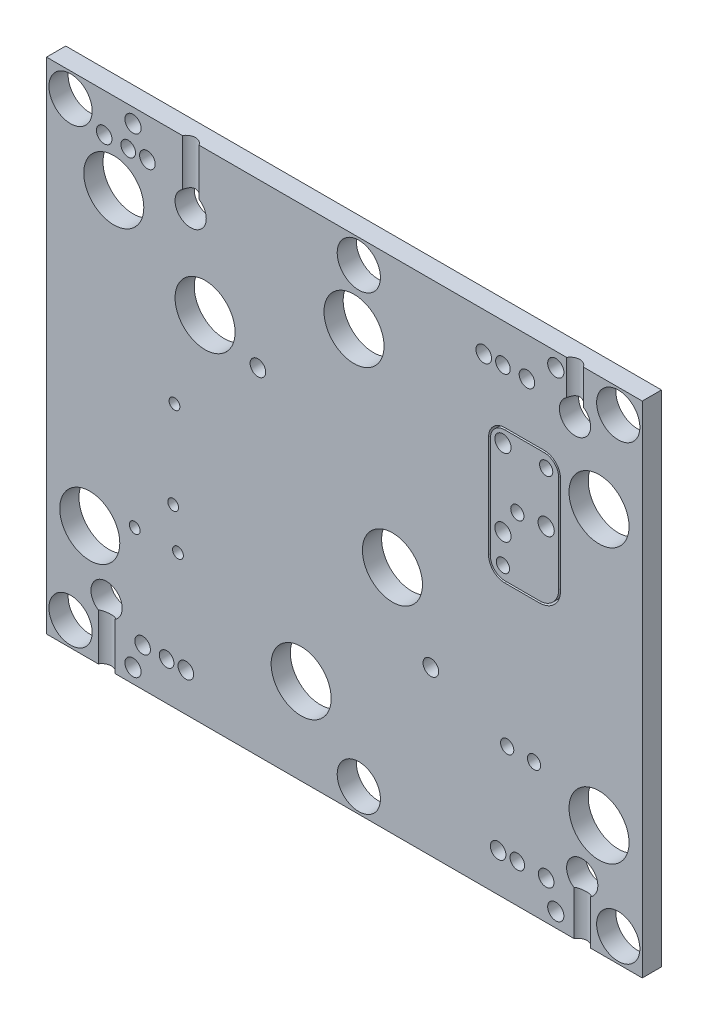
ISO-10303-21;
HEADER;
FILE_DESCRIPTION(('STEP AP214'),'2;1');
FILE_NAME('part.step','',(''),(''),'','','');
FILE_SCHEMA(('AUTOMOTIVE_DESIGN { 1 0 10303 214 1 1 1 1 }'));
ENDSEC;
DATA;
#1=APPLICATION_CONTEXT('core data for automotive mechanical design processes');
#2=APPLICATION_PROTOCOL_DEFINITION('international standard','automotive_design',2000,#1);
#3=PRODUCT_CONTEXT('',#1,'mechanical');
#4=PRODUCT('Part','Part','',(#3));
#5=PRODUCT_RELATED_PRODUCT_CATEGORY('part','',(#4));
#6=PRODUCT_DEFINITION_FORMATION('','',#4);
#7=PRODUCT_DEFINITION_CONTEXT('part definition',#1,'design');
#8=PRODUCT_DEFINITION('design','',#6,#7);
#9=PRODUCT_DEFINITION_SHAPE('','',#8);
#10=(LENGTH_UNIT() NAMED_UNIT(*) SI_UNIT(.MILLI.,.METRE.));
#11=(NAMED_UNIT(*) PLANE_ANGLE_UNIT() SI_UNIT($,.RADIAN.));
#12=(NAMED_UNIT(*) SI_UNIT($,.STERADIAN.) SOLID_ANGLE_UNIT());
#13=UNCERTAINTY_MEASURE_WITH_UNIT(LENGTH_MEASURE(1.E-05),#10,'distance_accuracy_value','');
#14=(GEOMETRIC_REPRESENTATION_CONTEXT(3) GLOBAL_UNCERTAINTY_ASSIGNED_CONTEXT((#13)) GLOBAL_UNIT_ASSIGNED_CONTEXT((#10,
#11,#12)) REPRESENTATION_CONTEXT('',''));
#15=CARTESIAN_POINT('',(0.,0.,0.));
#16=DIRECTION('',(0.,0.,1.));
#17=DIRECTION('',(1.,0.,0.));
#18=AXIS2_PLACEMENT_3D('',#15,#16,#17);
#19=CARTESIAN_POINT('',(-147.955,77.8002,12.7));
#20=DIRECTION('',(0.,0.,-1.));
#21=DIRECTION('',(-1.,0.,0.));
#22=AXIS2_PLACEMENT_3D('',#19,#20,#21);
#23=CYLINDRICAL_SURFACE('',#22,9.52499999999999);
#24=CARTESIAN_POINT('',(-147.955,77.8002,0.));
#25=DIRECTION('',(0.,0.,-1.));
#26=DIRECTION('',(-1.,0.,0.));
#27=AXIS2_PLACEMENT_3D('',#24,#25,#26);
#28=CIRCLE('',#27,9.52499999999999);
#29=CARTESIAN_POINT('',(-157.48,77.8002,0.));
#30=VERTEX_POINT('',#29);
#31=CARTESIAN_POINT('',(-147.955,87.3252,0.));
#32=VERTEX_POINT('',#31);
#33=EDGE_CURVE('E165',#30,#32,#28,.T.);
#34=ORIENTED_EDGE('',*,*,#33,.F.);
#35=DIRECTION('',(0.,0.,-1.));
#36=VECTOR('',#35,1.);
#37=CARTESIAN_POINT('',(-157.48,77.8002,12.7));
#38=LINE('',#37,#36);
#39=CARTESIAN_POINT('',(-157.48,77.8002,12.7));
#40=VERTEX_POINT('',#39);
#41=EDGE_CURVE('E12',#40,#30,#38,.T.);
#42=ORIENTED_EDGE('',*,*,#41,.F.);
#43=CARTESIAN_POINT('',(-147.955,77.8002,12.7));
#44=DIRECTION('',(0.,0.,-1.));
#45=DIRECTION('',(-1.,0.,0.));
#46=AXIS2_PLACEMENT_3D('',#43,#44,#45);
#47=CIRCLE('',#46,9.52499999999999);
#48=CARTESIAN_POINT('',(-147.955,87.3252,12.7));
#49=VERTEX_POINT('',#48);
#50=EDGE_CURVE('E194',#40,#49,#47,.T.);
#51=ORIENTED_EDGE('',*,*,#50,.T.);
#52=DIRECTION('',(0.,0.,-1.));
#53=VECTOR('',#52,1.);
#54=CARTESIAN_POINT('',(-147.955,87.3252,12.7));
#55=LINE('',#54,#53);
#56=EDGE_CURVE('E64',#49,#32,#55,.T.);
#57=ORIENTED_EDGE('',*,*,#56,.T.);
#58=EDGE_LOOP('',(#34,#42,#51,#57));
#59=FACE_BOUND('',#58,.T.);
#60=ADVANCED_FACE('F61',(#59),#23,.T.);
#61=CARTESIAN_POINT('',(-157.48,10.4902,12.7));
#62=DIRECTION('',(-1.,0.,0.));
#63=DIRECTION('',(0.,-1.,0.));
#64=AXIS2_PLACEMENT_3D('',#61,#62,#63);
#65=PLANE('',#64);
#66=DIRECTION('',(0.,1.,0.));
#67=VECTOR('',#66,1.);
#68=CARTESIAN_POINT('',(-157.48,10.4902,0.));
#69=LINE('',#68,#67);
#70=CARTESIAN_POINT('',(-157.48,10.4902,0.));
#71=VERTEX_POINT('',#70);
#72=EDGE_CURVE('E191',#71,#30,#69,.T.);
#73=ORIENTED_EDGE('',*,*,#72,.F.);
#74=DIRECTION('',(0.,0.,-1.));
#75=VECTOR('',#74,1.);
#76=CARTESIAN_POINT('',(-157.48,10.4902,12.7));
#77=LINE('',#76,#75);
#78=CARTESIAN_POINT('',(-157.48,10.4902,12.7));
#79=VERTEX_POINT('',#78);
#80=EDGE_CURVE('E71',#79,#71,#77,.T.);
#81=ORIENTED_EDGE('',*,*,#80,.F.);
#82=DIRECTION('',(0.,1.,0.));
#83=VECTOR('',#82,1.);
#84=CARTESIAN_POINT('',(-157.48,10.4902,12.7));
#85=LINE('',#84,#83);
#86=EDGE_CURVE('E150',#79,#40,#85,.T.);
#87=ORIENTED_EDGE('',*,*,#86,.T.);
#88=ORIENTED_EDGE('',*,*,#41,.T.);
#89=EDGE_LOOP('',(#73,#81,#87,#88));
#90=FACE_BOUND('',#89,.T.);
#91=ADVANCED_FACE('F215',(#90),#65,.T.);
#92=CARTESIAN_POINT('',(-147.955,10.4902,12.7));
#93=DIRECTION('',(0.,0.,-1.));
#94=DIRECTION('',(-1.,0.,0.));
#95=AXIS2_PLACEMENT_3D('',#92,#93,#94);
#96=CYLINDRICAL_SURFACE('',#95,9.52500000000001);
#97=CARTESIAN_POINT('',(-147.955,10.4902,0.));
#98=DIRECTION('',(0.,0.,-1.));
#99=DIRECTION('',(-1.,0.,0.));
#100=AXIS2_PLACEMENT_3D('',#97,#98,#99);
#101=CIRCLE('',#100,9.52500000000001);
#102=CARTESIAN_POINT('',(-147.955,0.965200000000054,0.));
#103=VERTEX_POINT('',#102);
#104=EDGE_CURVE('E136',#103,#71,#101,.T.);
#105=ORIENTED_EDGE('',*,*,#104,.F.);
#106=DIRECTION('',(0.,0.,-1.));
#107=VECTOR('',#106,1.);
#108=CARTESIAN_POINT('',(-147.955,0.965200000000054,12.7));
#109=LINE('',#108,#107);
#110=CARTESIAN_POINT('',(-147.955,0.965200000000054,12.7));
#111=VERTEX_POINT('',#110);
#112=EDGE_CURVE('E131',#111,#103,#109,.T.);
#113=ORIENTED_EDGE('',*,*,#112,.F.);
#114=CARTESIAN_POINT('',(-147.955,10.4902,12.7));
#115=DIRECTION('',(0.,0.,-1.));
#116=DIRECTION('',(-1.,0.,0.));
#117=AXIS2_PLACEMENT_3D('',#114,#115,#116);
#118=CIRCLE('',#117,9.52500000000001);
#119=EDGE_CURVE('E134',#111,#79,#118,.T.);
#120=ORIENTED_EDGE('',*,*,#119,.T.);
#121=ORIENTED_EDGE('',*,*,#80,.T.);
#122=EDGE_LOOP('',(#105,#113,#120,#121));
#123=FACE_BOUND('',#122,.T.);
#124=ADVANCED_FACE('F133',(#123),#96,.T.);
#125=CARTESIAN_POINT('',(-125.095,0.965200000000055,12.7));
#126=DIRECTION('',(0.,-1.,0.));
#127=DIRECTION('',(1.,0.,0.));
#128=AXIS2_PLACEMENT_3D('',#125,#126,#127);
#129=PLANE('',#128);
#130=DIRECTION('',(-1.,0.,0.));
#131=VECTOR('',#130,1.);
#132=CARTESIAN_POINT('',(-125.095,0.965200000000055,0.));
#133=LINE('',#132,#131);
#134=CARTESIAN_POINT('',(-125.095,0.965200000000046,0.));
#135=VERTEX_POINT('',#134);
#136=EDGE_CURVE('E186',#135,#103,#133,.T.);
#137=ORIENTED_EDGE('',*,*,#136,.F.);
#138=DIRECTION('',(0.,0.,-1.));
#139=VECTOR('',#138,1.);
#140=CARTESIAN_POINT('',(-125.095,0.965200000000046,12.7));
#141=LINE('',#140,#139);
#142=CARTESIAN_POINT('',(-125.095,0.965200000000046,12.7));
#143=VERTEX_POINT('',#142);
#144=EDGE_CURVE('E142',#143,#135,#141,.T.);
#145=ORIENTED_EDGE('',*,*,#144,.F.);
#146=DIRECTION('',(-1.,0.,0.));
#147=VECTOR('',#146,1.);
#148=CARTESIAN_POINT('',(-125.095,0.965200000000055,12.7));
#149=LINE('',#148,#147);
#150=EDGE_CURVE('E148',#143,#111,#149,.T.);
#151=ORIENTED_EDGE('',*,*,#150,.T.);
#152=ORIENTED_EDGE('',*,*,#112,.T.);
#153=EDGE_LOOP('',(#137,#145,#151,#152));
#154=FACE_BOUND('',#153,.T.);
#155=ADVANCED_FACE('F153',(#154),#129,.T.);
#156=CARTESIAN_POINT('',(-125.095,13.6652,12.7));
#157=DIRECTION('',(0.,0.,-1.));
#158=DIRECTION('',(-1.,0.,0.));
#159=AXIS2_PLACEMENT_3D('',#156,#157,#158);
#160=CYLINDRICAL_SURFACE('',#159,12.7);
#161=CARTESIAN_POINT('',(-125.095,13.6652,0.));
#162=DIRECTION('',(0.,0.,-1.));
#163=DIRECTION('',(-1.,0.,0.));
#164=AXIS2_PLACEMENT_3D('',#161,#162,#163);
#165=CIRCLE('',#164,12.7);
#166=CARTESIAN_POINT('',(-112.395,13.6652,0.));
#167=VERTEX_POINT('',#166);
#168=EDGE_CURVE('E182',#167,#135,#165,.T.);
#169=ORIENTED_EDGE('',*,*,#168,.F.);
#170=DIRECTION('',(0.,0.,-1.));
#171=VECTOR('',#170,1.);
#172=CARTESIAN_POINT('',(-112.395,13.6652,12.7));
#173=LINE('',#172,#171);
#174=CARTESIAN_POINT('',(-112.395,13.6652,12.7));
#175=VERTEX_POINT('',#174);
#176=EDGE_CURVE('E200',#175,#167,#173,.T.);
#177=ORIENTED_EDGE('',*,*,#176,.F.);
#178=CARTESIAN_POINT('',(-125.095,13.6652,12.7));
#179=DIRECTION('',(0.,0.,-1.));
#180=DIRECTION('',(-1.,0.,0.));
#181=AXIS2_PLACEMENT_3D('',#178,#179,#180);
#182=CIRCLE('',#181,12.7);
#183=EDGE_CURVE('E155',#175,#143,#182,.T.);
#184=ORIENTED_EDGE('',*,*,#183,.T.);
#185=ORIENTED_EDGE('',*,*,#144,.T.);
#186=EDGE_LOOP('',(#169,#177,#184,#185));
#187=FACE_BOUND('',#186,.T.);
#188=ADVANCED_FACE('F228',(#187),#160,.T.);
#189=CARTESIAN_POINT('',(-112.395,77.8002,12.7));
#190=DIRECTION('',(1.,0.,0.));
#191=DIRECTION('',(0.,1.,0.));
#192=AXIS2_PLACEMENT_3D('',#189,#190,#191);
#193=PLANE('',#192);
#194=DIRECTION('',(0.,-1.,0.));
#195=VECTOR('',#194,1.);
#196=CARTESIAN_POINT('',(-112.395,77.8002,0.));
#197=LINE('',#196,#195);
#198=CARTESIAN_POINT('',(-112.395,77.8002,0.));
#199=VERTEX_POINT('',#198);
#200=EDGE_CURVE('E178',#199,#167,#197,.T.);
#201=ORIENTED_EDGE('',*,*,#200,.F.);
#202=DIRECTION('',(0.,0.,-1.));
#203=VECTOR('',#202,1.);
#204=CARTESIAN_POINT('',(-112.395,77.8002,12.7));
#205=LINE('',#204,#203);
#206=CARTESIAN_POINT('',(-112.395,77.8002,12.7));
#207=VERTEX_POINT('',#206);
#208=EDGE_CURVE('E203',#207,#199,#205,.T.);
#209=ORIENTED_EDGE('',*,*,#208,.F.);
#210=DIRECTION('',(0.,-1.,0.));
#211=VECTOR('',#210,1.);
#212=CARTESIAN_POINT('',(-112.395,77.8002,12.7));
#213=LINE('',#212,#211);
#214=EDGE_CURVE('E159',#207,#175,#213,.T.);
#215=ORIENTED_EDGE('',*,*,#214,.T.);
#216=ORIENTED_EDGE('',*,*,#176,.T.);
#217=EDGE_LOOP('',(#201,#209,#215,#216));
#218=FACE_BOUND('',#217,.T.);
#219=ADVANCED_FACE('F231',(#218),#193,.T.);
#220=CARTESIAN_POINT('',(-121.92,77.8002,12.7));
#221=DIRECTION('',(0.,0.,-1.));
#222=DIRECTION('',(-1.,0.,0.));
#223=AXIS2_PLACEMENT_3D('',#220,#221,#222);
#224=CYLINDRICAL_SURFACE('',#223,9.525);
#225=CARTESIAN_POINT('',(-121.92,77.8002,0.));
#226=DIRECTION('',(0.,0.,-1.));
#227=DIRECTION('',(-1.,0.,0.));
#228=AXIS2_PLACEMENT_3D('',#225,#226,#227);
#229=CIRCLE('',#228,9.525);
#230=CARTESIAN_POINT('',(-121.92,87.3252,0.));
#231=VERTEX_POINT('',#230);
#232=EDGE_CURVE('E174',#231,#199,#229,.T.);
#233=ORIENTED_EDGE('',*,*,#232,.F.);
#234=DIRECTION('',(0.,0.,-1.));
#235=VECTOR('',#234,1.);
#236=CARTESIAN_POINT('',(-121.92,87.3252,12.7));
#237=LINE('',#236,#235);
#238=CARTESIAN_POINT('',(-121.92,87.3252,12.7));
#239=VERTEX_POINT('',#238);
#240=EDGE_CURVE('E205',#239,#231,#237,.T.);
#241=ORIENTED_EDGE('',*,*,#240,.F.);
#242=CARTESIAN_POINT('',(-121.92,77.8002,12.7));
#243=DIRECTION('',(0.,0.,-1.));
#244=DIRECTION('',(-1.,0.,0.));
#245=AXIS2_PLACEMENT_3D('',#242,#243,#244);
#246=CIRCLE('',#245,9.525);
#247=EDGE_CURVE('E379',#239,#207,#246,.T.);
#248=ORIENTED_EDGE('',*,*,#247,.T.);
#249=ORIENTED_EDGE('',*,*,#208,.T.);
#250=EDGE_LOOP('',(#233,#241,#248,#249));
#251=FACE_BOUND('',#250,.T.);
#252=ADVANCED_FACE('F235',(#251),#224,.T.);
#253=CARTESIAN_POINT('',(-147.955,87.3252,12.7));
#254=DIRECTION('',(0.,1.,0.));
#255=DIRECTION('',(-1.,0.,0.));
#256=AXIS2_PLACEMENT_3D('',#253,#254,#255);
#257=PLANE('',#256);
#258=DIRECTION('',(1.,0.,0.));
#259=VECTOR('',#258,1.);
#260=CARTESIAN_POINT('',(-147.955,87.3252,0.));
#261=LINE('',#260,#259);
#262=EDGE_CURVE('E169',#32,#231,#261,.T.);
#263=ORIENTED_EDGE('',*,*,#262,.F.);
#264=ORIENTED_EDGE('',*,*,#56,.F.);
#265=DIRECTION('',(1.,0.,0.));
#266=VECTOR('',#265,1.);
#267=CARTESIAN_POINT('',(-147.955,87.3252,12.7));
#268=LINE('',#267,#266);
#269=EDGE_CURVE('E376',#49,#239,#268,.T.);
#270=ORIENTED_EDGE('',*,*,#269,.T.);
#271=ORIENTED_EDGE('',*,*,#240,.T.);
#272=EDGE_LOOP('',(#263,#264,#270,#271));
#273=FACE_BOUND('',#272,.T.);
#274=ADVANCED_FACE('F212',(#273),#257,.T.);
#275=CARTESIAN_POINT('',(-147.955,77.8002,12.7));
#276=DIRECTION('',(0.,0.,-1.));
#277=DIRECTION('',(-1.,0.,0.));
#278=AXIS2_PLACEMENT_3D('',#275,#276,#277);
#279=PLANE('',#278);
#280=CARTESIAN_POINT('',(-120.65,79.0702,12.7));
#281=DIRECTION('',(0.,0.,-1.));
#282=DIRECTION('',(-1.,0.,0.));
#283=AXIS2_PLACEMENT_3D('',#280,#281,#282);
#284=CIRCLE('',#283,4.36879999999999);
#285=CARTESIAN_POINT('',(-125.0188,79.0702,12.7));
#286=VERTEX_POINT('',#285);
#287=EDGE_CURVE('E302',#286,#286,#284,.T.);
#288=ORIENTED_EDGE('',*,*,#287,.T.);
#289=EDGE_LOOP('',(#288));
#290=FACE_BOUND('',#289,.T.);
#291=CARTESIAN_POINT('',(-139.7,44.1452000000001,12.7));
#292=DIRECTION('',(0.,0.,-1.));
#293=DIRECTION('',(-1.,0.,0.));
#294=AXIS2_PLACEMENT_3D('',#291,#292,#293);
#295=CIRCLE('',#294,4.36880000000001);
#296=CARTESIAN_POINT('',(-144.0688,44.1452000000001,12.7));
#297=VERTEX_POINT('',#296);
#298=EDGE_CURVE('E306',#297,#297,#295,.T.);
#299=ORIENTED_EDGE('',*,*,#298,.T.);
#300=EDGE_LOOP('',(#299));
#301=FACE_BOUND('',#300,.T.);
#302=CARTESIAN_POINT('',(-149.225,9.22020000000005,12.7));
#303=DIRECTION('',(0.,0.,-1.));
#304=DIRECTION('',(-1.,0.,0.));
#305=AXIS2_PLACEMENT_3D('',#302,#303,#304);
#306=CIRCLE('',#305,4.36880000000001);
#307=CARTESIAN_POINT('',(-153.5938,9.22020000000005,12.7));
#308=VERTEX_POINT('',#307);
#309=EDGE_CURVE('E319',#308,#308,#306,.T.);
#310=ORIENTED_EDGE('',*,*,#309,.T.);
#311=EDGE_LOOP('',(#310));
#312=FACE_BOUND('',#311,.T.);
#313=CARTESIAN_POINT('',(-149.225,28.2702,12.7));
#314=DIRECTION('',(0.,0.,1.));
#315=DIRECTION('',(1.,0.,0.));
#316=AXIS2_PLACEMENT_3D('',#313,#314,#315);
#317=CIRCLE('',#316,5.35939999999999);
#318=CARTESIAN_POINT('',(-143.8656,28.2702,12.7));
#319=VERTEX_POINT('',#318);
#320=EDGE_CURVE('E339',#319,#319,#317,.T.);
#321=ORIENTED_EDGE('',*,*,#320,.F.);
#322=EDGE_LOOP('',(#321));
#323=FACE_BOUND('',#322,.T.);
#324=CARTESIAN_POINT('',(-120.65,45.7327,12.7));
#325=DIRECTION('',(0.,0.,1.));
#326=DIRECTION('',(1.,0.,0.));
#327=AXIS2_PLACEMENT_3D('',#324,#325,#326);
#328=CIRCLE('',#327,5.3594);
#329=CARTESIAN_POINT('',(-115.2906,45.7327,12.7));
#330=VERTEX_POINT('',#329);
#331=EDGE_CURVE('E355',#330,#330,#328,.T.);
#332=ORIENTED_EDGE('',*,*,#331,.F.);
#333=EDGE_LOOP('',(#332));
#334=FACE_BOUND('',#333,.T.);
#335=CARTESIAN_POINT('',(-149.225,79.0702,12.7));
#336=DIRECTION('',(0.,0.,1.));
#337=DIRECTION('',(1.,0.,0.));
#338=AXIS2_PLACEMENT_3D('',#335,#336,#337);
#339=CIRCLE('',#338,5.35939999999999);
#340=CARTESIAN_POINT('',(-143.8656,79.0702,12.7));
#341=VERTEX_POINT('',#340);
#342=EDGE_CURVE('E170',#341,#341,#339,.T.);
#343=ORIENTED_EDGE('',*,*,#342,.F.);
#344=EDGE_LOOP('',(#343));
#345=FACE_BOUND('',#344,.T.);
#346=ORIENTED_EDGE('',*,*,#50,.F.);
#347=ORIENTED_EDGE('',*,*,#86,.F.);
#348=ORIENTED_EDGE('',*,*,#119,.F.);
#349=ORIENTED_EDGE('',*,*,#150,.F.);
#350=ORIENTED_EDGE('',*,*,#183,.F.);
#351=ORIENTED_EDGE('',*,*,#214,.F.);
#352=ORIENTED_EDGE('',*,*,#247,.F.);
#353=ORIENTED_EDGE('',*,*,#269,.F.);
#354=EDGE_LOOP('',(#346,#347,#348,#349,#350,#351,#352,#353));
#355=FACE_BOUND('',#354,.T.);
#356=ADVANCED_FACE('F146',(#290,#301,#312,#323,#334,#345,#355),#279,.F.);
#357=CARTESIAN_POINT('',(-147.955,77.8002,0.));
#358=DIRECTION('',(0.,0.,-1.));
#359=DIRECTION('',(-1.,0.,0.));
#360=AXIS2_PLACEMENT_3D('',#357,#358,#359);
#361=PLANE('',#360);
#362=CARTESIAN_POINT('',(-120.65,79.0702,0.));
#363=DIRECTION('',(0.,0.,-1.));
#364=DIRECTION('',(-1.,0.,0.));
#365=AXIS2_PLACEMENT_3D('',#362,#363,#364);
#366=CIRCLE('',#365,4.36880000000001);
#367=CARTESIAN_POINT('',(-125.0188,79.0702,0.));
#368=VERTEX_POINT('',#367);
#369=EDGE_CURVE('E305',#368,#368,#366,.T.);
#370=ORIENTED_EDGE('',*,*,#369,.F.);
#371=EDGE_LOOP('',(#370));
#372=FACE_BOUND('',#371,.T.);
#373=CARTESIAN_POINT('',(-139.7,44.1452000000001,0.));
#374=DIRECTION('',(0.,0.,-1.));
#375=DIRECTION('',(-1.,0.,0.));
#376=AXIS2_PLACEMENT_3D('',#373,#374,#375);
#377=CIRCLE('',#376,4.36880000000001);
#378=CARTESIAN_POINT('',(-144.0688,44.1452000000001,0.));
#379=VERTEX_POINT('',#378);
#380=EDGE_CURVE('E311',#379,#379,#377,.T.);
#381=ORIENTED_EDGE('',*,*,#380,.F.);
#382=EDGE_LOOP('',(#381));
#383=FACE_BOUND('',#382,.T.);
#384=CARTESIAN_POINT('',(-149.225,9.22020000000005,0.));
#385=DIRECTION('',(0.,0.,-1.));
#386=DIRECTION('',(-1.,0.,0.));
#387=AXIS2_PLACEMENT_3D('',#384,#385,#386);
#388=CIRCLE('',#387,4.36880000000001);
#389=CARTESIAN_POINT('',(-153.5938,9.22020000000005,0.));
#390=VERTEX_POINT('',#389);
#391=EDGE_CURVE('E323',#390,#390,#388,.T.);
#392=ORIENTED_EDGE('',*,*,#391,.F.);
#393=EDGE_LOOP('',(#392));
#394=FACE_BOUND('',#393,.T.);
#395=CARTESIAN_POINT('',(-149.225,28.2702,0.));
#396=DIRECTION('',(0.,0.,1.));
#397=DIRECTION('',(1.,0.,0.));
#398=AXIS2_PLACEMENT_3D('',#395,#396,#397);
#399=CIRCLE('',#398,3.56870000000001);
#400=CARTESIAN_POINT('',(-145.6563,28.2702,0.));
#401=VERTEX_POINT('',#400);
#402=EDGE_CURVE('E327',#401,#401,#399,.T.);
#403=ORIENTED_EDGE('',*,*,#402,.T.);
#404=EDGE_LOOP('',(#403));
#405=FACE_BOUND('',#404,.T.);
#406=CARTESIAN_POINT('',(-120.65,45.7327,0.));
#407=DIRECTION('',(0.,0.,1.));
#408=DIRECTION('',(1.,0.,0.));
#409=AXIS2_PLACEMENT_3D('',#406,#407,#408);
#410=CIRCLE('',#409,3.56869999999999);
#411=CARTESIAN_POINT('',(-117.0813,45.7327,0.));
#412=VERTEX_POINT('',#411);
#413=EDGE_CURVE('E343',#412,#412,#410,.T.);
#414=ORIENTED_EDGE('',*,*,#413,.T.);
#415=EDGE_LOOP('',(#414));
#416=FACE_BOUND('',#415,.T.);
#417=CARTESIAN_POINT('',(-149.225,79.0702,0.));
#418=DIRECTION('',(0.,0.,1.));
#419=DIRECTION('',(1.,0.,0.));
#420=AXIS2_PLACEMENT_3D('',#417,#418,#419);
#421=CIRCLE('',#420,3.56870000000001);
#422=CARTESIAN_POINT('',(-145.6563,79.0702,0.));
#423=VERTEX_POINT('',#422);
#424=EDGE_CURVE('E359',#423,#423,#421,.T.);
#425=ORIENTED_EDGE('',*,*,#424,.T.);
#426=EDGE_LOOP('',(#425));
#427=FACE_BOUND('',#426,.T.);
#428=ORIENTED_EDGE('',*,*,#33,.T.);
#429=ORIENTED_EDGE('',*,*,#262,.T.);
#430=ORIENTED_EDGE('',*,*,#232,.T.);
#431=ORIENTED_EDGE('',*,*,#200,.T.);
#432=ORIENTED_EDGE('',*,*,#168,.T.);
#433=ORIENTED_EDGE('',*,*,#136,.T.);
#434=ORIENTED_EDGE('',*,*,#104,.T.);
#435=ORIENTED_EDGE('',*,*,#72,.T.);
#436=EDGE_LOOP('',(#428,#429,#430,#431,#432,#433,#434,#435));
#437=FACE_BOUND('',#436,.T.);
#438=ADVANCED_FACE('F214',(#372,#383,#394,#405,#416,#427,#437),#361,.T.);
#439=CARTESIAN_POINT('',(-149.225,79.0702,12.7));
#440=DIRECTION('',(0.,0.,1.));
#441=DIRECTION('',(1.,0.,0.));
#442=AXIS2_PLACEMENT_3D('',#439,#440,#441);
#443=CYLINDRICAL_SURFACE('',#442,5.35939999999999);
#444=CARTESIAN_POINT('',(-149.225,79.0702,4.82600000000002));
#445=DIRECTION('',(0.,0.,1.));
#446=DIRECTION('',(1.,0.,0.));
#447=AXIS2_PLACEMENT_3D('',#444,#445,#446);
#448=CIRCLE('',#447,5.35939999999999);
#449=CARTESIAN_POINT('',(-143.8656,79.0702,4.82600000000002));
#450=VERTEX_POINT('',#449);
#451=EDGE_CURVE('E367',#450,#450,#448,.T.);
#452=ORIENTED_EDGE('',*,*,#451,.F.);
#453=EDGE_LOOP('',(#452));
#454=FACE_BOUND('',#453,.T.);
#455=ORIENTED_EDGE('',*,*,#342,.T.);
#456=EDGE_LOOP('',(#455));
#457=FACE_BOUND('',#456,.T.);
#458=ADVANCED_FACE('F247',(#454,#457),#443,.F.);
#459=CARTESIAN_POINT('',(-145.6563,79.0702,4.82600000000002));
#460=DIRECTION('',(0.,0.,-1.));
#461=DIRECTION('',(-1.,0.,0.));
#462=AXIS2_PLACEMENT_3D('',#459,#460,#461);
#463=PLANE('',#462);
#464=CARTESIAN_POINT('',(-149.225,79.0702,4.82600000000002));
#465=DIRECTION('',(0.,0.,1.));
#466=DIRECTION('',(1.,0.,0.));
#467=AXIS2_PLACEMENT_3D('',#464,#465,#466);
#468=CIRCLE('',#467,3.56870000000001);
#469=CARTESIAN_POINT('',(-145.6563,79.0702,4.82600000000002));
#470=VERTEX_POINT('',#469);
#471=EDGE_CURVE('E363',#470,#470,#468,.T.);
#472=ORIENTED_EDGE('',*,*,#471,.F.);
#473=EDGE_LOOP('',(#472));
#474=FACE_BOUND('',#473,.T.);
#475=ORIENTED_EDGE('',*,*,#451,.T.);
#476=EDGE_LOOP('',(#475));
#477=FACE_BOUND('',#476,.T.);
#478=ADVANCED_FACE('F254',(#474,#477),#463,.F.);
#479=CARTESIAN_POINT('',(-149.225,79.0702,12.7));
#480=DIRECTION('',(0.,0.,1.));
#481=DIRECTION('',(1.,0.,0.));
#482=AXIS2_PLACEMENT_3D('',#479,#480,#481);
#483=CYLINDRICAL_SURFACE('',#482,3.56870000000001);
#484=ORIENTED_EDGE('',*,*,#424,.F.);
#485=EDGE_LOOP('',(#484));
#486=FACE_BOUND('',#485,.T.);
#487=ORIENTED_EDGE('',*,*,#471,.T.);
#488=EDGE_LOOP('',(#487));
#489=FACE_BOUND('',#488,.T.);
#490=ADVANCED_FACE('F258',(#486,#489),#483,.F.);
#491=CARTESIAN_POINT('',(-120.65,45.7327,12.7));
#492=DIRECTION('',(0.,0.,1.));
#493=DIRECTION('',(1.,0.,0.));
#494=AXIS2_PLACEMENT_3D('',#491,#492,#493);
#495=CYLINDRICAL_SURFACE('',#494,5.3594);
#496=CARTESIAN_POINT('',(-120.65,45.7327,4.82600000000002));
#497=DIRECTION('',(0.,0.,1.));
#498=DIRECTION('',(1.,0.,0.));
#499=AXIS2_PLACEMENT_3D('',#496,#497,#498);
#500=CIRCLE('',#499,5.3594);
#501=CARTESIAN_POINT('',(-115.2906,45.7327,4.82600000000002));
#502=VERTEX_POINT('',#501);
#503=EDGE_CURVE('E351',#502,#502,#500,.T.);
#504=ORIENTED_EDGE('',*,*,#503,.F.);
#505=EDGE_LOOP('',(#504));
#506=FACE_BOUND('',#505,.T.);
#507=ORIENTED_EDGE('',*,*,#331,.T.);
#508=EDGE_LOOP('',(#507));
#509=FACE_BOUND('',#508,.T.);
#510=ADVANCED_FACE('F262',(#506,#509),#495,.F.);
#511=CARTESIAN_POINT('',(-117.0813,45.7327,4.82600000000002));
#512=DIRECTION('',(0.,0.,-1.));
#513=DIRECTION('',(-1.,0.,0.));
#514=AXIS2_PLACEMENT_3D('',#511,#512,#513);
#515=PLANE('',#514);
#516=CARTESIAN_POINT('',(-120.65,45.7327,4.82600000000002));
#517=DIRECTION('',(0.,0.,1.));
#518=DIRECTION('',(1.,0.,0.));
#519=AXIS2_PLACEMENT_3D('',#516,#517,#518);
#520=CIRCLE('',#519,3.56869999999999);
#521=CARTESIAN_POINT('',(-117.0813,45.7327,4.82600000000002));
#522=VERTEX_POINT('',#521);
#523=EDGE_CURVE('E347',#522,#522,#520,.T.);
#524=ORIENTED_EDGE('',*,*,#523,.F.);
#525=EDGE_LOOP('',(#524));
#526=FACE_BOUND('',#525,.T.);
#527=ORIENTED_EDGE('',*,*,#503,.T.);
#528=EDGE_LOOP('',(#527));
#529=FACE_BOUND('',#528,.T.);
#530=ADVANCED_FACE('F266',(#526,#529),#515,.F.);
#531=CARTESIAN_POINT('',(-120.65,45.7327,12.7));
#532=DIRECTION('',(0.,0.,1.));
#533=DIRECTION('',(1.,0.,0.));
#534=AXIS2_PLACEMENT_3D('',#531,#532,#533);
#535=CYLINDRICAL_SURFACE('',#534,3.56869999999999);
#536=ORIENTED_EDGE('',*,*,#413,.F.);
#537=EDGE_LOOP('',(#536));
#538=FACE_BOUND('',#537,.T.);
#539=ORIENTED_EDGE('',*,*,#523,.T.);
#540=EDGE_LOOP('',(#539));
#541=FACE_BOUND('',#540,.T.);
#542=ADVANCED_FACE('F270',(#538,#541),#535,.F.);
#543=CARTESIAN_POINT('',(-149.225,28.2702,12.7));
#544=DIRECTION('',(0.,0.,1.));
#545=DIRECTION('',(1.,0.,0.));
#546=AXIS2_PLACEMENT_3D('',#543,#544,#545);
#547=CYLINDRICAL_SURFACE('',#546,5.35939999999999);
#548=CARTESIAN_POINT('',(-149.225,28.2702,4.82600000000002));
#549=DIRECTION('',(0.,0.,1.));
#550=DIRECTION('',(1.,0.,0.));
#551=AXIS2_PLACEMENT_3D('',#548,#549,#550);
#552=CIRCLE('',#551,5.35939999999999);
#553=CARTESIAN_POINT('',(-143.8656,28.2702,4.82600000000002));
#554=VERTEX_POINT('',#553);
#555=EDGE_CURVE('E335',#554,#554,#552,.T.);
#556=ORIENTED_EDGE('',*,*,#555,.F.);
#557=EDGE_LOOP('',(#556));
#558=FACE_BOUND('',#557,.T.);
#559=ORIENTED_EDGE('',*,*,#320,.T.);
#560=EDGE_LOOP('',(#559));
#561=FACE_BOUND('',#560,.T.);
#562=ADVANCED_FACE('F274',(#558,#561),#547,.F.);
#563=CARTESIAN_POINT('',(-145.6563,28.2702,4.82600000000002));
#564=DIRECTION('',(0.,0.,-1.));
#565=DIRECTION('',(-1.,0.,0.));
#566=AXIS2_PLACEMENT_3D('',#563,#564,#565);
#567=PLANE('',#566);
#568=CARTESIAN_POINT('',(-149.225,28.2702,4.82600000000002));
#569=DIRECTION('',(0.,0.,1.));
#570=DIRECTION('',(1.,0.,0.));
#571=AXIS2_PLACEMENT_3D('',#568,#569,#570);
#572=CIRCLE('',#571,3.56870000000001);
#573=CARTESIAN_POINT('',(-145.6563,28.2702,4.82600000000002));
#574=VERTEX_POINT('',#573);
#575=EDGE_CURVE('E331',#574,#574,#572,.T.);
#576=ORIENTED_EDGE('',*,*,#575,.F.);
#577=EDGE_LOOP('',(#576));
#578=FACE_BOUND('',#577,.T.);
#579=ORIENTED_EDGE('',*,*,#555,.T.);
#580=EDGE_LOOP('',(#579));
#581=FACE_BOUND('',#580,.T.);
#582=ADVANCED_FACE('F278',(#578,#581),#567,.F.);
#583=CARTESIAN_POINT('',(-149.225,28.2702,12.7));
#584=DIRECTION('',(0.,0.,1.));
#585=DIRECTION('',(1.,0.,0.));
#586=AXIS2_PLACEMENT_3D('',#583,#584,#585);
#587=CYLINDRICAL_SURFACE('',#586,3.56870000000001);
#588=ORIENTED_EDGE('',*,*,#402,.F.);
#589=EDGE_LOOP('',(#588));
#590=FACE_BOUND('',#589,.T.);
#591=ORIENTED_EDGE('',*,*,#575,.T.);
#592=EDGE_LOOP('',(#591));
#593=FACE_BOUND('',#592,.T.);
#594=ADVANCED_FACE('F282',(#590,#593),#587,.F.);
#595=CARTESIAN_POINT('',(-149.225,9.22020000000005,0.));
#596=DIRECTION('',(0.,0.,-1.));
#597=DIRECTION('',(-1.,0.,0.));
#598=AXIS2_PLACEMENT_3D('',#595,#596,#597);
#599=CYLINDRICAL_SURFACE('',#598,4.36880000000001);
#600=ORIENTED_EDGE('',*,*,#309,.F.);
#601=EDGE_LOOP('',(#600));
#602=FACE_BOUND('',#601,.T.);
#603=ORIENTED_EDGE('',*,*,#391,.T.);
#604=EDGE_LOOP('',(#603));
#605=FACE_BOUND('',#604,.T.);
#606=ADVANCED_FACE('F286',(#602,#605),#599,.F.);
#607=CARTESIAN_POINT('',(-139.7,44.1452000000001,0.));
#608=DIRECTION('',(0.,0.,-1.));
#609=DIRECTION('',(-1.,0.,0.));
#610=AXIS2_PLACEMENT_3D('',#607,#608,#609);
#611=CYLINDRICAL_SURFACE('',#610,4.36880000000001);
#612=ORIENTED_EDGE('',*,*,#298,.F.);
#613=EDGE_LOOP('',(#612));
#614=FACE_BOUND('',#613,.T.);
#615=ORIENTED_EDGE('',*,*,#380,.T.);
#616=EDGE_LOOP('',(#615));
#617=FACE_BOUND('',#616,.T.);
#618=ADVANCED_FACE('F290',(#614,#617),#611,.F.);
#619=CARTESIAN_POINT('',(-120.65,79.0702,0.));
#620=DIRECTION('',(0.,0.,-1.));
#621=DIRECTION('',(-1.,0.,0.));
#622=AXIS2_PLACEMENT_3D('',#619,#620,#621);
#623=CYLINDRICAL_SURFACE('',#622,4.3688);
#624=ORIENTED_EDGE('',*,*,#287,.F.);
#625=EDGE_LOOP('',(#624));
#626=FACE_BOUND('',#625,.T.);
#627=ORIENTED_EDGE('',*,*,#369,.T.);
#628=EDGE_LOOP('',(#627));
#629=FACE_BOUND('',#628,.T.);
#630=ADVANCED_FACE('F294',(#626,#629),#623,.F.);
#631=CLOSED_SHELL('',(#60,#91,#124,#155,#188,#219,#252,#274,#356,#438,#458,#478,#490,#510,#530,
#542,#562,#582,#594,#606,#618,#630));
#632=MANIFOLD_SOLID_BREP('B2',#631);
#633=CARTESIAN_POINT('',(-57.15,-180.975,12.7));
#634=DIRECTION('',(-1.,0.,0.));
#635=DIRECTION('',(0.,-1.,0.));
#636=AXIS2_PLACEMENT_3D('',#633,#634,#635);
#637=PLANE('',#636);
#638=DIRECTION('',(0.,1.,0.));
#639=VECTOR('',#638,1.);
#640=CARTESIAN_POINT('',(-57.15,-180.975,0.));
#641=LINE('',#640,#639);
#642=CARTESIAN_POINT('',(-57.15,-180.975,0.));
#643=VERTEX_POINT('',#642);
#644=CARTESIAN_POINT('',(-57.15,149.225,0.));
#645=VERTEX_POINT('',#644);
#646=EDGE_CURVE('E825',#643,#645,#641,.T.);
#647=ORIENTED_EDGE('',*,*,#646,.T.);
#648=DIRECTION('',(0.,0.,-1.));
#649=VECTOR('',#648,1.);
#650=CARTESIAN_POINT('',(-57.15,149.225,12.7));
#651=LINE('',#650,#649);
#652=CARTESIAN_POINT('',(-57.15,149.225,12.7));
#653=VERTEX_POINT('',#652);
#654=EDGE_CURVE('E59',#653,#645,#651,.T.);
#655=ORIENTED_EDGE('',*,*,#654,.F.);
#656=DIRECTION('',(0.,1.,0.));
#657=VECTOR('',#656,1.);
#658=CARTESIAN_POINT('',(-57.15,-180.975,12.7));
#659=LINE('',#658,#657);
#660=CARTESIAN_POINT('',(-57.15,-180.975,12.7));
#661=VERTEX_POINT('',#660);
#662=EDGE_CURVE('E773',#661,#653,#659,.T.);
#663=ORIENTED_EDGE('',*,*,#662,.F.);
#664=DIRECTION('',(0.,0.,-1.));
#665=VECTOR('',#664,1.);
#666=CARTESIAN_POINT('',(-57.15,-180.975,12.7));
#667=LINE('',#666,#665);
#668=EDGE_CURVE('E1530',#661,#643,#667,.T.);
#669=ORIENTED_EDGE('',*,*,#668,.T.);
#670=EDGE_LOOP('',(#647,#655,#663,#669));
#671=FACE_BOUND('',#670,.T.);
#672=ADVANCED_FACE('F613',(#671),#637,.F.);
#673=CARTESIAN_POINT('',(-57.15,149.225,12.7));
#674=DIRECTION('',(0.,-1.,0.));
#675=DIRECTION('',(1.,0.,0.));
#676=AXIS2_PLACEMENT_3D('',#673,#674,#675);
#677=PLANE('',#676);
#678=DIRECTION('',(-1.,0.,0.));
#679=VECTOR('',#678,1.);
#680=CARTESIAN_POINT('',(-57.15,149.225,12.7));
#681=LINE('',#680,#679);
#682=CARTESIAN_POINT('',(-107.099261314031,149.225,12.7));
#683=VERTEX_POINT('',#682);
#684=CARTESIAN_POINT('',(-350.100738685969,149.225,12.7));
#685=VERTEX_POINT('',#684);
#686=EDGE_CURVE('E766',#683,#685,#681,.T.);
#687=ORIENTED_EDGE('',*,*,#686,.F.);
#688=CARTESIAN_POINT('',(-101.6,149.225,15.875));
#689=DIRECTION('',(0.,1.,0.));
#690=DIRECTION('',(-1.,0.,0.));
#691=AXIS2_PLACEMENT_3D('',#688,#689,#690);
#692=CIRCLE('',#691,6.35);
#693=CARTESIAN_POINT('',(-96.1007386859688,149.225,12.7));
#694=VERTEX_POINT('',#693);
#695=EDGE_CURVE('E751',#694,#683,#692,.T.);
#696=ORIENTED_EDGE('',*,*,#695,.F.);
#697=EDGE_CURVE('E762',#653,#694,#681,.T.);
#698=ORIENTED_EDGE('',*,*,#697,.F.);
#699=ORIENTED_EDGE('',*,*,#654,.T.);
#700=DIRECTION('',(-1.,0.,0.));
#701=VECTOR('',#700,1.);
#702=CARTESIAN_POINT('',(-57.15,149.225,0.));
#703=LINE('',#702,#701);
#704=CARTESIAN_POINT('',(-450.85,149.225,0.));
#705=VERTEX_POINT('',#704);
#706=EDGE_CURVE('E1534',#645,#705,#703,.T.);
#707=ORIENTED_EDGE('',*,*,#706,.T.);
#708=DIRECTION('',(0.,0.,-1.));
#709=VECTOR('',#708,1.);
#710=CARTESIAN_POINT('',(-450.85,149.225,12.7));
#711=LINE('',#710,#709);
#712=CARTESIAN_POINT('',(-450.85,149.225,12.7));
#713=VERTEX_POINT('',#712);
#714=EDGE_CURVE('E621',#713,#705,#711,.T.);
#715=ORIENTED_EDGE('',*,*,#714,.F.);
#716=CARTESIAN_POINT('',(-361.099261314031,149.225,12.7));
#717=VERTEX_POINT('',#716);
#718=EDGE_CURVE('E778',#717,#713,#681,.T.);
#719=ORIENTED_EDGE('',*,*,#718,.F.);
#720=CARTESIAN_POINT('',(-355.6,149.225,15.875));
#721=DIRECTION('',(0.,1.,0.));
#722=DIRECTION('',(-1.,0.,0.));
#723=AXIS2_PLACEMENT_3D('',#720,#721,#722);
#724=CIRCLE('',#723,6.35);
#725=EDGE_CURVE('E768',#685,#717,#724,.T.);
#726=ORIENTED_EDGE('',*,*,#725,.F.);
#727=EDGE_LOOP('',(#687,#696,#698,#699,#707,#715,#719,#726));
#728=FACE_BOUND('',#727,.T.);
#729=ADVANCED_FACE('F761',(#728),#677,.F.);
#730=CARTESIAN_POINT('',(-450.85,149.225,12.7));
#731=DIRECTION('',(1.,0.,0.));
#732=DIRECTION('',(0.,1.,0.));
#733=AXIS2_PLACEMENT_3D('',#730,#731,#732);
#734=PLANE('',#733);
#735=DIRECTION('',(0.,-1.,0.));
#736=VECTOR('',#735,1.);
#737=CARTESIAN_POINT('',(-450.85,149.225,0.));
#738=LINE('',#737,#736);
#739=CARTESIAN_POINT('',(-450.85,-180.975,0.));
#740=VERTEX_POINT('',#739);
#741=EDGE_CURVE('E796',#705,#740,#738,.T.);
#742=ORIENTED_EDGE('',*,*,#741,.T.);
#743=DIRECTION('',(0.,0.,-1.));
#744=VECTOR('',#743,1.);
#745=CARTESIAN_POINT('',(-450.85,-180.975,12.7));
#746=LINE('',#745,#744);
#747=CARTESIAN_POINT('',(-450.85,-180.975,12.7));
#748=VERTEX_POINT('',#747);
#749=EDGE_CURVE('E1544',#748,#740,#746,.T.);
#750=ORIENTED_EDGE('',*,*,#749,.F.);
#751=DIRECTION('',(0.,-1.,0.));
#752=VECTOR('',#751,1.);
#753=CARTESIAN_POINT('',(-450.85,149.225,12.7));
#754=LINE('',#753,#752);
#755=EDGE_CURVE('E776',#713,#748,#754,.T.);
#756=ORIENTED_EDGE('',*,*,#755,.F.);
#757=ORIENTED_EDGE('',*,*,#714,.T.);
#758=EDGE_LOOP('',(#742,#750,#756,#757));
#759=FACE_BOUND('',#758,.T.);
#760=ADVANCED_FACE('F1514',(#759),#734,.F.);
#761=CARTESIAN_POINT('',(-450.85,-180.975,12.7));
#762=DIRECTION('',(0.,1.,0.));
#763=DIRECTION('',(-1.,0.,0.));
#764=AXIS2_PLACEMENT_3D('',#761,#762,#763);
#765=PLANE('',#764);
#766=DIRECTION('',(1.,0.,0.));
#767=VECTOR('',#766,1.);
#768=CARTESIAN_POINT('',(-450.85,-180.975,12.7));
#769=LINE('',#768,#767);
#770=CARTESIAN_POINT('',(-405.663238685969,-180.975,12.7));
#771=VERTEX_POINT('',#770);
#772=CARTESIAN_POINT('',(-102.336761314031,-180.975,12.7));
#773=VERTEX_POINT('',#772);
#774=EDGE_CURVE('E1560',#771,#773,#769,.T.);
#775=ORIENTED_EDGE('',*,*,#774,.F.);
#776=CARTESIAN_POINT('',(-411.1625,-180.975,15.875));
#777=DIRECTION('',(0.,-1.,0.));
#778=DIRECTION('',(1.,0.,0.));
#779=AXIS2_PLACEMENT_3D('',#776,#777,#778);
#780=CIRCLE('',#779,6.35);
#781=CARTESIAN_POINT('',(-416.661761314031,-180.975,12.7));
#782=VERTEX_POINT('',#781);
#783=EDGE_CURVE('E1557',#782,#771,#780,.T.);
#784=ORIENTED_EDGE('',*,*,#783,.F.);
#785=EDGE_CURVE('E1540',#748,#782,#769,.T.);
#786=ORIENTED_EDGE('',*,*,#785,.F.);
#787=ORIENTED_EDGE('',*,*,#749,.T.);
#788=DIRECTION('',(1.,0.,0.));
#789=VECTOR('',#788,1.);
#790=CARTESIAN_POINT('',(-450.85,-180.975,0.));
#791=LINE('',#790,#789);
#792=EDGE_CURVE('E792',#740,#643,#791,.T.);
#793=ORIENTED_EDGE('',*,*,#792,.T.);
#794=ORIENTED_EDGE('',*,*,#668,.F.);
#795=CARTESIAN_POINT('',(-91.3382386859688,-180.975,12.7));
#796=VERTEX_POINT('',#795);
#797=EDGE_CURVE('E783',#796,#661,#769,.T.);
#798=ORIENTED_EDGE('',*,*,#797,.F.);
#799=CARTESIAN_POINT('',(-96.8374999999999,-180.975,15.875));
#800=DIRECTION('',(0.,-1.,0.));
#801=DIRECTION('',(1.,0.,0.));
#802=AXIS2_PLACEMENT_3D('',#799,#800,#801);
#803=CIRCLE('',#802,6.35);
#804=EDGE_CURVE('E1266',#773,#796,#803,.T.);
#805=ORIENTED_EDGE('',*,*,#804,.F.);
#806=EDGE_LOOP('',(#775,#784,#786,#787,#793,#794,#798,#805));
#807=FACE_BOUND('',#806,.T.);
#808=ADVANCED_FACE('F1508',(#807),#765,.F.);
#809=CARTESIAN_POINT('',(0.,0.,12.7));
#810=DIRECTION('',(0.,0.,1.));
#811=DIRECTION('',(1.,0.,0.));
#812=AXIS2_PLACEMENT_3D('',#809,#810,#811);
#813=PLANE('',#812);
#814=DIRECTION('',(0.,1.,0.));
#815=VECTOR('',#814,1.);
#816=CARTESIAN_POINT('',(-96.1007386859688,-180.976,12.7));
#817=LINE('',#816,#815);
#818=CARTESIAN_POINT('',(-96.1007386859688,126.20625,12.7));
#819=VERTEX_POINT('',#818);
#820=EDGE_CURVE('E748',#694,#819,#817,.F.);
#821=ORIENTED_EDGE('',*,*,#820,.T.);
#822=CARTESIAN_POINT('',(-101.6,117.475,12.7));
#823=DIRECTION('',(0.,0.,-1.));
#824=DIRECTION('',(-1.,0.,0.));
#825=AXIS2_PLACEMENT_3D('',#822,#823,#824);
#826=CIRCLE('',#825,10.31875);
#827=CARTESIAN_POINT('',(-107.099261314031,126.20625,12.7));
#828=VERTEX_POINT('',#827);
#829=EDGE_CURVE('E1220',#819,#828,#826,.T.);
#830=ORIENTED_EDGE('',*,*,#829,.T.);
#831=DIRECTION('',(0.,1.,0.));
#832=VECTOR('',#831,1.);
#833=CARTESIAN_POINT('',(-107.099261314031,-180.976,12.7));
#834=LINE('',#833,#832);
#835=EDGE_CURVE('E636',#828,#683,#834,.T.);
#836=ORIENTED_EDGE('',*,*,#835,.T.);
#837=ORIENTED_EDGE('',*,*,#686,.T.);
#838=DIRECTION('',(0.,1.,0.));
#839=VECTOR('',#838,1.);
#840=CARTESIAN_POINT('',(-350.100738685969,-180.976,12.7));
#841=LINE('',#840,#839);
#842=CARTESIAN_POINT('',(-350.100738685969,118.26875,12.7));
#843=VERTEX_POINT('',#842);
#844=EDGE_CURVE('E1633',#685,#843,#841,.F.);
#845=ORIENTED_EDGE('',*,*,#844,.T.);
#846=CARTESIAN_POINT('',(-355.6,109.5375,12.7));
#847=DIRECTION('',(0.,0.,-1.));
#848=DIRECTION('',(-1.,0.,0.));
#849=AXIS2_PLACEMENT_3D('',#846,#847,#848);
#850=CIRCLE('',#849,10.31875);
#851=CARTESIAN_POINT('',(-361.099261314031,118.26875,12.7));
#852=VERTEX_POINT('',#851);
#853=EDGE_CURVE('E1196',#843,#852,#850,.T.);
#854=ORIENTED_EDGE('',*,*,#853,.T.);
#855=DIRECTION('',(0.,1.,0.));
#856=VECTOR('',#855,1.);
#857=CARTESIAN_POINT('',(-361.099261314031,-180.976,12.7));
#858=LINE('',#857,#856);
#859=EDGE_CURVE('E628',#852,#717,#858,.T.);
#860=ORIENTED_EDGE('',*,*,#859,.T.);
#861=ORIENTED_EDGE('',*,*,#718,.T.);
#862=ORIENTED_EDGE('',*,*,#755,.T.);
#863=ORIENTED_EDGE('',*,*,#785,.T.);
#864=DIRECTION('',(0.,-1.,0.));
#865=VECTOR('',#864,1.);
#866=CARTESIAN_POINT('',(-416.661761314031,149.226,12.7));
#867=LINE('',#866,#865);
#868=CARTESIAN_POINT('',(-416.661761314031,-150.01875,12.7));
#869=VERTEX_POINT('',#868);
#870=EDGE_CURVE('E1579',#782,#869,#867,.F.);
#871=ORIENTED_EDGE('',*,*,#870,.T.);
#872=CARTESIAN_POINT('',(-411.1625,-141.2875,12.7));
#873=DIRECTION('',(0.,0.,-1.));
#874=DIRECTION('',(-1.,0.,0.));
#875=AXIS2_PLACEMENT_3D('',#872,#873,#874);
#876=CIRCLE('',#875,10.31875);
#877=CARTESIAN_POINT('',(-405.663238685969,-150.01875,12.7));
#878=VERTEX_POINT('',#877);
#879=EDGE_CURVE('E1204',#869,#878,#876,.T.);
#880=ORIENTED_EDGE('',*,*,#879,.T.);
#881=DIRECTION('',(0.,-1.,0.));
#882=VECTOR('',#881,1.);
#883=CARTESIAN_POINT('',(-405.663238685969,149.226,12.7));
#884=LINE('',#883,#882);
#885=EDGE_CURVE('E1574',#878,#771,#884,.T.);
#886=ORIENTED_EDGE('',*,*,#885,.T.);
#887=ORIENTED_EDGE('',*,*,#774,.T.);
#888=DIRECTION('',(0.,-1.,0.));
#889=VECTOR('',#888,1.);
#890=CARTESIAN_POINT('',(-102.336761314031,149.226,12.7));
#891=LINE('',#890,#889);
#892=CARTESIAN_POINT('',(-102.336761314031,-151.60625,12.7));
#893=VERTEX_POINT('',#892);
#894=EDGE_CURVE('E1570',#773,#893,#891,.F.);
#895=ORIENTED_EDGE('',*,*,#894,.T.);
#896=CARTESIAN_POINT('',(-96.8375,-142.875,12.7));
#897=DIRECTION('',(0.,0.,-1.));
#898=DIRECTION('',(-1.,0.,0.));
#899=AXIS2_PLACEMENT_3D('',#896,#897,#898);
#900=CIRCLE('',#899,10.31875);
#901=CARTESIAN_POINT('',(-91.3382386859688,-151.60625,12.7));
#902=VERTEX_POINT('',#901);
#903=EDGE_CURVE('E1212',#893,#902,#900,.T.);
#904=ORIENTED_EDGE('',*,*,#903,.T.);
#905=DIRECTION('',(0.,-1.,0.));
#906=VECTOR('',#905,1.);
#907=CARTESIAN_POINT('',(-91.3382386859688,149.226,12.7));
#908=LINE('',#907,#906);
#909=EDGE_CURVE('E1265',#902,#796,#908,.T.);
#910=ORIENTED_EDGE('',*,*,#909,.T.);
#911=ORIENTED_EDGE('',*,*,#797,.T.);
#912=ORIENTED_EDGE('',*,*,#662,.T.);
#913=ORIENTED_EDGE('',*,*,#697,.T.);
#914=EDGE_LOOP('',(#821,#830,#836,#837,#845,#854,#860,#861,#862,#863,#871,#880,#886,#887,#895,
#904,#910,#911,#912,#913));
#915=FACE_BOUND('',#914,.T.);
#916=CARTESIAN_POINT('',(-384.175,123.825,12.7));
#917=DIRECTION('',(0.,0.,-1.));
#918=DIRECTION('',(-1.,0.,0.));
#919=AXIS2_PLACEMENT_3D('',#916,#917,#918);
#920=CIRCLE('',#919,5.15937500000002);
#921=CARTESIAN_POINT('',(-389.334375,123.825,12.7));
#922=VERTEX_POINT('',#921);
#923=EDGE_CURVE('E1251',#922,#922,#920,.T.);
#924=ORIENTED_EDGE('',*,*,#923,.T.);
#925=EDGE_LOOP('',(#924));
#926=FACE_BOUND('',#925,.T.);
#927=CARTESIAN_POINT('',(-358.775,-155.575,12.7));
#928=DIRECTION('',(0.,0.,-1.));
#929=DIRECTION('',(-1.,0.,0.));
#930=AXIS2_PLACEMENT_3D('',#927,#928,#929);
#931=CIRCLE('',#930,5.15937500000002);
#932=CARTESIAN_POINT('',(-363.934375,-155.575,12.7));
#933=VERTEX_POINT('',#932);
#934=EDGE_CURVE('E1243',#933,#933,#931,.T.);
#935=ORIENTED_EDGE('',*,*,#934,.T.);
#936=EDGE_LOOP('',(#935));
#937=FACE_BOUND('',#936,.T.);
#938=CARTESIAN_POINT('',(-152.4,-155.575,12.7));
#939=DIRECTION('',(0.,0.,-1.));
#940=DIRECTION('',(-1.,0.,0.));
#941=AXIS2_PLACEMENT_3D('',#938,#939,#940);
#942=CIRCLE('',#941,5.15937499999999);
#943=CARTESIAN_POINT('',(-157.559375,-155.575,12.7));
#944=VERTEX_POINT('',#943);
#945=EDGE_CURVE('E1235',#944,#944,#942,.T.);
#946=ORIENTED_EDGE('',*,*,#945,.T.);
#947=EDGE_LOOP('',(#946));
#948=FACE_BOUND('',#947,.T.);
#949=CARTESIAN_POINT('',(-161.925,123.825,12.7));
#950=DIRECTION('',(0.,0.,-1.));
#951=DIRECTION('',(-1.,0.,0.));
#952=AXIS2_PLACEMENT_3D('',#949,#950,#951);
#953=CIRCLE('',#952,5.15937499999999);
#954=CARTESIAN_POINT('',(-167.084375,123.825,12.7));
#955=VERTEX_POINT('',#954);
#956=EDGE_CURVE('E1227',#955,#955,#953,.T.);
#957=ORIENTED_EDGE('',*,*,#956,.T.);
#958=EDGE_LOOP('',(#957));
#959=FACE_BOUND('',#958,.T.);
#960=CARTESIAN_POINT('',(-393.7,139.7,12.7));
#961=DIRECTION('',(0.,0.,1.));
#962=DIRECTION('',(1.,0.,0.));
#963=AXIS2_PLACEMENT_3D('',#960,#961,#962);
#964=CIRCLE('',#963,5.35940000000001);
#965=CARTESIAN_POINT('',(-388.3406,139.7,12.7));
#966=VERTEX_POINT('',#965);
#967=EDGE_CURVE('E1176',#966,#966,#964,.T.);
#968=ORIENTED_EDGE('',*,*,#967,.F.);
#969=EDGE_LOOP('',(#968));
#970=FACE_BOUND('',#969,.T.);
#971=CARTESIAN_POINT('',(-393.7,-171.45,12.7));
#972=DIRECTION('',(0.,0.,1.));
#973=DIRECTION('',(1.,0.,0.));
#974=AXIS2_PLACEMENT_3D('',#971,#972,#973);
#975=CIRCLE('',#974,5.35940000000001);
#976=CARTESIAN_POINT('',(-388.3406,-171.45,12.7));
#977=VERTEX_POINT('',#976);
#978=EDGE_CURVE('E1160',#977,#977,#975,.T.);
#979=ORIENTED_EDGE('',*,*,#978,.F.);
#980=EDGE_LOOP('',(#979));
#981=FACE_BOUND('',#980,.T.);
#982=CARTESIAN_POINT('',(-114.3,-171.45,12.7));
#983=DIRECTION('',(0.,0.,1.));
#984=DIRECTION('',(1.,0.,0.));
#985=AXIS2_PLACEMENT_3D('',#982,#983,#984);
#986=CIRCLE('',#985,5.3594);
#987=CARTESIAN_POINT('',(-108.9406,-171.45,12.7));
#988=VERTEX_POINT('',#987);
#989=EDGE_CURVE('E1144',#988,#988,#986,.T.);
#990=ORIENTED_EDGE('',*,*,#989,.F.);
#991=EDGE_LOOP('',(#990));
#992=FACE_BOUND('',#991,.T.);
#993=CARTESIAN_POINT('',(-114.3,139.7,12.7));
#994=DIRECTION('',(0.,0.,1.));
#995=DIRECTION('',(1.,0.,0.));
#996=AXIS2_PLACEMENT_3D('',#993,#994,#995);
#997=CIRCLE('',#996,5.3594);
#998=CARTESIAN_POINT('',(-108.9406,139.7,12.7));
#999=VERTEX_POINT('',#998);
#1000=EDGE_CURVE('E1128',#999,#999,#997,.T.);
#1001=ORIENTED_EDGE('',*,*,#1000,.F.);
#1002=EDGE_LOOP('',(#1001));
#1003=FACE_BOUND('',#1002,.T.);
#1004=CARTESIAN_POINT('',(-366.288311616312,-6.94581526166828,12.7));
#1005=DIRECTION('',(0.,0.,-1.));
#1006=DIRECTION('',(-1.,0.,0.));
#1007=AXIS2_PLACEMENT_3D('',#1004,#1005,#1006);
#1008=CIRCLE('',#1007,3.56869999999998);
#1009=CARTESIAN_POINT('',(-369.857011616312,-6.94581526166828,12.7));
#1010=VERTEX_POINT('',#1009);
#1011=EDGE_CURVE('E1124',#1010,#1010,#1008,.T.);
#1012=ORIENTED_EDGE('',*,*,#1011,.T.);
#1013=EDGE_LOOP('',(#1012));
#1014=FACE_BOUND('',#1013,.T.);
#1015=CARTESIAN_POINT('',(-367.157,-65.0875,12.7));
#1016=DIRECTION('',(0.,0.,-1.));
#1017=DIRECTION('',(-1.,0.,0.));
#1018=AXIS2_PLACEMENT_3D('',#1015,#1016,#1017);
#1019=CIRCLE('',#1018,3.56869999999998);
#1020=CARTESIAN_POINT('',(-370.7257,-65.0875,12.7));
#1021=VERTEX_POINT('',#1020);
#1022=EDGE_CURVE('E1116',#1021,#1021,#1019,.T.);
#1023=ORIENTED_EDGE('',*,*,#1022,.T.);
#1024=EDGE_LOOP('',(#1023));
#1025=FACE_BOUND('',#1024,.T.);
#1026=CARTESIAN_POINT('',(-392.557,-90.9320000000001,12.7));
#1027=DIRECTION('',(0.,0.,-1.));
#1028=DIRECTION('',(-1.,0.,0.));
#1029=AXIS2_PLACEMENT_3D('',#1026,#1027,#1028);
#1030=CIRCLE('',#1029,3.56869999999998);
#1031=CARTESIAN_POINT('',(-396.1257,-90.9320000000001,12.7));
#1032=VERTEX_POINT('',#1031);
#1033=EDGE_CURVE('E1108',#1032,#1032,#1030,.T.);
#1034=ORIENTED_EDGE('',*,*,#1033,.T.);
#1035=EDGE_LOOP('',(#1034));
#1036=FACE_BOUND('',#1035,.T.);
#1037=CARTESIAN_POINT('',(-363.982,-90.9320000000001,12.7));
#1038=DIRECTION('',(0.,0.,-1.));
#1039=DIRECTION('',(-1.,0.,0.));
#1040=AXIS2_PLACEMENT_3D('',#1037,#1038,#1039);
#1041=CIRCLE('',#1040,3.56869999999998);
#1042=CARTESIAN_POINT('',(-367.5507,-90.9320000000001,12.7));
#1043=VERTEX_POINT('',#1042);
#1044=EDGE_CURVE('E1100',#1043,#1043,#1041,.T.);
#1045=ORIENTED_EDGE('',*,*,#1044,.T.);
#1046=EDGE_LOOP('',(#1045));
#1047=FACE_BOUND('',#1046,.T.);
#1048=CARTESIAN_POINT('',(-146.431,-93.091,12.7));
#1049=DIRECTION('',(0.,0.,-1.));
#1050=DIRECTION('',(-1.,0.,0.));
#1051=AXIS2_PLACEMENT_3D('',#1048,#1049,#1050);
#1052=CIRCLE('',#1051,4.36880000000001);
#1053=CARTESIAN_POINT('',(-150.7998,-93.091,12.7));
#1054=VERTEX_POINT('',#1053);
#1055=EDGE_CURVE('E1092',#1054,#1054,#1052,.T.);
#1056=ORIENTED_EDGE('',*,*,#1055,.T.);
#1057=EDGE_LOOP('',(#1056));
#1058=FACE_BOUND('',#1057,.T.);
#1059=CARTESIAN_POINT('',(-128.651,-93.091,12.7));
#1060=DIRECTION('',(0.,0.,-1.));
#1061=DIRECTION('',(-1.,0.,0.));
#1062=AXIS2_PLACEMENT_3D('',#1059,#1060,#1061);
#1063=CIRCLE('',#1062,4.36879999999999);
#1064=CARTESIAN_POINT('',(-133.0198,-93.091,12.7));
#1065=VERTEX_POINT('',#1064);
#1066=EDGE_CURVE('E1084',#1065,#1065,#1063,.T.);
#1067=ORIENTED_EDGE('',*,*,#1066,.T.);
#1068=EDGE_LOOP('',(#1067));
#1069=FACE_BOUND('',#1068,.T.);
#1070=CARTESIAN_POINT('',(-85.7249999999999,-107.95,12.7));
#1071=DIRECTION('',(0.,0.,1.));
#1072=DIRECTION('',(1.,0.,0.));
#1073=AXIS2_PLACEMENT_3D('',#1070,#1071,#1072);
#1074=CIRCLE('',#1073,19.84375);
#1075=CARTESIAN_POINT('',(-65.88125,-107.95,12.7));
#1076=VERTEX_POINT('',#1075);
#1077=EDGE_CURVE('E1072',#1076,#1076,#1074,.T.);
#1078=ORIENTED_EDGE('',*,*,#1077,.F.);
#1079=EDGE_LOOP('',(#1078));
#1080=FACE_BOUND('',#1079,.T.);
#1081=CARTESIAN_POINT('',(-85.725,73.0249999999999,12.7));
#1082=DIRECTION('',(0.,0.,1.));
#1083=DIRECTION('',(1.,0.,0.));
#1084=AXIS2_PLACEMENT_3D('',#1081,#1082,#1083);
#1085=CIRCLE('',#1084,19.84375);
#1086=CARTESIAN_POINT('',(-65.88125,73.0249999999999,12.7));
#1087=VERTEX_POINT('',#1086);
#1088=EDGE_CURVE('E1064',#1087,#1087,#1085,.T.);
#1089=ORIENTED_EDGE('',*,*,#1088,.F.);
#1090=EDGE_LOOP('',(#1089));
#1091=FACE_BOUND('',#1090,.T.);
#1092=CARTESIAN_POINT('',(-406.4,95.25,12.7));
#1093=DIRECTION('',(0.,0.,1.));
#1094=DIRECTION('',(1.,0.,0.));
#1095=AXIS2_PLACEMENT_3D('',#1092,#1093,#1094);
#1096=CIRCLE('',#1095,19.84375);
#1097=CARTESIAN_POINT('',(-386.55625,95.25,12.7));
#1098=VERTEX_POINT('',#1097);
#1099=EDGE_CURVE('E1056',#1098,#1098,#1096,.T.);
#1100=ORIENTED_EDGE('',*,*,#1099,.F.);
#1101=EDGE_LOOP('',(#1100));
#1102=FACE_BOUND('',#1101,.T.);
#1103=CARTESIAN_POINT('',(-422.275,-104.775,12.7));
#1104=DIRECTION('',(0.,0.,1.));
#1105=DIRECTION('',(1.,0.,0.));
#1106=AXIS2_PLACEMENT_3D('',#1103,#1104,#1105);
#1107=CIRCLE('',#1106,19.84375);
#1108=CARTESIAN_POINT('',(-402.43125,-104.775,12.7));
#1109=VERTEX_POINT('',#1108);
#1110=EDGE_CURVE('E1048',#1109,#1109,#1107,.T.);
#1111=ORIENTED_EDGE('',*,*,#1110,.F.);
#1112=EDGE_LOOP('',(#1111));
#1113=FACE_BOUND('',#1112,.T.);
#1114=CARTESIAN_POINT('',(-282.575,-123.825,12.7));
#1115=DIRECTION('',(0.,0.,1.));
#1116=DIRECTION('',(1.,0.,0.));
#1117=AXIS2_PLACEMENT_3D('',#1114,#1115,#1116);
#1118=CIRCLE('',#1117,19.84375);
#1119=CARTESIAN_POINT('',(-262.73125,-123.825,12.7));
#1120=VERTEX_POINT('',#1119);
#1121=EDGE_CURVE('E1040',#1120,#1120,#1118,.T.);
#1122=ORIENTED_EDGE('',*,*,#1121,.F.);
#1123=EDGE_LOOP('',(#1122));
#1124=FACE_BOUND('',#1123,.T.);
#1125=CARTESIAN_POINT('',(-247.65,95.25,12.7));
#1126=DIRECTION('',(0.,0.,1.));
#1127=DIRECTION('',(1.,0.,0.));
#1128=AXIS2_PLACEMENT_3D('',#1125,#1126,#1127);
#1129=CIRCLE('',#1128,19.84375);
#1130=CARTESIAN_POINT('',(-227.80625,95.25,12.7));
#1131=VERTEX_POINT('',#1130);
#1132=EDGE_CURVE('E1032',#1131,#1131,#1129,.T.);
#1133=ORIENTED_EDGE('',*,*,#1132,.F.);
#1134=EDGE_LOOP('',(#1133));
#1135=FACE_BOUND('',#1134,.T.);
#1136=CARTESIAN_POINT('',(-346.075,53.975,12.7));
#1137=DIRECTION('',(0.,0.,1.));
#1138=DIRECTION('',(1.,0.,0.));
#1139=AXIS2_PLACEMENT_3D('',#1136,#1137,#1138);
#1140=CIRCLE('',#1139,19.84375);
#1141=CARTESIAN_POINT('',(-326.23125,53.975,12.7));
#1142=VERTEX_POINT('',#1141);
#1143=EDGE_CURVE('E1024',#1142,#1142,#1140,.T.);
#1144=ORIENTED_EDGE('',*,*,#1143,.F.);
#1145=EDGE_LOOP('',(#1144));
#1146=FACE_BOUND('',#1145,.T.);
#1147=CARTESIAN_POINT('',(-222.25,-28.575,12.7));
#1148=DIRECTION('',(0.,0.,1.));
#1149=DIRECTION('',(1.,0.,0.));
#1150=AXIS2_PLACEMENT_3D('',#1147,#1148,#1149);
#1151=CIRCLE('',#1150,19.84375);
#1152=CARTESIAN_POINT('',(-202.40625,-28.575,12.7));
#1153=VERTEX_POINT('',#1152);
#1154=EDGE_CURVE('E1016',#1153,#1153,#1151,.T.);
#1155=ORIENTED_EDGE('',*,*,#1154,.F.);
#1156=EDGE_LOOP('',(#1155));
#1157=FACE_BOUND('',#1156,.T.);
#1158=CARTESIAN_POINT('',(-73.0249999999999,-165.1,12.7));
#1159=DIRECTION('',(0.,0.,-1.));
#1160=DIRECTION('',(-1.,0.,0.));
#1161=AXIS2_PLACEMENT_3D('',#1158,#1159,#1160);
#1162=CIRCLE('',#1161,14.2875);
#1163=CARTESIAN_POINT('',(-87.3124999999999,-165.1,12.7));
#1164=VERTEX_POINT('',#1163);
#1165=EDGE_CURVE('E1012',#1164,#1164,#1162,.T.);
#1166=ORIENTED_EDGE('',*,*,#1165,.T.);
#1167=EDGE_LOOP('',(#1166));
#1168=FACE_BOUND('',#1167,.T.);
#1169=CARTESIAN_POINT('',(-73.0249999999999,133.35,12.7));
#1170=DIRECTION('',(0.,0.,-1.));
#1171=DIRECTION('',(-1.,0.,0.));
#1172=AXIS2_PLACEMENT_3D('',#1169,#1170,#1171);
#1173=CIRCLE('',#1172,14.2875);
#1174=CARTESIAN_POINT('',(-87.3124999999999,133.35,12.7));
#1175=VERTEX_POINT('',#1174);
#1176=EDGE_CURVE('E1004',#1175,#1175,#1173,.T.);
#1177=ORIENTED_EDGE('',*,*,#1176,.T.);
#1178=EDGE_LOOP('',(#1177));
#1179=FACE_BOUND('',#1178,.T.);
#1180=CARTESIAN_POINT('',(-434.975,133.35,12.7));
#1181=DIRECTION('',(0.,0.,-1.));
#1182=DIRECTION('',(-1.,0.,0.));
#1183=AXIS2_PLACEMENT_3D('',#1180,#1181,#1182);
#1184=CIRCLE('',#1183,14.2875);
#1185=CARTESIAN_POINT('',(-449.2625,133.35,12.7));
#1186=VERTEX_POINT('',#1185);
#1187=EDGE_CURVE('E996',#1186,#1186,#1184,.T.);
#1188=ORIENTED_EDGE('',*,*,#1187,.T.);
#1189=EDGE_LOOP('',(#1188));
#1190=FACE_BOUND('',#1189,.T.);
#1191=CARTESIAN_POINT('',(-434.975,-165.1,12.7));
#1192=DIRECTION('',(0.,0.,-1.));
#1193=DIRECTION('',(-1.,0.,0.));
#1194=AXIS2_PLACEMENT_3D('',#1191,#1192,#1193);
#1195=CIRCLE('',#1194,14.2875);
#1196=CARTESIAN_POINT('',(-449.2625,-165.1,12.7));
#1197=VERTEX_POINT('',#1196);
#1198=EDGE_CURVE('E988',#1197,#1197,#1195,.T.);
#1199=ORIENTED_EDGE('',*,*,#1198,.T.);
#1200=EDGE_LOOP('',(#1199));
#1201=FACE_BOUND('',#1200,.T.);
#1202=CARTESIAN_POINT('',(-244.475,-165.1,12.7));
#1203=DIRECTION('',(0.,0.,-1.));
#1204=DIRECTION('',(-1.,0.,0.));
#1205=AXIS2_PLACEMENT_3D('',#1202,#1203,#1204);
#1206=CIRCLE('',#1205,14.2875);
#1207=CARTESIAN_POINT('',(-258.7625,-165.1,12.7));
#1208=VERTEX_POINT('',#1207);
#1209=EDGE_CURVE('E980',#1208,#1208,#1206,.T.);
#1210=ORIENTED_EDGE('',*,*,#1209,.T.);
#1211=EDGE_LOOP('',(#1210));
#1212=FACE_BOUND('',#1211,.T.);
#1213=CARTESIAN_POINT('',(-244.475,133.35,12.7));
#1214=DIRECTION('',(0.,0.,-1.));
#1215=DIRECTION('',(-1.,0.,0.));
#1216=AXIS2_PLACEMENT_3D('',#1213,#1214,#1215);
#1217=CIRCLE('',#1216,14.2875);
#1218=CARTESIAN_POINT('',(-258.7625,133.35,12.7));
#1219=VERTEX_POINT('',#1218);
#1220=EDGE_CURVE('E972',#1219,#1219,#1217,.T.);
#1221=ORIENTED_EDGE('',*,*,#1220,.T.);
#1222=EDGE_LOOP('',(#1221));
#1223=FACE_BOUND('',#1222,.T.);
#1224=CARTESIAN_POINT('',(-387.35,-155.575,12.7));
#1225=DIRECTION('',(0.,0.,-1.));
#1226=DIRECTION('',(-1.,0.,0.));
#1227=AXIS2_PLACEMENT_3D('',#1224,#1225,#1226);
#1228=CIRCLE('',#1227,5.1562);
#1229=CARTESIAN_POINT('',(-392.5062,-155.575,12.7));
#1230=VERTEX_POINT('',#1229);
#1231=EDGE_CURVE('E964',#1230,#1230,#1228,.T.);
#1232=ORIENTED_EDGE('',*,*,#1231,.T.);
#1233=EDGE_LOOP('',(#1232));
#1234=FACE_BOUND('',#1233,.T.);
#1235=CARTESIAN_POINT('',(-412.75,123.825,12.7));
#1236=DIRECTION('',(0.,0.,-1.));
#1237=DIRECTION('',(-1.,0.,0.));
#1238=AXIS2_PLACEMENT_3D('',#1235,#1236,#1237);
#1239=CIRCLE('',#1238,5.1562);
#1240=CARTESIAN_POINT('',(-417.9062,123.825,12.7));
#1241=VERTEX_POINT('',#1240);
#1242=EDGE_CURVE('E956',#1241,#1241,#1239,.T.);
#1243=ORIENTED_EDGE('',*,*,#1242,.T.);
#1244=EDGE_LOOP('',(#1243));
#1245=FACE_BOUND('',#1244,.T.);
#1246=CARTESIAN_POINT('',(-133.35,123.825,12.7));
#1247=DIRECTION('',(0.,0.,-1.));
#1248=DIRECTION('',(-1.,0.,0.));
#1249=AXIS2_PLACEMENT_3D('',#1246,#1247,#1248);
#1250=CIRCLE('',#1249,5.1562);
#1251=CARTESIAN_POINT('',(-138.5062,123.825,12.7));
#1252=VERTEX_POINT('',#1251);
#1253=EDGE_CURVE('E948',#1252,#1252,#1250,.T.);
#1254=ORIENTED_EDGE('',*,*,#1253,.T.);
#1255=EDGE_LOOP('',(#1254));
#1256=FACE_BOUND('',#1255,.T.);
#1257=CARTESIAN_POINT('',(-120.65,-155.575,12.7));
#1258=DIRECTION('',(0.,0.,-1.));
#1259=DIRECTION('',(-1.,0.,0.));
#1260=AXIS2_PLACEMENT_3D('',#1257,#1258,#1259);
#1261=CIRCLE('',#1260,5.1562);
#1262=CARTESIAN_POINT('',(-125.8062,-155.575,12.7));
#1263=VERTEX_POINT('',#1262);
#1264=EDGE_CURVE('E940',#1263,#1263,#1261,.T.);
#1265=ORIENTED_EDGE('',*,*,#1264,.T.);
#1266=EDGE_LOOP('',(#1265));
#1267=FACE_BOUND('',#1266,.T.);
#1268=CARTESIAN_POINT('',(-311.15,41.2750000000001,12.7));
#1269=DIRECTION('',(0.,0.,-1.));
#1270=DIRECTION('',(-1.,0.,0.));
#1271=AXIS2_PLACEMENT_3D('',#1268,#1269,#1270);
#1272=CIRCLE('',#1271,5.1562);
#1273=CARTESIAN_POINT('',(-316.3062,41.2750000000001,12.7));
#1274=VERTEX_POINT('',#1273);
#1275=EDGE_CURVE('E932',#1274,#1274,#1272,.T.);
#1276=ORIENTED_EDGE('',*,*,#1275,.T.);
#1277=EDGE_LOOP('',(#1276));
#1278=FACE_BOUND('',#1277,.T.);
#1279=CARTESIAN_POINT('',(-196.85,-73.025,12.7));
#1280=DIRECTION('',(0.,0.,-1.));
#1281=DIRECTION('',(-1.,0.,0.));
#1282=AXIS2_PLACEMENT_3D('',#1279,#1280,#1281);
#1283=CIRCLE('',#1282,5.1562);
#1284=CARTESIAN_POINT('',(-202.0062,-73.025,12.7));
#1285=VERTEX_POINT('',#1284);
#1286=EDGE_CURVE('E924',#1285,#1285,#1283,.T.);
#1287=ORIENTED_EDGE('',*,*,#1286,.T.);
#1288=EDGE_LOOP('',(#1287));
#1289=FACE_BOUND('',#1288,.T.);
#1290=CARTESIAN_POINT('',(-139.7,-155.575,12.7));
#1291=DIRECTION('',(0.,0.,-1.));
#1292=DIRECTION('',(-1.,0.,0.));
#1293=AXIS2_PLACEMENT_3D('',#1290,#1291,#1292);
#1294=CIRCLE('',#1293,4.826);
#1295=CARTESIAN_POINT('',(-144.526,-155.575,12.7));
#1296=VERTEX_POINT('',#1295);
#1297=EDGE_CURVE('E916',#1296,#1296,#1294,.T.);
#1298=ORIENTED_EDGE('',*,*,#1297,.T.);
#1299=EDGE_LOOP('',(#1298));
#1300=FACE_BOUND('',#1299,.T.);
#1301=CARTESIAN_POINT('',(-396.875,123.825,12.7));
#1302=DIRECTION('',(0.,0.,-1.));
#1303=DIRECTION('',(-1.,0.,0.));
#1304=AXIS2_PLACEMENT_3D('',#1301,#1302,#1303);
#1305=CIRCLE('',#1304,4.826);
#1306=CARTESIAN_POINT('',(-401.701,123.825,12.7));
#1307=VERTEX_POINT('',#1306);
#1308=EDGE_CURVE('E908',#1307,#1307,#1305,.T.);
#1309=ORIENTED_EDGE('',*,*,#1308,.T.);
#1310=EDGE_LOOP('',(#1309));
#1311=FACE_BOUND('',#1310,.T.);
#1312=CARTESIAN_POINT('',(-371.475,-155.575,12.7));
#1313=DIRECTION('',(0.,0.,-1.));
#1314=DIRECTION('',(-1.,0.,0.));
#1315=AXIS2_PLACEMENT_3D('',#1312,#1313,#1314);
#1316=CIRCLE('',#1315,4.826);
#1317=CARTESIAN_POINT('',(-376.301,-155.575,12.7));
#1318=VERTEX_POINT('',#1317);
#1319=EDGE_CURVE('E900',#1318,#1318,#1316,.T.);
#1320=ORIENTED_EDGE('',*,*,#1319,.T.);
#1321=EDGE_LOOP('',(#1320));
#1322=FACE_BOUND('',#1321,.T.);
#1323=CARTESIAN_POINT('',(-149.225,123.825,12.7));
#1324=DIRECTION('',(0.,0.,-1.));
#1325=DIRECTION('',(-1.,0.,0.));
#1326=AXIS2_PLACEMENT_3D('',#1323,#1324,#1325);
#1327=CIRCLE('',#1326,4.826);
#1328=CARTESIAN_POINT('',(-154.051,123.825,12.7));
#1329=VERTEX_POINT('',#1328);
#1330=EDGE_CURVE('E892',#1329,#1329,#1327,.T.);
#1331=ORIENTED_EDGE('',*,*,#1330,.T.);
#1332=EDGE_LOOP('',(#1331));
#1333=FACE_BOUND('',#1332,.T.);
#1334=CARTESIAN_POINT('',(-147.955,77.8002,12.7));
#1335=DIRECTION('',(0.,0.,-1.));
#1336=DIRECTION('',(-1.,0.,0.));
#1337=AXIS2_PLACEMENT_3D('',#1334,#1335,#1336);
#1338=CIRCLE('',#1337,10.795);
#1339=CARTESIAN_POINT('',(-158.75,77.8002,12.7));
#1340=VERTEX_POINT('',#1339);
#1341=CARTESIAN_POINT('',(-147.955,88.5952,12.7));
#1342=VERTEX_POINT('',#1341);
#1343=EDGE_CURVE('E830',#1340,#1342,#1338,.T.);
#1344=ORIENTED_EDGE('',*,*,#1343,.T.);
#1345=DIRECTION('',(1.,0.,0.));
#1346=VECTOR('',#1345,1.);
#1347=CARTESIAN_POINT('',(-147.955,88.5952,12.7));
#1348=LINE('',#1347,#1346);
#1349=CARTESIAN_POINT('',(-121.92,88.5952,12.7));
#1350=VERTEX_POINT('',#1349);
#1351=EDGE_CURVE('E882',#1342,#1350,#1348,.T.);
#1352=ORIENTED_EDGE('',*,*,#1351,.T.);
#1353=CARTESIAN_POINT('',(-121.92,77.8002,12.7));
#1354=DIRECTION('',(0.,0.,-1.));
#1355=DIRECTION('',(-1.,0.,0.));
#1356=AXIS2_PLACEMENT_3D('',#1353,#1354,#1355);
#1357=CIRCLE('',#1356,10.795);
#1358=CARTESIAN_POINT('',(-111.125,77.8002,12.7));
#1359=VERTEX_POINT('',#1358);
#1360=EDGE_CURVE('E878',#1350,#1359,#1357,.T.);
#1361=ORIENTED_EDGE('',*,*,#1360,.T.);
#1362=DIRECTION('',(0.,-1.,0.));
#1363=VECTOR('',#1362,1.);
#1364=CARTESIAN_POINT('',(-111.125,77.8002,12.7));
#1365=LINE('',#1364,#1363);
#1366=CARTESIAN_POINT('',(-111.125,13.6652,12.7));
#1367=VERTEX_POINT('',#1366);
#1368=EDGE_CURVE('E874',#1359,#1367,#1365,.T.);
#1369=ORIENTED_EDGE('',*,*,#1368,.T.);
#1370=CARTESIAN_POINT('',(-125.095,13.6652,12.7));
#1371=DIRECTION('',(0.,0.,-1.));
#1372=DIRECTION('',(-1.,0.,0.));
#1373=AXIS2_PLACEMENT_3D('',#1370,#1371,#1372);
#1374=CIRCLE('',#1373,13.97);
#1375=CARTESIAN_POINT('',(-125.095,-0.304799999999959,12.7));
#1376=VERTEX_POINT('',#1375);
#1377=EDGE_CURVE('E870',#1367,#1376,#1374,.T.);
#1378=ORIENTED_EDGE('',*,*,#1377,.T.);
#1379=DIRECTION('',(-1.,0.,0.));
#1380=VECTOR('',#1379,1.);
#1381=CARTESIAN_POINT('',(-125.095,-0.304799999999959,12.7));
#1382=LINE('',#1381,#1380);
#1383=CARTESIAN_POINT('',(-147.955,-0.304799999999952,12.7));
#1384=VERTEX_POINT('',#1383);
#1385=EDGE_CURVE('E866',#1376,#1384,#1382,.T.);
#1386=ORIENTED_EDGE('',*,*,#1385,.T.);
#1387=CARTESIAN_POINT('',(-147.955,10.4902,12.7));
#1388=DIRECTION('',(0.,0.,-1.));
#1389=DIRECTION('',(-1.,0.,0.));
#1390=AXIS2_PLACEMENT_3D('',#1387,#1388,#1389);
#1391=CIRCLE('',#1390,10.795);
#1392=CARTESIAN_POINT('',(-158.75,10.4902,12.7));
#1393=VERTEX_POINT('',#1392);
#1394=EDGE_CURVE('E862',#1384,#1393,#1391,.T.);
#1395=ORIENTED_EDGE('',*,*,#1394,.T.);
#1396=DIRECTION('',(0.,1.,0.));
#1397=VECTOR('',#1396,1.);
#1398=CARTESIAN_POINT('',(-158.75,10.4902,12.7));
#1399=LINE('',#1398,#1397);
#1400=EDGE_CURVE('E804',#1393,#1340,#1399,.T.);
#1401=ORIENTED_EDGE('',*,*,#1400,.T.);
#1402=EDGE_LOOP('',(#1344,#1352,#1361,#1369,#1378,#1386,#1395,#1401));
#1403=FACE_BOUND('',#1402,.T.);
#1404=ADVANCED_FACE('F770',(#915,#926,#937,#948,#959,#970,#981,#992,#1003,#1014,#1025,#1036,
#1047,#1058,#1069,#1080,#1091,#1102,#1113,#1124,#1135,#1146,#1157,#1168,#1179,#1190,#1201,#1212,
#1223,#1234,#1245,#1256,#1267,#1278,#1289,#1300,#1311,#1322,#1333,#1403),#813,.T.);
#1405=CARTESIAN_POINT('',(0.,0.,0.));
#1406=DIRECTION('',(0.,0.,1.));
#1407=DIRECTION('',(1.,0.,0.));
#1408=AXIS2_PLACEMENT_3D('',#1405,#1406,#1407);
#1409=PLANE('',#1408);
#1410=CARTESIAN_POINT('',(-384.175,123.825,0.));
#1411=DIRECTION('',(0.,0.,-1.));
#1412=DIRECTION('',(-1.,0.,0.));
#1413=AXIS2_PLACEMENT_3D('',#1410,#1411,#1412);
#1414=CIRCLE('',#1413,5.15937500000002);
#1415=CARTESIAN_POINT('',(-389.334375,123.825,0.));
#1416=VERTEX_POINT('',#1415);
#1417=EDGE_CURVE('E1247',#1416,#1416,#1414,.T.);
#1418=ORIENTED_EDGE('',*,*,#1417,.F.);
#1419=EDGE_LOOP('',(#1418));
#1420=FACE_BOUND('',#1419,.T.);
#1421=CARTESIAN_POINT('',(-358.775,-155.575,0.));
#1422=DIRECTION('',(0.,0.,-1.));
#1423=DIRECTION('',(-1.,0.,0.));
#1424=AXIS2_PLACEMENT_3D('',#1421,#1422,#1423);
#1425=CIRCLE('',#1424,5.15937500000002);
#1426=CARTESIAN_POINT('',(-363.934375,-155.575,0.));
#1427=VERTEX_POINT('',#1426);
#1428=EDGE_CURVE('E1239',#1427,#1427,#1425,.T.);
#1429=ORIENTED_EDGE('',*,*,#1428,.F.);
#1430=EDGE_LOOP('',(#1429));
#1431=FACE_BOUND('',#1430,.T.);
#1432=CARTESIAN_POINT('',(-152.4,-155.575,0.));
#1433=DIRECTION('',(0.,0.,-1.));
#1434=DIRECTION('',(-1.,0.,0.));
#1435=AXIS2_PLACEMENT_3D('',#1432,#1433,#1434);
#1436=CIRCLE('',#1435,5.15937499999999);
#1437=CARTESIAN_POINT('',(-157.559375,-155.575,0.));
#1438=VERTEX_POINT('',#1437);
#1439=EDGE_CURVE('E1231',#1438,#1438,#1436,.T.);
#1440=ORIENTED_EDGE('',*,*,#1439,.F.);
#1441=EDGE_LOOP('',(#1440));
#1442=FACE_BOUND('',#1441,.T.);
#1443=CARTESIAN_POINT('',(-161.925,123.825,0.));
#1444=DIRECTION('',(0.,0.,-1.));
#1445=DIRECTION('',(-1.,0.,0.));
#1446=AXIS2_PLACEMENT_3D('',#1443,#1444,#1445);
#1447=CIRCLE('',#1446,5.15937499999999);
#1448=CARTESIAN_POINT('',(-167.084375,123.825,0.));
#1449=VERTEX_POINT('',#1448);
#1450=EDGE_CURVE('E1223',#1449,#1449,#1447,.T.);
#1451=ORIENTED_EDGE('',*,*,#1450,.F.);
#1452=EDGE_LOOP('',(#1451));
#1453=FACE_BOUND('',#1452,.T.);
#1454=CARTESIAN_POINT('',(-101.6,117.475,0.));
#1455=DIRECTION('',(0.,0.,-1.));
#1456=DIRECTION('',(-1.,0.,0.));
#1457=AXIS2_PLACEMENT_3D('',#1454,#1455,#1456);
#1458=CIRCLE('',#1457,10.31875);
#1459=CARTESIAN_POINT('',(-111.91875,117.475,0.));
#1460=VERTEX_POINT('',#1459);
#1461=EDGE_CURVE('E1216',#1460,#1460,#1458,.T.);
#1462=ORIENTED_EDGE('',*,*,#1461,.F.);
#1463=EDGE_LOOP('',(#1462));
#1464=FACE_BOUND('',#1463,.T.);
#1465=CARTESIAN_POINT('',(-96.8375,-142.875,0.));
#1466=DIRECTION('',(0.,0.,-1.));
#1467=DIRECTION('',(-1.,0.,0.));
#1468=AXIS2_PLACEMENT_3D('',#1465,#1466,#1467);
#1469=CIRCLE('',#1468,10.31875);
#1470=CARTESIAN_POINT('',(-107.15625,-142.875,0.));
#1471=VERTEX_POINT('',#1470);
#1472=EDGE_CURVE('E1208',#1471,#1471,#1469,.T.);
#1473=ORIENTED_EDGE('',*,*,#1472,.F.);
#1474=EDGE_LOOP('',(#1473));
#1475=FACE_BOUND('',#1474,.T.);
#1476=CARTESIAN_POINT('',(-411.1625,-141.2875,0.));
#1477=DIRECTION('',(0.,0.,-1.));
#1478=DIRECTION('',(-1.,0.,0.));
#1479=AXIS2_PLACEMENT_3D('',#1476,#1477,#1478);
#1480=CIRCLE('',#1479,10.31875);
#1481=CARTESIAN_POINT('',(-421.48125,-141.2875,0.));
#1482=VERTEX_POINT('',#1481);
#1483=EDGE_CURVE('E1200',#1482,#1482,#1480,.T.);
#1484=ORIENTED_EDGE('',*,*,#1483,.F.);
#1485=EDGE_LOOP('',(#1484));
#1486=FACE_BOUND('',#1485,.T.);
#1487=CARTESIAN_POINT('',(-355.6,109.5375,0.));
#1488=DIRECTION('',(0.,0.,-1.));
#1489=DIRECTION('',(-1.,0.,0.));
#1490=AXIS2_PLACEMENT_3D('',#1487,#1488,#1489);
#1491=CIRCLE('',#1490,10.31875);
#1492=CARTESIAN_POINT('',(-365.91875,109.5375,0.));
#1493=VERTEX_POINT('',#1492);
#1494=EDGE_CURVE('E1192',#1493,#1493,#1491,.T.);
#1495=ORIENTED_EDGE('',*,*,#1494,.F.);
#1496=EDGE_LOOP('',(#1495));
#1497=FACE_BOUND('',#1496,.T.);
#1498=CARTESIAN_POINT('',(-393.7,139.7,0.));
#1499=DIRECTION('',(0.,0.,1.));
#1500=DIRECTION('',(1.,0.,0.));
#1501=AXIS2_PLACEMENT_3D('',#1498,#1499,#1500);
#1502=CIRCLE('',#1501,3.56869999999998);
#1503=CARTESIAN_POINT('',(-390.1313,139.7,0.));
#1504=VERTEX_POINT('',#1503);
#1505=EDGE_CURVE('E1188',#1504,#1504,#1502,.T.);
#1506=ORIENTED_EDGE('',*,*,#1505,.T.);
#1507=EDGE_LOOP('',(#1506));
#1508=FACE_BOUND('',#1507,.T.);
#1509=CARTESIAN_POINT('',(-393.7,-171.45,0.));
#1510=DIRECTION('',(0.,0.,1.));
#1511=DIRECTION('',(1.,0.,0.));
#1512=AXIS2_PLACEMENT_3D('',#1509,#1510,#1511);
#1513=CIRCLE('',#1512,3.56869999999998);
#1514=CARTESIAN_POINT('',(-390.1313,-171.45,0.));
#1515=VERTEX_POINT('',#1514);
#1516=EDGE_CURVE('E1172',#1515,#1515,#1513,.T.);
#1517=ORIENTED_EDGE('',*,*,#1516,.T.);
#1518=EDGE_LOOP('',(#1517));
#1519=FACE_BOUND('',#1518,.T.);
#1520=CARTESIAN_POINT('',(-114.3,-171.45,0.));
#1521=DIRECTION('',(0.,0.,1.));
#1522=DIRECTION('',(1.,0.,0.));
#1523=AXIS2_PLACEMENT_3D('',#1520,#1521,#1522);
#1524=CIRCLE('',#1523,3.56869999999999);
#1525=CARTESIAN_POINT('',(-110.7313,-171.45,0.));
#1526=VERTEX_POINT('',#1525);
#1527=EDGE_CURVE('E1156',#1526,#1526,#1524,.T.);
#1528=ORIENTED_EDGE('',*,*,#1527,.T.);
#1529=EDGE_LOOP('',(#1528));
#1530=FACE_BOUND('',#1529,.T.);
#1531=CARTESIAN_POINT('',(-114.3,139.7,0.));
#1532=DIRECTION('',(0.,0.,1.));
#1533=DIRECTION('',(1.,0.,0.));
#1534=AXIS2_PLACEMENT_3D('',#1531,#1532,#1533);
#1535=CIRCLE('',#1534,3.56869999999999);
#1536=CARTESIAN_POINT('',(-110.7313,139.7,0.));
#1537=VERTEX_POINT('',#1536);
#1538=EDGE_CURVE('E1140',#1537,#1537,#1535,.T.);
#1539=ORIENTED_EDGE('',*,*,#1538,.T.);
#1540=EDGE_LOOP('',(#1539));
#1541=FACE_BOUND('',#1540,.T.);
#1542=CARTESIAN_POINT('',(-366.288311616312,-6.94581526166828,0.));
#1543=DIRECTION('',(0.,0.,-1.));
#1544=DIRECTION('',(-1.,0.,0.));
#1545=AXIS2_PLACEMENT_3D('',#1542,#1543,#1544);
#1546=CIRCLE('',#1545,3.56869999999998);
#1547=CARTESIAN_POINT('',(-369.857011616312,-6.94581526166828,0.));
#1548=VERTEX_POINT('',#1547);
#1549=EDGE_CURVE('E1120',#1548,#1548,#1546,.T.);
#1550=ORIENTED_EDGE('',*,*,#1549,.F.);
#1551=EDGE_LOOP('',(#1550));
#1552=FACE_BOUND('',#1551,.T.);
#1553=CARTESIAN_POINT('',(-367.157,-65.0875,0.));
#1554=DIRECTION('',(0.,0.,-1.));
#1555=DIRECTION('',(-1.,0.,0.));
#1556=AXIS2_PLACEMENT_3D('',#1553,#1554,#1555);
#1557=CIRCLE('',#1556,3.56869999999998);
#1558=CARTESIAN_POINT('',(-370.7257,-65.0875,0.));
#1559=VERTEX_POINT('',#1558);
#1560=EDGE_CURVE('E1112',#1559,#1559,#1557,.T.);
#1561=ORIENTED_EDGE('',*,*,#1560,.F.);
#1562=EDGE_LOOP('',(#1561));
#1563=FACE_BOUND('',#1562,.T.);
#1564=CARTESIAN_POINT('',(-392.557,-90.9320000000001,0.));
#1565=DIRECTION('',(0.,0.,-1.));
#1566=DIRECTION('',(-1.,0.,0.));
#1567=AXIS2_PLACEMENT_3D('',#1564,#1565,#1566);
#1568=CIRCLE('',#1567,3.56869999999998);
#1569=CARTESIAN_POINT('',(-396.1257,-90.9320000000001,0.));
#1570=VERTEX_POINT('',#1569);
#1571=EDGE_CURVE('E1104',#1570,#1570,#1568,.T.);
#1572=ORIENTED_EDGE('',*,*,#1571,.F.);
#1573=EDGE_LOOP('',(#1572));
#1574=FACE_BOUND('',#1573,.T.);
#1575=CARTESIAN_POINT('',(-363.982,-90.9320000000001,0.));
#1576=DIRECTION('',(0.,0.,-1.));
#1577=DIRECTION('',(-1.,0.,0.));
#1578=AXIS2_PLACEMENT_3D('',#1575,#1576,#1577);
#1579=CIRCLE('',#1578,3.56869999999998);
#1580=CARTESIAN_POINT('',(-367.5507,-90.9320000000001,0.));
#1581=VERTEX_POINT('',#1580);
#1582=EDGE_CURVE('E1096',#1581,#1581,#1579,.T.);
#1583=ORIENTED_EDGE('',*,*,#1582,.F.);
#1584=EDGE_LOOP('',(#1583));
#1585=FACE_BOUND('',#1584,.T.);
#1586=CARTESIAN_POINT('',(-146.431,-93.091,0.));
#1587=DIRECTION('',(0.,0.,-1.));
#1588=DIRECTION('',(-1.,0.,0.));
#1589=AXIS2_PLACEMENT_3D('',#1586,#1587,#1588);
#1590=CIRCLE('',#1589,4.36880000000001);
#1591=CARTESIAN_POINT('',(-150.7998,-93.091,0.));
#1592=VERTEX_POINT('',#1591);
#1593=EDGE_CURVE('E1088',#1592,#1592,#1590,.T.);
#1594=ORIENTED_EDGE('',*,*,#1593,.F.);
#1595=EDGE_LOOP('',(#1594));
#1596=FACE_BOUND('',#1595,.T.);
#1597=CARTESIAN_POINT('',(-128.651,-93.091,0.));
#1598=DIRECTION('',(0.,0.,-1.));
#1599=DIRECTION('',(-1.,0.,0.));
#1600=AXIS2_PLACEMENT_3D('',#1597,#1598,#1599);
#1601=CIRCLE('',#1600,4.36880000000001);
#1602=CARTESIAN_POINT('',(-133.0198,-93.091,0.));
#1603=VERTEX_POINT('',#1602);
#1604=EDGE_CURVE('E1080',#1603,#1603,#1601,.T.);
#1605=ORIENTED_EDGE('',*,*,#1604,.F.);
#1606=EDGE_LOOP('',(#1605));
#1607=FACE_BOUND('',#1606,.T.);
#1608=CARTESIAN_POINT('',(-85.7249999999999,-107.95,0.));
#1609=DIRECTION('',(0.,0.,1.));
#1610=DIRECTION('',(1.,0.,0.));
#1611=AXIS2_PLACEMENT_3D('',#1608,#1609,#1610);
#1612=CIRCLE('',#1611,19.84375);
#1613=CARTESIAN_POINT('',(-65.88125,-107.95,0.));
#1614=VERTEX_POINT('',#1613);
#1615=EDGE_CURVE('E1076',#1614,#1614,#1612,.T.);
#1616=ORIENTED_EDGE('',*,*,#1615,.T.);
#1617=EDGE_LOOP('',(#1616));
#1618=FACE_BOUND('',#1617,.T.);
#1619=CARTESIAN_POINT('',(-85.725,73.0249999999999,0.));
#1620=DIRECTION('',(0.,0.,1.));
#1621=DIRECTION('',(1.,0.,0.));
#1622=AXIS2_PLACEMENT_3D('',#1619,#1620,#1621);
#1623=CIRCLE('',#1622,19.84375);
#1624=CARTESIAN_POINT('',(-65.88125,73.0249999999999,0.));
#1625=VERTEX_POINT('',#1624);
#1626=EDGE_CURVE('E1068',#1625,#1625,#1623,.T.);
#1627=ORIENTED_EDGE('',*,*,#1626,.T.);
#1628=EDGE_LOOP('',(#1627));
#1629=FACE_BOUND('',#1628,.T.);
#1630=CARTESIAN_POINT('',(-406.4,95.25,0.));
#1631=DIRECTION('',(0.,0.,1.));
#1632=DIRECTION('',(1.,0.,0.));
#1633=AXIS2_PLACEMENT_3D('',#1630,#1631,#1632);
#1634=CIRCLE('',#1633,19.84375);
#1635=CARTESIAN_POINT('',(-386.55625,95.25,0.));
#1636=VERTEX_POINT('',#1635);
#1637=EDGE_CURVE('E1060',#1636,#1636,#1634,.T.);
#1638=ORIENTED_EDGE('',*,*,#1637,.T.);
#1639=EDGE_LOOP('',(#1638));
#1640=FACE_BOUND('',#1639,.T.);
#1641=CARTESIAN_POINT('',(-422.275,-104.775,0.));
#1642=DIRECTION('',(0.,0.,1.));
#1643=DIRECTION('',(1.,0.,0.));
#1644=AXIS2_PLACEMENT_3D('',#1641,#1642,#1643);
#1645=CIRCLE('',#1644,19.84375);
#1646=CARTESIAN_POINT('',(-402.43125,-104.775,0.));
#1647=VERTEX_POINT('',#1646);
#1648=EDGE_CURVE('E1052',#1647,#1647,#1645,.T.);
#1649=ORIENTED_EDGE('',*,*,#1648,.T.);
#1650=EDGE_LOOP('',(#1649));
#1651=FACE_BOUND('',#1650,.T.);
#1652=CARTESIAN_POINT('',(-282.575,-123.825,0.));
#1653=DIRECTION('',(0.,0.,1.));
#1654=DIRECTION('',(1.,0.,0.));
#1655=AXIS2_PLACEMENT_3D('',#1652,#1653,#1654);
#1656=CIRCLE('',#1655,19.84375);
#1657=CARTESIAN_POINT('',(-262.73125,-123.825,0.));
#1658=VERTEX_POINT('',#1657);
#1659=EDGE_CURVE('E1044',#1658,#1658,#1656,.T.);
#1660=ORIENTED_EDGE('',*,*,#1659,.T.);
#1661=EDGE_LOOP('',(#1660));
#1662=FACE_BOUND('',#1661,.T.);
#1663=CARTESIAN_POINT('',(-247.65,95.25,0.));
#1664=DIRECTION('',(0.,0.,1.));
#1665=DIRECTION('',(1.,0.,0.));
#1666=AXIS2_PLACEMENT_3D('',#1663,#1664,#1665);
#1667=CIRCLE('',#1666,19.84375);
#1668=CARTESIAN_POINT('',(-227.80625,95.25,0.));
#1669=VERTEX_POINT('',#1668);
#1670=EDGE_CURVE('E1036',#1669,#1669,#1667,.T.);
#1671=ORIENTED_EDGE('',*,*,#1670,.T.);
#1672=EDGE_LOOP('',(#1671));
#1673=FACE_BOUND('',#1672,.T.);
#1674=CARTESIAN_POINT('',(-346.075,53.975,0.));
#1675=DIRECTION('',(0.,0.,1.));
#1676=DIRECTION('',(1.,0.,0.));
#1677=AXIS2_PLACEMENT_3D('',#1674,#1675,#1676);
#1678=CIRCLE('',#1677,19.84375);
#1679=CARTESIAN_POINT('',(-326.23125,53.975,0.));
#1680=VERTEX_POINT('',#1679);
#1681=EDGE_CURVE('E1028',#1680,#1680,#1678,.T.);
#1682=ORIENTED_EDGE('',*,*,#1681,.T.);
#1683=EDGE_LOOP('',(#1682));
#1684=FACE_BOUND('',#1683,.T.);
#1685=CARTESIAN_POINT('',(-222.25,-28.575,0.));
#1686=DIRECTION('',(0.,0.,1.));
#1687=DIRECTION('',(1.,0.,0.));
#1688=AXIS2_PLACEMENT_3D('',#1685,#1686,#1687);
#1689=CIRCLE('',#1688,19.84375);
#1690=CARTESIAN_POINT('',(-202.40625,-28.575,0.));
#1691=VERTEX_POINT('',#1690);
#1692=EDGE_CURVE('E1020',#1691,#1691,#1689,.T.);
#1693=ORIENTED_EDGE('',*,*,#1692,.T.);
#1694=EDGE_LOOP('',(#1693));
#1695=FACE_BOUND('',#1694,.T.);
#1696=CARTESIAN_POINT('',(-73.0249999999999,-165.1,0.));
#1697=DIRECTION('',(0.,0.,-1.));
#1698=DIRECTION('',(-1.,0.,0.));
#1699=AXIS2_PLACEMENT_3D('',#1696,#1697,#1698);
#1700=CIRCLE('',#1699,14.2875);
#1701=CARTESIAN_POINT('',(-87.3124999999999,-165.1,0.));
#1702=VERTEX_POINT('',#1701);
#1703=EDGE_CURVE('E1008',#1702,#1702,#1700,.T.);
#1704=ORIENTED_EDGE('',*,*,#1703,.F.);
#1705=EDGE_LOOP('',(#1704));
#1706=FACE_BOUND('',#1705,.T.);
#1707=CARTESIAN_POINT('',(-73.0249999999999,133.35,0.));
#1708=DIRECTION('',(0.,0.,-1.));
#1709=DIRECTION('',(-1.,0.,0.));
#1710=AXIS2_PLACEMENT_3D('',#1707,#1708,#1709);
#1711=CIRCLE('',#1710,14.2875);
#1712=CARTESIAN_POINT('',(-87.3124999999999,133.35,0.));
#1713=VERTEX_POINT('',#1712);
#1714=EDGE_CURVE('E1000',#1713,#1713,#1711,.T.);
#1715=ORIENTED_EDGE('',*,*,#1714,.F.);
#1716=EDGE_LOOP('',(#1715));
#1717=FACE_BOUND('',#1716,.T.);
#1718=CARTESIAN_POINT('',(-434.975,133.35,0.));
#1719=DIRECTION('',(0.,0.,-1.));
#1720=DIRECTION('',(-1.,0.,0.));
#1721=AXIS2_PLACEMENT_3D('',#1718,#1719,#1720);
#1722=CIRCLE('',#1721,14.2875);
#1723=CARTESIAN_POINT('',(-449.2625,133.35,0.));
#1724=VERTEX_POINT('',#1723);
#1725=EDGE_CURVE('E992',#1724,#1724,#1722,.T.);
#1726=ORIENTED_EDGE('',*,*,#1725,.F.);
#1727=EDGE_LOOP('',(#1726));
#1728=FACE_BOUND('',#1727,.T.);
#1729=CARTESIAN_POINT('',(-434.975,-165.1,0.));
#1730=DIRECTION('',(0.,0.,-1.));
#1731=DIRECTION('',(-1.,0.,0.));
#1732=AXIS2_PLACEMENT_3D('',#1729,#1730,#1731);
#1733=CIRCLE('',#1732,14.2875);
#1734=CARTESIAN_POINT('',(-449.2625,-165.1,0.));
#1735=VERTEX_POINT('',#1734);
#1736=EDGE_CURVE('E984',#1735,#1735,#1733,.T.);
#1737=ORIENTED_EDGE('',*,*,#1736,.F.);
#1738=EDGE_LOOP('',(#1737));
#1739=FACE_BOUND('',#1738,.T.);
#1740=CARTESIAN_POINT('',(-244.475,-165.1,0.));
#1741=DIRECTION('',(0.,0.,-1.));
#1742=DIRECTION('',(-1.,0.,0.));
#1743=AXIS2_PLACEMENT_3D('',#1740,#1741,#1742);
#1744=CIRCLE('',#1743,14.2875);
#1745=CARTESIAN_POINT('',(-258.7625,-165.1,0.));
#1746=VERTEX_POINT('',#1745);
#1747=EDGE_CURVE('E976',#1746,#1746,#1744,.T.);
#1748=ORIENTED_EDGE('',*,*,#1747,.F.);
#1749=EDGE_LOOP('',(#1748));
#1750=FACE_BOUND('',#1749,.T.);
#1751=CARTESIAN_POINT('',(-244.475,133.35,0.));
#1752=DIRECTION('',(0.,0.,-1.));
#1753=DIRECTION('',(-1.,0.,0.));
#1754=AXIS2_PLACEMENT_3D('',#1751,#1752,#1753);
#1755=CIRCLE('',#1754,14.2875);
#1756=CARTESIAN_POINT('',(-258.7625,133.35,0.));
#1757=VERTEX_POINT('',#1756);
#1758=EDGE_CURVE('E968',#1757,#1757,#1755,.T.);
#1759=ORIENTED_EDGE('',*,*,#1758,.F.);
#1760=EDGE_LOOP('',(#1759));
#1761=FACE_BOUND('',#1760,.T.);
#1762=CARTESIAN_POINT('',(-387.35,-155.575,0.));
#1763=DIRECTION('',(0.,0.,-1.));
#1764=DIRECTION('',(-1.,0.,0.));
#1765=AXIS2_PLACEMENT_3D('',#1762,#1763,#1764);
#1766=CIRCLE('',#1765,5.1562);
#1767=CARTESIAN_POINT('',(-392.5062,-155.575,0.));
#1768=VERTEX_POINT('',#1767);
#1769=EDGE_CURVE('E960',#1768,#1768,#1766,.T.);
#1770=ORIENTED_EDGE('',*,*,#1769,.F.);
#1771=EDGE_LOOP('',(#1770));
#1772=FACE_BOUND('',#1771,.T.);
#1773=CARTESIAN_POINT('',(-412.75,123.825,0.));
#1774=DIRECTION('',(0.,0.,-1.));
#1775=DIRECTION('',(-1.,0.,0.));
#1776=AXIS2_PLACEMENT_3D('',#1773,#1774,#1775);
#1777=CIRCLE('',#1776,5.1562);
#1778=CARTESIAN_POINT('',(-417.9062,123.825,0.));
#1779=VERTEX_POINT('',#1778);
#1780=EDGE_CURVE('E952',#1779,#1779,#1777,.T.);
#1781=ORIENTED_EDGE('',*,*,#1780,.F.);
#1782=EDGE_LOOP('',(#1781));
#1783=FACE_BOUND('',#1782,.T.);
#1784=CARTESIAN_POINT('',(-133.35,123.825,0.));
#1785=DIRECTION('',(0.,0.,-1.));
#1786=DIRECTION('',(-1.,0.,0.));
#1787=AXIS2_PLACEMENT_3D('',#1784,#1785,#1786);
#1788=CIRCLE('',#1787,5.1562);
#1789=CARTESIAN_POINT('',(-138.5062,123.825,0.));
#1790=VERTEX_POINT('',#1789);
#1791=EDGE_CURVE('E944',#1790,#1790,#1788,.T.);
#1792=ORIENTED_EDGE('',*,*,#1791,.F.);
#1793=EDGE_LOOP('',(#1792));
#1794=FACE_BOUND('',#1793,.T.);
#1795=CARTESIAN_POINT('',(-120.65,-155.575,0.));
#1796=DIRECTION('',(0.,0.,-1.));
#1797=DIRECTION('',(-1.,0.,0.));
#1798=AXIS2_PLACEMENT_3D('',#1795,#1796,#1797);
#1799=CIRCLE('',#1798,5.1562);
#1800=CARTESIAN_POINT('',(-125.8062,-155.575,0.));
#1801=VERTEX_POINT('',#1800);
#1802=EDGE_CURVE('E936',#1801,#1801,#1799,.T.);
#1803=ORIENTED_EDGE('',*,*,#1802,.F.);
#1804=EDGE_LOOP('',(#1803));
#1805=FACE_BOUND('',#1804,.T.);
#1806=CARTESIAN_POINT('',(-311.15,41.2750000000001,0.));
#1807=DIRECTION('',(0.,0.,-1.));
#1808=DIRECTION('',(-1.,0.,0.));
#1809=AXIS2_PLACEMENT_3D('',#1806,#1807,#1808);
#1810=CIRCLE('',#1809,5.1562);
#1811=CARTESIAN_POINT('',(-316.3062,41.2750000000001,0.));
#1812=VERTEX_POINT('',#1811);
#1813=EDGE_CURVE('E928',#1812,#1812,#1810,.T.);
#1814=ORIENTED_EDGE('',*,*,#1813,.F.);
#1815=EDGE_LOOP('',(#1814));
#1816=FACE_BOUND('',#1815,.T.);
#1817=CARTESIAN_POINT('',(-196.85,-73.025,0.));
#1818=DIRECTION('',(0.,0.,-1.));
#1819=DIRECTION('',(-1.,0.,0.));
#1820=AXIS2_PLACEMENT_3D('',#1817,#1818,#1819);
#1821=CIRCLE('',#1820,5.1562);
#1822=CARTESIAN_POINT('',(-202.0062,-73.025,0.));
#1823=VERTEX_POINT('',#1822);
#1824=EDGE_CURVE('E920',#1823,#1823,#1821,.T.);
#1825=ORIENTED_EDGE('',*,*,#1824,.F.);
#1826=EDGE_LOOP('',(#1825));
#1827=FACE_BOUND('',#1826,.T.);
#1828=CARTESIAN_POINT('',(-139.7,-155.575,0.));
#1829=DIRECTION('',(0.,0.,-1.));
#1830=DIRECTION('',(-1.,0.,0.));
#1831=AXIS2_PLACEMENT_3D('',#1828,#1829,#1830);
#1832=CIRCLE('',#1831,4.826);
#1833=CARTESIAN_POINT('',(-144.526,-155.575,0.));
#1834=VERTEX_POINT('',#1833);
#1835=EDGE_CURVE('E912',#1834,#1834,#1832,.T.);
#1836=ORIENTED_EDGE('',*,*,#1835,.F.);
#1837=EDGE_LOOP('',(#1836));
#1838=FACE_BOUND('',#1837,.T.);
#1839=CARTESIAN_POINT('',(-396.875,123.825,0.));
#1840=DIRECTION('',(0.,0.,-1.));
#1841=DIRECTION('',(-1.,0.,0.));
#1842=AXIS2_PLACEMENT_3D('',#1839,#1840,#1841);
#1843=CIRCLE('',#1842,4.826);
#1844=CARTESIAN_POINT('',(-401.701,123.825,0.));
#1845=VERTEX_POINT('',#1844);
#1846=EDGE_CURVE('E904',#1845,#1845,#1843,.T.);
#1847=ORIENTED_EDGE('',*,*,#1846,.F.);
#1848=EDGE_LOOP('',(#1847));
#1849=FACE_BOUND('',#1848,.T.);
#1850=CARTESIAN_POINT('',(-371.475,-155.575,0.));
#1851=DIRECTION('',(0.,0.,-1.));
#1852=DIRECTION('',(-1.,0.,0.));
#1853=AXIS2_PLACEMENT_3D('',#1850,#1851,#1852);
#1854=CIRCLE('',#1853,4.826);
#1855=CARTESIAN_POINT('',(-376.301,-155.575,0.));
#1856=VERTEX_POINT('',#1855);
#1857=EDGE_CURVE('E896',#1856,#1856,#1854,.T.);
#1858=ORIENTED_EDGE('',*,*,#1857,.F.);
#1859=EDGE_LOOP('',(#1858));
#1860=FACE_BOUND('',#1859,.T.);
#1861=CARTESIAN_POINT('',(-149.225,123.825,0.));
#1862=DIRECTION('',(0.,0.,-1.));
#1863=DIRECTION('',(-1.,0.,0.));
#1864=AXIS2_PLACEMENT_3D('',#1861,#1862,#1863);
#1865=CIRCLE('',#1864,4.826);
#1866=CARTESIAN_POINT('',(-154.051,123.825,0.));
#1867=VERTEX_POINT('',#1866);
#1868=EDGE_CURVE('E858',#1867,#1867,#1865,.T.);
#1869=ORIENTED_EDGE('',*,*,#1868,.F.);
#1870=EDGE_LOOP('',(#1869));
#1871=FACE_BOUND('',#1870,.T.);
#1872=DIRECTION('',(1.,0.,0.));
#1873=VECTOR('',#1872,1.);
#1874=CARTESIAN_POINT('',(-147.955,88.5952,0.));
#1875=LINE('',#1874,#1873);
#1876=CARTESIAN_POINT('',(-147.955,88.5952,0.));
#1877=VERTEX_POINT('',#1876);
#1878=CARTESIAN_POINT('',(-121.92,88.5952,0.));
#1879=VERTEX_POINT('',#1878);
#1880=EDGE_CURVE('E851',#1877,#1879,#1875,.T.);
#1881=ORIENTED_EDGE('',*,*,#1880,.F.);
#1882=CARTESIAN_POINT('',(-147.955,77.8002,0.));
#1883=DIRECTION('',(0.,0.,-1.));
#1884=DIRECTION('',(-1.,0.,0.));
#1885=AXIS2_PLACEMENT_3D('',#1882,#1883,#1884);
#1886=CIRCLE('',#1885,10.795);
#1887=CARTESIAN_POINT('',(-158.75,77.8002,0.));
#1888=VERTEX_POINT('',#1887);
#1889=EDGE_CURVE('E855',#1888,#1877,#1886,.T.);
#1890=ORIENTED_EDGE('',*,*,#1889,.F.);
#1891=DIRECTION('',(0.,1.,0.));
#1892=VECTOR('',#1891,1.);
#1893=CARTESIAN_POINT('',(-158.75,10.4902,0.));
#1894=LINE('',#1893,#1892);
#1895=CARTESIAN_POINT('',(-158.75,10.4902,0.));
#1896=VERTEX_POINT('',#1895);
#1897=EDGE_CURVE('E826',#1896,#1888,#1894,.T.);
#1898=ORIENTED_EDGE('',*,*,#1897,.F.);
#1899=CARTESIAN_POINT('',(-147.955,10.4902,0.));
#1900=DIRECTION('',(0.,0.,-1.));
#1901=DIRECTION('',(-1.,0.,0.));
#1902=AXIS2_PLACEMENT_3D('',#1899,#1900,#1901);
#1903=CIRCLE('',#1902,10.795);
#1904=CARTESIAN_POINT('',(-147.955,-0.304799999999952,0.));
#1905=VERTEX_POINT('',#1904);
#1906=EDGE_CURVE('E831',#1905,#1896,#1903,.T.);
#1907=ORIENTED_EDGE('',*,*,#1906,.F.);
#1908=DIRECTION('',(-1.,0.,0.));
#1909=VECTOR('',#1908,1.);
#1910=CARTESIAN_POINT('',(-125.095,-0.304799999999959,0.));
#1911=LINE('',#1910,#1909);
#1912=CARTESIAN_POINT('',(-125.095,-0.304799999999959,0.));
#1913=VERTEX_POINT('',#1912);
#1914=EDGE_CURVE('E835',#1913,#1905,#1911,.T.);
#1915=ORIENTED_EDGE('',*,*,#1914,.F.);
#1916=CARTESIAN_POINT('',(-125.095,13.6652,0.));
#1917=DIRECTION('',(0.,0.,-1.));
#1918=DIRECTION('',(-1.,0.,0.));
#1919=AXIS2_PLACEMENT_3D('',#1916,#1917,#1918);
#1920=CIRCLE('',#1919,13.97);
#1921=CARTESIAN_POINT('',(-111.125,13.6652,0.));
#1922=VERTEX_POINT('',#1921);
#1923=EDGE_CURVE('E839',#1922,#1913,#1920,.T.);
#1924=ORIENTED_EDGE('',*,*,#1923,.F.);
#1925=DIRECTION('',(0.,-1.,0.));
#1926=VECTOR('',#1925,1.);
#1927=CARTESIAN_POINT('',(-111.125,77.8002,0.));
#1928=LINE('',#1927,#1926);
#1929=CARTESIAN_POINT('',(-111.125,77.8002,0.));
#1930=VERTEX_POINT('',#1929);
#1931=EDGE_CURVE('E843',#1930,#1922,#1928,.T.);
#1932=ORIENTED_EDGE('',*,*,#1931,.F.);
#1933=CARTESIAN_POINT('',(-121.92,77.8002,0.));
#1934=DIRECTION('',(0.,0.,-1.));
#1935=DIRECTION('',(-1.,0.,0.));
#1936=AXIS2_PLACEMENT_3D('',#1933,#1934,#1935);
#1937=CIRCLE('',#1936,10.795);
#1938=EDGE_CURVE('E847',#1879,#1930,#1937,.T.);
#1939=ORIENTED_EDGE('',*,*,#1938,.F.);
#1940=EDGE_LOOP('',(#1881,#1890,#1898,#1907,#1915,#1924,#1932,#1939));
#1941=FACE_BOUND('',#1940,.T.);
#1942=ORIENTED_EDGE('',*,*,#646,.F.);
#1943=ORIENTED_EDGE('',*,*,#792,.F.);
#1944=ORIENTED_EDGE('',*,*,#741,.F.);
#1945=ORIENTED_EDGE('',*,*,#706,.F.);
#1946=EDGE_LOOP('',(#1942,#1943,#1944,#1945));
#1947=FACE_BOUND('',#1946,.T.);
#1948=ADVANCED_FACE('F1504',(#1420,#1431,#1442,#1453,#1464,#1475,#1486,#1497,#1508,#1519,#1530,
#1541,#1552,#1563,#1574,#1585,#1596,#1607,#1618,#1629,#1640,#1651,#1662,#1673,#1684,#1695,#1706,
#1717,#1728,#1739,#1750,#1761,#1772,#1783,#1794,#1805,#1816,#1827,#1838,#1849,#1860,#1871,#1941,
#1947),#1409,.F.);
#1949=CARTESIAN_POINT('',(-147.955,77.8002,12.7));
#1950=DIRECTION('',(0.,0.,-1.));
#1951=DIRECTION('',(-1.,0.,0.));
#1952=AXIS2_PLACEMENT_3D('',#1949,#1950,#1951);
#1953=CYLINDRICAL_SURFACE('',#1952,10.795);
#1954=ORIENTED_EDGE('',*,*,#1889,.T.);
#1955=DIRECTION('',(0.,0.,-1.));
#1956=VECTOR('',#1955,1.);
#1957=CARTESIAN_POINT('',(-147.955,88.5952,12.7));
#1958=LINE('',#1957,#1956);
#1959=EDGE_CURVE('E799',#1342,#1877,#1958,.T.);
#1960=ORIENTED_EDGE('',*,*,#1959,.F.);
#1961=ORIENTED_EDGE('',*,*,#1343,.F.);
#1962=DIRECTION('',(0.,0.,-1.));
#1963=VECTOR('',#1962,1.);
#1964=CARTESIAN_POINT('',(-158.75,77.8002,12.7));
#1965=LINE('',#1964,#1963);
#1966=EDGE_CURVE('E822',#1340,#1888,#1965,.T.);
#1967=ORIENTED_EDGE('',*,*,#1966,.T.);
#1968=EDGE_LOOP('',(#1954,#1960,#1961,#1967));
#1969=FACE_BOUND('',#1968,.T.);
#1970=ADVANCED_FACE('F1478',(#1969),#1953,.F.);
#1971=CARTESIAN_POINT('',(-158.75,10.4902,12.7));
#1972=DIRECTION('',(-1.,0.,0.));
#1973=DIRECTION('',(0.,-1.,0.));
#1974=AXIS2_PLACEMENT_3D('',#1971,#1972,#1973);
#1975=PLANE('',#1974);
#1976=ORIENTED_EDGE('',*,*,#1897,.T.);
#1977=ORIENTED_EDGE('',*,*,#1966,.F.);
#1978=ORIENTED_EDGE('',*,*,#1400,.F.);
#1979=DIRECTION('',(0.,0.,-1.));
#1980=VECTOR('',#1979,1.);
#1981=CARTESIAN_POINT('',(-158.75,10.4902,12.7));
#1982=LINE('',#1981,#1980);
#1983=EDGE_CURVE('E819',#1393,#1896,#1982,.T.);
#1984=ORIENTED_EDGE('',*,*,#1983,.T.);
#1985=EDGE_LOOP('',(#1976,#1977,#1978,#1984));
#1986=FACE_BOUND('',#1985,.T.);
#1987=ADVANCED_FACE('F1474',(#1986),#1975,.F.);
#1988=CARTESIAN_POINT('',(-147.955,10.4902,12.7));
#1989=DIRECTION('',(0.,0.,-1.));
#1990=DIRECTION('',(-1.,0.,0.));
#1991=AXIS2_PLACEMENT_3D('',#1988,#1989,#1990);
#1992=CYLINDRICAL_SURFACE('',#1991,10.795);
#1993=ORIENTED_EDGE('',*,*,#1906,.T.);
#1994=ORIENTED_EDGE('',*,*,#1983,.F.);
#1995=ORIENTED_EDGE('',*,*,#1394,.F.);
#1996=DIRECTION('',(0.,0.,-1.));
#1997=VECTOR('',#1996,1.);
#1998=CARTESIAN_POINT('',(-147.955,-0.304799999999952,12.7));
#1999=LINE('',#1998,#1997);
#2000=EDGE_CURVE('E816',#1384,#1905,#1999,.T.);
#2001=ORIENTED_EDGE('',*,*,#2000,.T.);
#2002=EDGE_LOOP('',(#1993,#1994,#1995,#2001));
#2003=FACE_BOUND('',#2002,.T.);
#2004=ADVANCED_FACE('F1477',(#2003),#1992,.F.);
#2005=CARTESIAN_POINT('',(-125.095,-0.304799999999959,12.7));
#2006=DIRECTION('',(0.,-1.,0.));
#2007=DIRECTION('',(1.,0.,0.));
#2008=AXIS2_PLACEMENT_3D('',#2005,#2006,#2007);
#2009=PLANE('',#2008);
#2010=ORIENTED_EDGE('',*,*,#1914,.T.);
#2011=ORIENTED_EDGE('',*,*,#2000,.F.);
#2012=ORIENTED_EDGE('',*,*,#1385,.F.);
#2013=DIRECTION('',(0.,0.,-1.));
#2014=VECTOR('',#2013,1.);
#2015=CARTESIAN_POINT('',(-125.095,-0.304799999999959,12.7));
#2016=LINE('',#2015,#2014);
#2017=EDGE_CURVE('E813',#1376,#1913,#2016,.T.);
#2018=ORIENTED_EDGE('',*,*,#2017,.T.);
#2019=EDGE_LOOP('',(#2010,#2011,#2012,#2018));
#2020=FACE_BOUND('',#2019,.T.);
#2021=ADVANCED_FACE('F1482',(#2020),#2009,.F.);
#2022=CARTESIAN_POINT('',(-125.095,13.6652,12.7));
#2023=DIRECTION('',(0.,0.,-1.));
#2024=DIRECTION('',(-1.,0.,0.));
#2025=AXIS2_PLACEMENT_3D('',#2022,#2023,#2024);
#2026=CYLINDRICAL_SURFACE('',#2025,13.97);
#2027=ORIENTED_EDGE('',*,*,#1923,.T.);
#2028=ORIENTED_EDGE('',*,*,#2017,.F.);
#2029=ORIENTED_EDGE('',*,*,#1377,.F.);
#2030=DIRECTION('',(0.,0.,-1.));
#2031=VECTOR('',#2030,1.);
#2032=CARTESIAN_POINT('',(-111.125,13.6652,12.7));
#2033=LINE('',#2032,#2031);
#2034=EDGE_CURVE('E810',#1367,#1922,#2033,.T.);
#2035=ORIENTED_EDGE('',*,*,#2034,.T.);
#2036=EDGE_LOOP('',(#2027,#2028,#2029,#2035));
#2037=FACE_BOUND('',#2036,.T.);
#2038=ADVANCED_FACE('F1486',(#2037),#2026,.F.);
#2039=CARTESIAN_POINT('',(-111.125,77.8002,12.7));
#2040=DIRECTION('',(1.,0.,0.));
#2041=DIRECTION('',(0.,1.,0.));
#2042=AXIS2_PLACEMENT_3D('',#2039,#2040,#2041);
#2043=PLANE('',#2042);
#2044=ORIENTED_EDGE('',*,*,#1931,.T.);
#2045=ORIENTED_EDGE('',*,*,#2034,.F.);
#2046=ORIENTED_EDGE('',*,*,#1368,.F.);
#2047=DIRECTION('',(0.,0.,-1.));
#2048=VECTOR('',#2047,1.);
#2049=CARTESIAN_POINT('',(-111.125,77.8002,12.7));
#2050=LINE('',#2049,#2048);
#2051=EDGE_CURVE('E807',#1359,#1930,#2050,.T.);
#2052=ORIENTED_EDGE('',*,*,#2051,.T.);
#2053=EDGE_LOOP('',(#2044,#2045,#2046,#2052));
#2054=FACE_BOUND('',#2053,.T.);
#2055=ADVANCED_FACE('F1490',(#2054),#2043,.F.);
#2056=CARTESIAN_POINT('',(-121.92,77.8002,12.7));
#2057=DIRECTION('',(0.,0.,-1.));
#2058=DIRECTION('',(-1.,0.,0.));
#2059=AXIS2_PLACEMENT_3D('',#2056,#2057,#2058);
#2060=CYLINDRICAL_SURFACE('',#2059,10.795);
#2061=ORIENTED_EDGE('',*,*,#1938,.T.);
#2062=ORIENTED_EDGE('',*,*,#2051,.F.);
#2063=ORIENTED_EDGE('',*,*,#1360,.F.);
#2064=DIRECTION('',(0.,0.,-1.));
#2065=VECTOR('',#2064,1.);
#2066=CARTESIAN_POINT('',(-121.92,88.5952,12.7));
#2067=LINE('',#2066,#2065);
#2068=EDGE_CURVE('E803',#1350,#1879,#2067,.T.);
#2069=ORIENTED_EDGE('',*,*,#2068,.T.);
#2070=EDGE_LOOP('',(#2061,#2062,#2063,#2069));
#2071=FACE_BOUND('',#2070,.T.);
#2072=ADVANCED_FACE('F1494',(#2071),#2060,.F.);
#2073=CARTESIAN_POINT('',(-147.955,88.5952,12.7));
#2074=DIRECTION('',(0.,1.,0.));
#2075=DIRECTION('',(-1.,0.,0.));
#2076=AXIS2_PLACEMENT_3D('',#2073,#2074,#2075);
#2077=PLANE('',#2076);
#2078=ORIENTED_EDGE('',*,*,#1880,.T.);
#2079=ORIENTED_EDGE('',*,*,#2068,.F.);
#2080=ORIENTED_EDGE('',*,*,#1351,.F.);
#2081=ORIENTED_EDGE('',*,*,#1959,.T.);
#2082=EDGE_LOOP('',(#2078,#2079,#2080,#2081));
#2083=FACE_BOUND('',#2082,.T.);
#2084=ADVANCED_FACE('F1472',(#2083),#2077,.F.);
#2085=CARTESIAN_POINT('',(-149.225,123.825,0.));
#2086=DIRECTION('',(0.,0.,-1.));
#2087=DIRECTION('',(-1.,0.,0.));
#2088=AXIS2_PLACEMENT_3D('',#2085,#2086,#2087);
#2089=CYLINDRICAL_SURFACE('',#2088,4.826);
#2090=ORIENTED_EDGE('',*,*,#1330,.F.);
#2091=EDGE_LOOP('',(#2090));
#2092=FACE_BOUND('',#2091,.T.);
#2093=ORIENTED_EDGE('',*,*,#1868,.T.);
#2094=EDGE_LOOP('',(#2093));
#2095=FACE_BOUND('',#2094,.T.);
#2096=ADVANCED_FACE('F1468',(#2092,#2095),#2089,.F.);
#2097=CARTESIAN_POINT('',(-371.475,-155.575,0.));
#2098=DIRECTION('',(0.,0.,-1.));
#2099=DIRECTION('',(-1.,0.,0.));
#2100=AXIS2_PLACEMENT_3D('',#2097,#2098,#2099);
#2101=CYLINDRICAL_SURFACE('',#2100,4.826);
#2102=ORIENTED_EDGE('',*,*,#1319,.F.);
#2103=EDGE_LOOP('',(#2102));
#2104=FACE_BOUND('',#2103,.T.);
#2105=ORIENTED_EDGE('',*,*,#1857,.T.);
#2106=EDGE_LOOP('',(#2105));
#2107=FACE_BOUND('',#2106,.T.);
#2108=ADVANCED_FACE('F1464',(#2104,#2107),#2101,.F.);
#2109=CARTESIAN_POINT('',(-396.875,123.825,0.));
#2110=DIRECTION('',(0.,0.,-1.));
#2111=DIRECTION('',(-1.,0.,0.));
#2112=AXIS2_PLACEMENT_3D('',#2109,#2110,#2111);
#2113=CYLINDRICAL_SURFACE('',#2112,4.826);
#2114=ORIENTED_EDGE('',*,*,#1308,.F.);
#2115=EDGE_LOOP('',(#2114));
#2116=FACE_BOUND('',#2115,.T.);
#2117=ORIENTED_EDGE('',*,*,#1846,.T.);
#2118=EDGE_LOOP('',(#2117));
#2119=FACE_BOUND('',#2118,.T.);
#2120=ADVANCED_FACE('F1460',(#2116,#2119),#2113,.F.);
#2121=CARTESIAN_POINT('',(-139.7,-155.575,0.));
#2122=DIRECTION('',(0.,0.,-1.));
#2123=DIRECTION('',(-1.,0.,0.));
#2124=AXIS2_PLACEMENT_3D('',#2121,#2122,#2123);
#2125=CYLINDRICAL_SURFACE('',#2124,4.826);
#2126=ORIENTED_EDGE('',*,*,#1297,.F.);
#2127=EDGE_LOOP('',(#2126));
#2128=FACE_BOUND('',#2127,.T.);
#2129=ORIENTED_EDGE('',*,*,#1835,.T.);
#2130=EDGE_LOOP('',(#2129));
#2131=FACE_BOUND('',#2130,.T.);
#2132=ADVANCED_FACE('F1456',(#2128,#2131),#2125,.F.);
#2133=CARTESIAN_POINT('',(-196.85,-73.025,0.));
#2134=DIRECTION('',(0.,0.,-1.));
#2135=DIRECTION('',(-1.,0.,0.));
#2136=AXIS2_PLACEMENT_3D('',#2133,#2134,#2135);
#2137=CYLINDRICAL_SURFACE('',#2136,5.1562);
#2138=ORIENTED_EDGE('',*,*,#1286,.F.);
#2139=EDGE_LOOP('',(#2138));
#2140=FACE_BOUND('',#2139,.T.);
#2141=ORIENTED_EDGE('',*,*,#1824,.T.);
#2142=EDGE_LOOP('',(#2141));
#2143=FACE_BOUND('',#2142,.T.);
#2144=ADVANCED_FACE('F1452',(#2140,#2143),#2137,.F.);
#2145=CARTESIAN_POINT('',(-311.15,41.2750000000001,0.));
#2146=DIRECTION('',(0.,0.,-1.));
#2147=DIRECTION('',(-1.,0.,0.));
#2148=AXIS2_PLACEMENT_3D('',#2145,#2146,#2147);
#2149=CYLINDRICAL_SURFACE('',#2148,5.1562);
#2150=ORIENTED_EDGE('',*,*,#1275,.F.);
#2151=EDGE_LOOP('',(#2150));
#2152=FACE_BOUND('',#2151,.T.);
#2153=ORIENTED_EDGE('',*,*,#1813,.T.);
#2154=EDGE_LOOP('',(#2153));
#2155=FACE_BOUND('',#2154,.T.);
#2156=ADVANCED_FACE('F1448',(#2152,#2155),#2149,.F.);
#2157=CARTESIAN_POINT('',(-120.65,-155.575,0.));
#2158=DIRECTION('',(0.,0.,-1.));
#2159=DIRECTION('',(-1.,0.,0.));
#2160=AXIS2_PLACEMENT_3D('',#2157,#2158,#2159);
#2161=CYLINDRICAL_SURFACE('',#2160,5.1562);
#2162=ORIENTED_EDGE('',*,*,#1264,.F.);
#2163=EDGE_LOOP('',(#2162));
#2164=FACE_BOUND('',#2163,.T.);
#2165=ORIENTED_EDGE('',*,*,#1802,.T.);
#2166=EDGE_LOOP('',(#2165));
#2167=FACE_BOUND('',#2166,.T.);
#2168=ADVANCED_FACE('F1444',(#2164,#2167),#2161,.F.);
#2169=CARTESIAN_POINT('',(-133.35,123.825,0.));
#2170=DIRECTION('',(0.,0.,-1.));
#2171=DIRECTION('',(-1.,0.,0.));
#2172=AXIS2_PLACEMENT_3D('',#2169,#2170,#2171);
#2173=CYLINDRICAL_SURFACE('',#2172,5.1562);
#2174=ORIENTED_EDGE('',*,*,#1253,.F.);
#2175=EDGE_LOOP('',(#2174));
#2176=FACE_BOUND('',#2175,.T.);
#2177=ORIENTED_EDGE('',*,*,#1791,.T.);
#2178=EDGE_LOOP('',(#2177));
#2179=FACE_BOUND('',#2178,.T.);
#2180=ADVANCED_FACE('F1440',(#2176,#2179),#2173,.F.);
#2181=CARTESIAN_POINT('',(-412.75,123.825,0.));
#2182=DIRECTION('',(0.,0.,-1.));
#2183=DIRECTION('',(-1.,0.,0.));
#2184=AXIS2_PLACEMENT_3D('',#2181,#2182,#2183);
#2185=CYLINDRICAL_SURFACE('',#2184,5.1562);
#2186=ORIENTED_EDGE('',*,*,#1242,.F.);
#2187=EDGE_LOOP('',(#2186));
#2188=FACE_BOUND('',#2187,.T.);
#2189=ORIENTED_EDGE('',*,*,#1780,.T.);
#2190=EDGE_LOOP('',(#2189));
#2191=FACE_BOUND('',#2190,.T.);
#2192=ADVANCED_FACE('F1436',(#2188,#2191),#2185,.F.);
#2193=CARTESIAN_POINT('',(-387.35,-155.575,0.));
#2194=DIRECTION('',(0.,0.,-1.));
#2195=DIRECTION('',(-1.,0.,0.));
#2196=AXIS2_PLACEMENT_3D('',#2193,#2194,#2195);
#2197=CYLINDRICAL_SURFACE('',#2196,5.1562);
#2198=ORIENTED_EDGE('',*,*,#1231,.F.);
#2199=EDGE_LOOP('',(#2198));
#2200=FACE_BOUND('',#2199,.T.);
#2201=ORIENTED_EDGE('',*,*,#1769,.T.);
#2202=EDGE_LOOP('',(#2201));
#2203=FACE_BOUND('',#2202,.T.);
#2204=ADVANCED_FACE('F1432',(#2200,#2203),#2197,.F.);
#2205=CARTESIAN_POINT('',(-244.475,133.35,0.));
#2206=DIRECTION('',(0.,0.,-1.));
#2207=DIRECTION('',(-1.,0.,0.));
#2208=AXIS2_PLACEMENT_3D('',#2205,#2206,#2207);
#2209=CYLINDRICAL_SURFACE('',#2208,14.2875);
#2210=ORIENTED_EDGE('',*,*,#1220,.F.);
#2211=EDGE_LOOP('',(#2210));
#2212=FACE_BOUND('',#2211,.T.);
#2213=ORIENTED_EDGE('',*,*,#1758,.T.);
#2214=EDGE_LOOP('',(#2213));
#2215=FACE_BOUND('',#2214,.T.);
#2216=ADVANCED_FACE('F1428',(#2212,#2215),#2209,.F.);
#2217=CARTESIAN_POINT('',(-244.475,-165.1,0.));
#2218=DIRECTION('',(0.,0.,-1.));
#2219=DIRECTION('',(-1.,0.,0.));
#2220=AXIS2_PLACEMENT_3D('',#2217,#2218,#2219);
#2221=CYLINDRICAL_SURFACE('',#2220,14.2875);
#2222=ORIENTED_EDGE('',*,*,#1209,.F.);
#2223=EDGE_LOOP('',(#2222));
#2224=FACE_BOUND('',#2223,.T.);
#2225=ORIENTED_EDGE('',*,*,#1747,.T.);
#2226=EDGE_LOOP('',(#2225));
#2227=FACE_BOUND('',#2226,.T.);
#2228=ADVANCED_FACE('F1424',(#2224,#2227),#2221,.F.);
#2229=CARTESIAN_POINT('',(-434.975,-165.1,0.));
#2230=DIRECTION('',(0.,0.,-1.));
#2231=DIRECTION('',(-1.,0.,0.));
#2232=AXIS2_PLACEMENT_3D('',#2229,#2230,#2231);
#2233=CYLINDRICAL_SURFACE('',#2232,14.2875);
#2234=ORIENTED_EDGE('',*,*,#1198,.F.);
#2235=EDGE_LOOP('',(#2234));
#2236=FACE_BOUND('',#2235,.T.);
#2237=ORIENTED_EDGE('',*,*,#1736,.T.);
#2238=EDGE_LOOP('',(#2237));
#2239=FACE_BOUND('',#2238,.T.);
#2240=ADVANCED_FACE('F1420',(#2236,#2239),#2233,.F.);
#2241=CARTESIAN_POINT('',(-434.975,133.35,0.));
#2242=DIRECTION('',(0.,0.,-1.));
#2243=DIRECTION('',(-1.,0.,0.));
#2244=AXIS2_PLACEMENT_3D('',#2241,#2242,#2243);
#2245=CYLINDRICAL_SURFACE('',#2244,14.2875);
#2246=ORIENTED_EDGE('',*,*,#1187,.F.);
#2247=EDGE_LOOP('',(#2246));
#2248=FACE_BOUND('',#2247,.T.);
#2249=ORIENTED_EDGE('',*,*,#1725,.T.);
#2250=EDGE_LOOP('',(#2249));
#2251=FACE_BOUND('',#2250,.T.);
#2252=ADVANCED_FACE('F1416',(#2248,#2251),#2245,.F.);
#2253=CARTESIAN_POINT('',(-73.0249999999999,133.35,0.));
#2254=DIRECTION('',(0.,0.,-1.));
#2255=DIRECTION('',(-1.,0.,0.));
#2256=AXIS2_PLACEMENT_3D('',#2253,#2254,#2255);
#2257=CYLINDRICAL_SURFACE('',#2256,14.2875);
#2258=ORIENTED_EDGE('',*,*,#1176,.F.);
#2259=EDGE_LOOP('',(#2258));
#2260=FACE_BOUND('',#2259,.T.);
#2261=ORIENTED_EDGE('',*,*,#1714,.T.);
#2262=EDGE_LOOP('',(#2261));
#2263=FACE_BOUND('',#2262,.T.);
#2264=ADVANCED_FACE('F1412',(#2260,#2263),#2257,.F.);
#2265=CARTESIAN_POINT('',(-73.0249999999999,-165.1,0.));
#2266=DIRECTION('',(0.,0.,-1.));
#2267=DIRECTION('',(-1.,0.,0.));
#2268=AXIS2_PLACEMENT_3D('',#2265,#2266,#2267);
#2269=CYLINDRICAL_SURFACE('',#2268,14.2875);
#2270=ORIENTED_EDGE('',*,*,#1165,.F.);
#2271=EDGE_LOOP('',(#2270));
#2272=FACE_BOUND('',#2271,.T.);
#2273=ORIENTED_EDGE('',*,*,#1703,.T.);
#2274=EDGE_LOOP('',(#2273));
#2275=FACE_BOUND('',#2274,.T.);
#2276=ADVANCED_FACE('F1408',(#2272,#2275),#2269,.F.);
#2277=CARTESIAN_POINT('',(-222.25,-28.575,12.7));
#2278=DIRECTION('',(0.,0.,1.));
#2279=DIRECTION('',(1.,0.,0.));
#2280=AXIS2_PLACEMENT_3D('',#2277,#2278,#2279);
#2281=CYLINDRICAL_SURFACE('',#2280,19.84375);
#2282=ORIENTED_EDGE('',*,*,#1692,.F.);
#2283=EDGE_LOOP('',(#2282));
#2284=FACE_BOUND('',#2283,.T.);
#2285=ORIENTED_EDGE('',*,*,#1154,.T.);
#2286=EDGE_LOOP('',(#2285));
#2287=FACE_BOUND('',#2286,.T.);
#2288=ADVANCED_FACE('F1404',(#2284,#2287),#2281,.F.);
#2289=CARTESIAN_POINT('',(-346.075,53.975,12.7));
#2290=DIRECTION('',(0.,0.,1.));
#2291=DIRECTION('',(1.,0.,0.));
#2292=AXIS2_PLACEMENT_3D('',#2289,#2290,#2291);
#2293=CYLINDRICAL_SURFACE('',#2292,19.84375);
#2294=ORIENTED_EDGE('',*,*,#1681,.F.);
#2295=EDGE_LOOP('',(#2294));
#2296=FACE_BOUND('',#2295,.T.);
#2297=ORIENTED_EDGE('',*,*,#1143,.T.);
#2298=EDGE_LOOP('',(#2297));
#2299=FACE_BOUND('',#2298,.T.);
#2300=ADVANCED_FACE('F1400',(#2296,#2299),#2293,.F.);
#2301=CARTESIAN_POINT('',(-247.65,95.25,12.7));
#2302=DIRECTION('',(0.,0.,1.));
#2303=DIRECTION('',(1.,0.,0.));
#2304=AXIS2_PLACEMENT_3D('',#2301,#2302,#2303);
#2305=CYLINDRICAL_SURFACE('',#2304,19.84375);
#2306=ORIENTED_EDGE('',*,*,#1670,.F.);
#2307=EDGE_LOOP('',(#2306));
#2308=FACE_BOUND('',#2307,.T.);
#2309=ORIENTED_EDGE('',*,*,#1132,.T.);
#2310=EDGE_LOOP('',(#2309));
#2311=FACE_BOUND('',#2310,.T.);
#2312=ADVANCED_FACE('F1396',(#2308,#2311),#2305,.F.);
#2313=CARTESIAN_POINT('',(-282.575,-123.825,12.7));
#2314=DIRECTION('',(0.,0.,1.));
#2315=DIRECTION('',(1.,0.,0.));
#2316=AXIS2_PLACEMENT_3D('',#2313,#2314,#2315);
#2317=CYLINDRICAL_SURFACE('',#2316,19.84375);
#2318=ORIENTED_EDGE('',*,*,#1659,.F.);
#2319=EDGE_LOOP('',(#2318));
#2320=FACE_BOUND('',#2319,.T.);
#2321=ORIENTED_EDGE('',*,*,#1121,.T.);
#2322=EDGE_LOOP('',(#2321));
#2323=FACE_BOUND('',#2322,.T.);
#2324=ADVANCED_FACE('F1392',(#2320,#2323),#2317,.F.);
#2325=CARTESIAN_POINT('',(-422.275,-104.775,12.7));
#2326=DIRECTION('',(0.,0.,1.));
#2327=DIRECTION('',(1.,0.,0.));
#2328=AXIS2_PLACEMENT_3D('',#2325,#2326,#2327);
#2329=CYLINDRICAL_SURFACE('',#2328,19.84375);
#2330=ORIENTED_EDGE('',*,*,#1648,.F.);
#2331=EDGE_LOOP('',(#2330));
#2332=FACE_BOUND('',#2331,.T.);
#2333=ORIENTED_EDGE('',*,*,#1110,.T.);
#2334=EDGE_LOOP('',(#2333));
#2335=FACE_BOUND('',#2334,.T.);
#2336=ADVANCED_FACE('F1388',(#2332,#2335),#2329,.F.);
#2337=CARTESIAN_POINT('',(-406.4,95.25,12.7));
#2338=DIRECTION('',(0.,0.,1.));
#2339=DIRECTION('',(1.,0.,0.));
#2340=AXIS2_PLACEMENT_3D('',#2337,#2338,#2339);
#2341=CYLINDRICAL_SURFACE('',#2340,19.84375);
#2342=ORIENTED_EDGE('',*,*,#1637,.F.);
#2343=EDGE_LOOP('',(#2342));
#2344=FACE_BOUND('',#2343,.T.);
#2345=ORIENTED_EDGE('',*,*,#1099,.T.);
#2346=EDGE_LOOP('',(#2345));
#2347=FACE_BOUND('',#2346,.T.);
#2348=ADVANCED_FACE('F1384',(#2344,#2347),#2341,.F.);
#2349=CARTESIAN_POINT('',(-85.725,73.0249999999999,12.7));
#2350=DIRECTION('',(0.,0.,1.));
#2351=DIRECTION('',(1.,0.,0.));
#2352=AXIS2_PLACEMENT_3D('',#2349,#2350,#2351);
#2353=CYLINDRICAL_SURFACE('',#2352,19.84375);
#2354=ORIENTED_EDGE('',*,*,#1626,.F.);
#2355=EDGE_LOOP('',(#2354));
#2356=FACE_BOUND('',#2355,.T.);
#2357=ORIENTED_EDGE('',*,*,#1088,.T.);
#2358=EDGE_LOOP('',(#2357));
#2359=FACE_BOUND('',#2358,.T.);
#2360=ADVANCED_FACE('F1380',(#2356,#2359),#2353,.F.);
#2361=CARTESIAN_POINT('',(-85.7249999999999,-107.95,12.7));
#2362=DIRECTION('',(0.,0.,1.));
#2363=DIRECTION('',(1.,0.,0.));
#2364=AXIS2_PLACEMENT_3D('',#2361,#2362,#2363);
#2365=CYLINDRICAL_SURFACE('',#2364,19.84375);
#2366=ORIENTED_EDGE('',*,*,#1615,.F.);
#2367=EDGE_LOOP('',(#2366));
#2368=FACE_BOUND('',#2367,.T.);
#2369=ORIENTED_EDGE('',*,*,#1077,.T.);
#2370=EDGE_LOOP('',(#2369));
#2371=FACE_BOUND('',#2370,.T.);
#2372=ADVANCED_FACE('F1376',(#2368,#2371),#2365,.F.);
#2373=CARTESIAN_POINT('',(-128.651,-93.091,0.));
#2374=DIRECTION('',(0.,0.,-1.));
#2375=DIRECTION('',(-1.,0.,0.));
#2376=AXIS2_PLACEMENT_3D('',#2373,#2374,#2375);
#2377=CYLINDRICAL_SURFACE('',#2376,4.3688);
#2378=ORIENTED_EDGE('',*,*,#1066,.F.);
#2379=EDGE_LOOP('',(#2378));
#2380=FACE_BOUND('',#2379,.T.);
#2381=ORIENTED_EDGE('',*,*,#1604,.T.);
#2382=EDGE_LOOP('',(#2381));
#2383=FACE_BOUND('',#2382,.T.);
#2384=ADVANCED_FACE('F1372',(#2380,#2383),#2377,.F.);
#2385=CARTESIAN_POINT('',(-146.431,-93.091,0.));
#2386=DIRECTION('',(0.,0.,-1.));
#2387=DIRECTION('',(-1.,0.,0.));
#2388=AXIS2_PLACEMENT_3D('',#2385,#2386,#2387);
#2389=CYLINDRICAL_SURFACE('',#2388,4.36880000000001);
#2390=ORIENTED_EDGE('',*,*,#1055,.F.);
#2391=EDGE_LOOP('',(#2390));
#2392=FACE_BOUND('',#2391,.T.);
#2393=ORIENTED_EDGE('',*,*,#1593,.T.);
#2394=EDGE_LOOP('',(#2393));
#2395=FACE_BOUND('',#2394,.T.);
#2396=ADVANCED_FACE('F1368',(#2392,#2395),#2389,.F.);
#2397=CARTESIAN_POINT('',(-363.982,-90.9320000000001,0.));
#2398=DIRECTION('',(0.,0.,-1.));
#2399=DIRECTION('',(-1.,0.,0.));
#2400=AXIS2_PLACEMENT_3D('',#2397,#2398,#2399);
#2401=CYLINDRICAL_SURFACE('',#2400,3.56869999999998);
#2402=ORIENTED_EDGE('',*,*,#1044,.F.);
#2403=EDGE_LOOP('',(#2402));
#2404=FACE_BOUND('',#2403,.T.);
#2405=ORIENTED_EDGE('',*,*,#1582,.T.);
#2406=EDGE_LOOP('',(#2405));
#2407=FACE_BOUND('',#2406,.T.);
#2408=ADVANCED_FACE('F1364',(#2404,#2407),#2401,.F.);
#2409=CARTESIAN_POINT('',(-392.557,-90.9320000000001,0.));
#2410=DIRECTION('',(0.,0.,-1.));
#2411=DIRECTION('',(-1.,0.,0.));
#2412=AXIS2_PLACEMENT_3D('',#2409,#2410,#2411);
#2413=CYLINDRICAL_SURFACE('',#2412,3.56869999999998);
#2414=ORIENTED_EDGE('',*,*,#1033,.F.);
#2415=EDGE_LOOP('',(#2414));
#2416=FACE_BOUND('',#2415,.T.);
#2417=ORIENTED_EDGE('',*,*,#1571,.T.);
#2418=EDGE_LOOP('',(#2417));
#2419=FACE_BOUND('',#2418,.T.);
#2420=ADVANCED_FACE('F1360',(#2416,#2419),#2413,.F.);
#2421=CARTESIAN_POINT('',(-367.157,-65.0875,0.));
#2422=DIRECTION('',(0.,0.,-1.));
#2423=DIRECTION('',(-1.,0.,0.));
#2424=AXIS2_PLACEMENT_3D('',#2421,#2422,#2423);
#2425=CYLINDRICAL_SURFACE('',#2424,3.56869999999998);
#2426=ORIENTED_EDGE('',*,*,#1022,.F.);
#2427=EDGE_LOOP('',(#2426));
#2428=FACE_BOUND('',#2427,.T.);
#2429=ORIENTED_EDGE('',*,*,#1560,.T.);
#2430=EDGE_LOOP('',(#2429));
#2431=FACE_BOUND('',#2430,.T.);
#2432=ADVANCED_FACE('F1356',(#2428,#2431),#2425,.F.);
#2433=CARTESIAN_POINT('',(-366.288311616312,-6.94581526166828,0.));
#2434=DIRECTION('',(0.,0.,-1.));
#2435=DIRECTION('',(-1.,0.,0.));
#2436=AXIS2_PLACEMENT_3D('',#2433,#2434,#2435);
#2437=CYLINDRICAL_SURFACE('',#2436,3.56869999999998);
#2438=ORIENTED_EDGE('',*,*,#1011,.F.);
#2439=EDGE_LOOP('',(#2438));
#2440=FACE_BOUND('',#2439,.T.);
#2441=ORIENTED_EDGE('',*,*,#1549,.T.);
#2442=EDGE_LOOP('',(#2441));
#2443=FACE_BOUND('',#2442,.T.);
#2444=ADVANCED_FACE('F1352',(#2440,#2443),#2437,.F.);
#2445=CARTESIAN_POINT('',(-114.3,139.7,12.7));
#2446=DIRECTION('',(0.,0.,1.));
#2447=DIRECTION('',(1.,0.,0.));
#2448=AXIS2_PLACEMENT_3D('',#2445,#2446,#2447);
#2449=CYLINDRICAL_SURFACE('',#2448,5.3594);
#2450=CARTESIAN_POINT('',(-114.3,139.7,4.826));
#2451=DIRECTION('',(0.,0.,1.));
#2452=DIRECTION('',(1.,0.,0.));
#2453=AXIS2_PLACEMENT_3D('',#2450,#2451,#2452);
#2454=CIRCLE('',#2453,5.3594);
#2455=CARTESIAN_POINT('',(-108.9406,139.7,4.826));
#2456=VERTEX_POINT('',#2455);
#2457=EDGE_CURVE('E1132',#2456,#2456,#2454,.T.);
#2458=ORIENTED_EDGE('',*,*,#2457,.F.);
#2459=EDGE_LOOP('',(#2458));
#2460=FACE_BOUND('',#2459,.T.);
#2461=ORIENTED_EDGE('',*,*,#1000,.T.);
#2462=EDGE_LOOP('',(#2461));
#2463=FACE_BOUND('',#2462,.T.);
#2464=ADVANCED_FACE('F1348',(#2460,#2463),#2449,.F.);
#2465=CARTESIAN_POINT('',(-110.7313,139.7,4.826));
#2466=DIRECTION('',(0.,0.,-1.));
#2467=DIRECTION('',(-1.,0.,0.));
#2468=AXIS2_PLACEMENT_3D('',#2465,#2466,#2467);
#2469=PLANE('',#2468);
#2470=CARTESIAN_POINT('',(-114.3,139.7,4.826));
#2471=DIRECTION('',(0.,0.,1.));
#2472=DIRECTION('',(1.,0.,0.));
#2473=AXIS2_PLACEMENT_3D('',#2470,#2471,#2472);
#2474=CIRCLE('',#2473,3.56869999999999);
#2475=CARTESIAN_POINT('',(-110.7313,139.7,4.826));
#2476=VERTEX_POINT('',#2475);
#2477=EDGE_CURVE('E1136',#2476,#2476,#2474,.T.);
#2478=ORIENTED_EDGE('',*,*,#2477,.F.);
#2479=EDGE_LOOP('',(#2478));
#2480=FACE_BOUND('',#2479,.T.);
#2481=ORIENTED_EDGE('',*,*,#2457,.T.);
#2482=EDGE_LOOP('',(#2481));
#2483=FACE_BOUND('',#2482,.T.);
#2484=ADVANCED_FACE('F1344',(#2480,#2483),#2469,.F.);
#2485=CARTESIAN_POINT('',(-114.3,139.7,12.7));
#2486=DIRECTION('',(0.,0.,1.));
#2487=DIRECTION('',(1.,0.,0.));
#2488=AXIS2_PLACEMENT_3D('',#2485,#2486,#2487);
#2489=CYLINDRICAL_SURFACE('',#2488,3.56869999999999);
#2490=ORIENTED_EDGE('',*,*,#1538,.F.);
#2491=EDGE_LOOP('',(#2490));
#2492=FACE_BOUND('',#2491,.T.);
#2493=ORIENTED_EDGE('',*,*,#2477,.T.);
#2494=EDGE_LOOP('',(#2493));
#2495=FACE_BOUND('',#2494,.T.);
#2496=ADVANCED_FACE('F1340',(#2492,#2495),#2489,.F.);
#2497=CARTESIAN_POINT('',(-114.3,-171.45,12.7));
#2498=DIRECTION('',(0.,0.,1.));
#2499=DIRECTION('',(1.,0.,0.));
#2500=AXIS2_PLACEMENT_3D('',#2497,#2498,#2499);
#2501=CYLINDRICAL_SURFACE('',#2500,5.3594);
#2502=CARTESIAN_POINT('',(-114.3,-171.45,4.826));
#2503=DIRECTION('',(0.,0.,1.));
#2504=DIRECTION('',(1.,0.,0.));
#2505=AXIS2_PLACEMENT_3D('',#2502,#2503,#2504);
#2506=CIRCLE('',#2505,5.3594);
#2507=CARTESIAN_POINT('',(-108.9406,-171.45,4.826));
#2508=VERTEX_POINT('',#2507);
#2509=EDGE_CURVE('E1148',#2508,#2508,#2506,.T.);
#2510=ORIENTED_EDGE('',*,*,#2509,.F.);
#2511=EDGE_LOOP('',(#2510));
#2512=FACE_BOUND('',#2511,.T.);
#2513=ORIENTED_EDGE('',*,*,#989,.T.);
#2514=EDGE_LOOP('',(#2513));
#2515=FACE_BOUND('',#2514,.T.);
#2516=ADVANCED_FACE('F1336',(#2512,#2515),#2501,.F.);
#2517=CARTESIAN_POINT('',(-110.7313,-171.45,4.826));
#2518=DIRECTION('',(0.,0.,-1.));
#2519=DIRECTION('',(-1.,0.,0.));
#2520=AXIS2_PLACEMENT_3D('',#2517,#2518,#2519);
#2521=PLANE('',#2520);
#2522=CARTESIAN_POINT('',(-114.3,-171.45,4.826));
#2523=DIRECTION('',(0.,0.,1.));
#2524=DIRECTION('',(1.,0.,0.));
#2525=AXIS2_PLACEMENT_3D('',#2522,#2523,#2524);
#2526=CIRCLE('',#2525,3.56869999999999);
#2527=CARTESIAN_POINT('',(-110.7313,-171.45,4.826));
#2528=VERTEX_POINT('',#2527);
#2529=EDGE_CURVE('E1152',#2528,#2528,#2526,.T.);
#2530=ORIENTED_EDGE('',*,*,#2529,.F.);
#2531=EDGE_LOOP('',(#2530));
#2532=FACE_BOUND('',#2531,.T.);
#2533=ORIENTED_EDGE('',*,*,#2509,.T.);
#2534=EDGE_LOOP('',(#2533));
#2535=FACE_BOUND('',#2534,.T.);
#2536=ADVANCED_FACE('F1332',(#2532,#2535),#2521,.F.);
#2537=CARTESIAN_POINT('',(-114.3,-171.45,12.7));
#2538=DIRECTION('',(0.,0.,1.));
#2539=DIRECTION('',(1.,0.,0.));
#2540=AXIS2_PLACEMENT_3D('',#2537,#2538,#2539);
#2541=CYLINDRICAL_SURFACE('',#2540,3.56869999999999);
#2542=ORIENTED_EDGE('',*,*,#1527,.F.);
#2543=EDGE_LOOP('',(#2542));
#2544=FACE_BOUND('',#2543,.T.);
#2545=ORIENTED_EDGE('',*,*,#2529,.T.);
#2546=EDGE_LOOP('',(#2545));
#2547=FACE_BOUND('',#2546,.T.);
#2548=ADVANCED_FACE('F1328',(#2544,#2547),#2541,.F.);
#2549=CARTESIAN_POINT('',(-393.7,-171.45,12.7));
#2550=DIRECTION('',(0.,0.,1.));
#2551=DIRECTION('',(1.,0.,0.));
#2552=AXIS2_PLACEMENT_3D('',#2549,#2550,#2551);
#2553=CYLINDRICAL_SURFACE('',#2552,5.35940000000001);
#2554=CARTESIAN_POINT('',(-393.7,-171.45,4.826));
#2555=DIRECTION('',(0.,0.,1.));
#2556=DIRECTION('',(1.,0.,0.));
#2557=AXIS2_PLACEMENT_3D('',#2554,#2555,#2556);
#2558=CIRCLE('',#2557,5.35940000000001);
#2559=CARTESIAN_POINT('',(-388.3406,-171.45,4.826));
#2560=VERTEX_POINT('',#2559);
#2561=EDGE_CURVE('E1164',#2560,#2560,#2558,.T.);
#2562=ORIENTED_EDGE('',*,*,#2561,.F.);
#2563=EDGE_LOOP('',(#2562));
#2564=FACE_BOUND('',#2563,.T.);
#2565=ORIENTED_EDGE('',*,*,#978,.T.);
#2566=EDGE_LOOP('',(#2565));
#2567=FACE_BOUND('',#2566,.T.);
#2568=ADVANCED_FACE('F1324',(#2564,#2567),#2553,.F.);
#2569=CARTESIAN_POINT('',(-390.1313,-171.45,4.826));
#2570=DIRECTION('',(0.,0.,-1.));
#2571=DIRECTION('',(-1.,0.,0.));
#2572=AXIS2_PLACEMENT_3D('',#2569,#2570,#2571);
#2573=PLANE('',#2572);
#2574=CARTESIAN_POINT('',(-393.7,-171.45,4.826));
#2575=DIRECTION('',(0.,0.,1.));
#2576=DIRECTION('',(1.,0.,0.));
#2577=AXIS2_PLACEMENT_3D('',#2574,#2575,#2576);
#2578=CIRCLE('',#2577,3.56869999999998);
#2579=CARTESIAN_POINT('',(-390.1313,-171.45,4.826));
#2580=VERTEX_POINT('',#2579);
#2581=EDGE_CURVE('E1168',#2580,#2580,#2578,.T.);
#2582=ORIENTED_EDGE('',*,*,#2581,.F.);
#2583=EDGE_LOOP('',(#2582));
#2584=FACE_BOUND('',#2583,.T.);
#2585=ORIENTED_EDGE('',*,*,#2561,.T.);
#2586=EDGE_LOOP('',(#2585));
#2587=FACE_BOUND('',#2586,.T.);
#2588=ADVANCED_FACE('F1320',(#2584,#2587),#2573,.F.);
#2589=CARTESIAN_POINT('',(-393.7,-171.45,12.7));
#2590=DIRECTION('',(0.,0.,1.));
#2591=DIRECTION('',(1.,0.,0.));
#2592=AXIS2_PLACEMENT_3D('',#2589,#2590,#2591);
#2593=CYLINDRICAL_SURFACE('',#2592,3.56869999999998);
#2594=ORIENTED_EDGE('',*,*,#1516,.F.);
#2595=EDGE_LOOP('',(#2594));
#2596=FACE_BOUND('',#2595,.T.);
#2597=ORIENTED_EDGE('',*,*,#2581,.T.);
#2598=EDGE_LOOP('',(#2597));
#2599=FACE_BOUND('',#2598,.T.);
#2600=ADVANCED_FACE('F1316',(#2596,#2599),#2593,.F.);
#2601=CARTESIAN_POINT('',(-393.7,139.7,12.7));
#2602=DIRECTION('',(0.,0.,1.));
#2603=DIRECTION('',(1.,0.,0.));
#2604=AXIS2_PLACEMENT_3D('',#2601,#2602,#2603);
#2605=CYLINDRICAL_SURFACE('',#2604,5.35940000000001);
#2606=CARTESIAN_POINT('',(-393.7,139.7,4.826));
#2607=DIRECTION('',(0.,0.,1.));
#2608=DIRECTION('',(1.,0.,0.));
#2609=AXIS2_PLACEMENT_3D('',#2606,#2607,#2608);
#2610=CIRCLE('',#2609,5.35940000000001);
#2611=CARTESIAN_POINT('',(-388.3406,139.7,4.826));
#2612=VERTEX_POINT('',#2611);
#2613=EDGE_CURVE('E1180',#2612,#2612,#2610,.T.);
#2614=ORIENTED_EDGE('',*,*,#2613,.F.);
#2615=EDGE_LOOP('',(#2614));
#2616=FACE_BOUND('',#2615,.T.);
#2617=ORIENTED_EDGE('',*,*,#967,.T.);
#2618=EDGE_LOOP('',(#2617));
#2619=FACE_BOUND('',#2618,.T.);
#2620=ADVANCED_FACE('F1312',(#2616,#2619),#2605,.F.);
#2621=CARTESIAN_POINT('',(-390.1313,139.7,4.826));
#2622=DIRECTION('',(0.,0.,-1.));
#2623=DIRECTION('',(-1.,0.,0.));
#2624=AXIS2_PLACEMENT_3D('',#2621,#2622,#2623);
#2625=PLANE('',#2624);
#2626=CARTESIAN_POINT('',(-393.7,139.7,4.826));
#2627=DIRECTION('',(0.,0.,1.));
#2628=DIRECTION('',(1.,0.,0.));
#2629=AXIS2_PLACEMENT_3D('',#2626,#2627,#2628);
#2630=CIRCLE('',#2629,3.56869999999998);
#2631=CARTESIAN_POINT('',(-390.1313,139.7,4.826));
#2632=VERTEX_POINT('',#2631);
#2633=EDGE_CURVE('E1184',#2632,#2632,#2630,.T.);
#2634=ORIENTED_EDGE('',*,*,#2633,.F.);
#2635=EDGE_LOOP('',(#2634));
#2636=FACE_BOUND('',#2635,.T.);
#2637=ORIENTED_EDGE('',*,*,#2613,.T.);
#2638=EDGE_LOOP('',(#2637));
#2639=FACE_BOUND('',#2638,.T.);
#2640=ADVANCED_FACE('F1308',(#2636,#2639),#2625,.F.);
#2641=CARTESIAN_POINT('',(-393.7,139.7,12.7));
#2642=DIRECTION('',(0.,0.,1.));
#2643=DIRECTION('',(1.,0.,0.));
#2644=AXIS2_PLACEMENT_3D('',#2641,#2642,#2643);
#2645=CYLINDRICAL_SURFACE('',#2644,3.56869999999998);
#2646=ORIENTED_EDGE('',*,*,#1505,.F.);
#2647=EDGE_LOOP('',(#2646));
#2648=FACE_BOUND('',#2647,.T.);
#2649=ORIENTED_EDGE('',*,*,#2633,.T.);
#2650=EDGE_LOOP('',(#2649));
#2651=FACE_BOUND('',#2650,.T.);
#2652=ADVANCED_FACE('F1304',(#2648,#2651),#2645,.F.);
#2653=CARTESIAN_POINT('',(-355.6,109.5375,0.));
#2654=DIRECTION('',(0.,0.,-1.));
#2655=DIRECTION('',(-1.,0.,0.));
#2656=AXIS2_PLACEMENT_3D('',#2653,#2654,#2655);
#2657=CYLINDRICAL_SURFACE('',#2656,10.31875);
#2658=ORIENTED_EDGE('',*,*,#853,.F.);
#2659=CARTESIAN_POINT('',(-361.099261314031,118.26875,12.7));
#2660=CARTESIAN_POINT('',(-361.006073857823,118.327455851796,12.5386278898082));
#2661=CARTESIAN_POINT('',(-360.906168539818,118.388284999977,12.3819592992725));
#2662=CARTESIAN_POINT('',(-360.693538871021,118.512328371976,12.0785903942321));
#2663=CARTESIAN_POINT('',(-360.580815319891,118.575542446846,11.9318894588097));
#2664=CARTESIAN_POINT('',(-360.342528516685,118.702836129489,11.6482521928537));
#2665=CARTESIAN_POINT('',(-360.21690079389,118.76691854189,11.5113713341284));
#2666=CARTESIAN_POINT('',(-359.953829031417,118.893893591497,11.2488563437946));
#2667=CARTESIAN_POINT('',(-359.816384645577,118.956786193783,11.1232225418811));
#2668=CARTESIAN_POINT('',(-359.530049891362,119.079806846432,10.883800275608));
#2669=CARTESIAN_POINT('',(-359.381145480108,119.13993135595,10.7700267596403));
#2670=CARTESIAN_POINT('',(-359.072689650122,119.255738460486,10.5553928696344));
#2671=CARTESIAN_POINT('',(-358.913139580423,119.311421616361,10.4545308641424));
#2672=CARTESIAN_POINT('',(-358.584492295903,119.416726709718,10.2668775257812));
#2673=CARTESIAN_POINT('',(-358.415414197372,119.466360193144,10.1800592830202));
#2674=CARTESIAN_POINT('',(-358.068473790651,119.558249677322,10.0213248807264));
#2675=CARTESIAN_POINT('',(-357.89061248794,119.600506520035,9.94940702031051));
#2676=CARTESIAN_POINT('',(-357.540922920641,119.673520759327,9.82627413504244));
#2677=CARTESIAN_POINT('',(-357.369625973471,119.704898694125,9.77391904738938));
#2678=CARTESIAN_POINT('',(-357.02196156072,119.759318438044,9.68365364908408));
#2679=CARTESIAN_POINT('',(-356.845594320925,119.782360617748,9.64574269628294));
#2680=CARTESIAN_POINT('',(-356.489443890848,119.819402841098,9.58500765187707));
#2681=CARTESIAN_POINT('',(-356.309662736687,119.833408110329,9.56217484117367));
#2682=CARTESIAN_POINT('',(-355.948328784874,119.851954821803,9.53197062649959));
#2683=CARTESIAN_POINT('',(-355.766776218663,119.856497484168,9.5245972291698));
#2684=CARTESIAN_POINT('',(-355.428496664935,119.856016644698,9.52537972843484));
#2685=CARTESIAN_POINT('',(-355.271758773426,119.852212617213,9.53155596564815));
#2686=CARTESIAN_POINT('',(-354.959497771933,119.837537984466,9.55544533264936));
#2687=CARTESIAN_POINT('',(-354.803974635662,119.826667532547,9.57315821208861));
#2688=CARTESIAN_POINT('',(-354.495306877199,119.798117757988,9.61988080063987));
#2689=CARTESIAN_POINT('',(-354.34216180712,119.780439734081,9.64888835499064));
#2690=CARTESIAN_POINT('',(-354.039247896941,119.738678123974,9.71783466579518));
#2691=CARTESIAN_POINT('',(-353.889479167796,119.714594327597,9.75777378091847));
#2692=CARTESIAN_POINT('',(-353.595882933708,119.660845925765,9.84761966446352));
#2693=CARTESIAN_POINT('',(-353.452007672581,119.631246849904,9.89740977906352));
#2694=CARTESIAN_POINT('',(-353.169177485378,119.566895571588,10.0067278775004));
#2695=CARTESIAN_POINT('',(-353.0302241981,119.532141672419,10.066259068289));
#2696=CARTESIAN_POINT('',(-352.621678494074,119.42110654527,10.2587174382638));
#2697=CARTESIAN_POINT('',(-352.360320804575,119.338036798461,10.4055340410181));
#2698=CARTESIAN_POINT('',(-351.83495772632,119.149362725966,10.750830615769));
#2699=CARTESIAN_POINT('',(-351.574162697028,119.042262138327,10.9533281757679));
#2700=CARTESIAN_POINT('',(-351.088458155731,118.821552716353,11.394376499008));
#2701=CARTESIAN_POINT('',(-350.863530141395,118.707947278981,11.6329085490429));
#2702=CARTESIAN_POINT('',(-350.555088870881,118.539683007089,12.0151686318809));
#2703=CARTESIAN_POINT('',(-350.45698489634,118.483876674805,12.1468644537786));
#2704=CARTESIAN_POINT('',(-350.271099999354,118.374413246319,12.4178036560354));
#2705=CARTESIAN_POINT('',(-350.183300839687,118.320752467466,12.5570330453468));
#2706=CARTESIAN_POINT('',(-350.100738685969,118.26875,12.7));
#2707=B_SPLINE_CURVE_WITH_KNOTS('',3,(#2659,#2660,#2661,#2662,#2663,#2664,#2665,#2666,#2667,
#2668,#2669,#2670,#2671,#2672,#2673,#2674,#2675,#2676,#2677,#2678,#2679,#2680,#2681,#2682,#2683,
#2684,#2685,#2686,#2687,#2688,#2689,#2690,#2691,#2692,#2693,#2694,#2695,#2696,#2697,#2698,#2699,
#2700,#2701,#2702,#2703,#2704,#2705,#2706),.UNSPECIFIED.,.F.,.F.,(4,2,2,2,2,2,2,2,2,2,2,2,2,2,2,
2,2,2,2,2,2,2,2,4),(0.,0.585881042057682,1.17172555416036,1.76065425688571,2.34960021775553,
2.93927971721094,3.52888463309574,4.117346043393,4.70574024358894,5.25048343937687,
5.79520241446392,6.33960612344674,6.88393963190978,7.35408059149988,7.82421134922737,
8.29425246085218,8.76430899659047,9.22910063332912,9.69404559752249,10.623684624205,
11.6611724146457,12.6981232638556,13.2180362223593,13.7370147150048),.UNSPECIFIED.);
#2708=EDGE_CURVE('E1602',#852,#843,#2707,.T.);
#2709=ORIENTED_EDGE('',*,*,#2708,.F.);
#2710=EDGE_LOOP('',(#2658,#2709));
#2711=FACE_BOUND('',#2710,.T.);
#2712=ORIENTED_EDGE('',*,*,#1494,.T.);
#2713=EDGE_LOOP('',(#2712));
#2714=FACE_BOUND('',#2713,.T.);
#2715=ADVANCED_FACE('F1300',(#2711,#2714),#2657,.F.);
#2716=CARTESIAN_POINT('',(-411.1625,-141.2875,0.));
#2717=DIRECTION('',(0.,0.,-1.));
#2718=DIRECTION('',(-1.,0.,0.));
#2719=AXIS2_PLACEMENT_3D('',#2716,#2717,#2718);
#2720=CYLINDRICAL_SURFACE('',#2719,10.31875);
#2721=ORIENTED_EDGE('',*,*,#879,.F.);
#2722=CARTESIAN_POINT('',(-405.663238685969,-150.01875,12.7));
#2723=CARTESIAN_POINT('',(-405.756426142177,-150.077455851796,12.5386278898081));
#2724=CARTESIAN_POINT('',(-405.856331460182,-150.138284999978,12.3819592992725));
#2725=CARTESIAN_POINT('',(-406.068961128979,-150.262328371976,12.0785903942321));
#2726=CARTESIAN_POINT('',(-406.18168468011,-150.325542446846,11.9318894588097));
#2727=CARTESIAN_POINT('',(-406.419971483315,-150.45283612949,11.6482521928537));
#2728=CARTESIAN_POINT('',(-406.54559920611,-150.51691854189,11.5113713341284));
#2729=CARTESIAN_POINT('',(-406.808670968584,-150.643893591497,11.2488563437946));
#2730=CARTESIAN_POINT('',(-406.946115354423,-150.706786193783,11.1232225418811));
#2731=CARTESIAN_POINT('',(-407.232450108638,-150.829806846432,10.883800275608));
#2732=CARTESIAN_POINT('',(-407.381354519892,-150.88993135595,10.7700267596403));
#2733=CARTESIAN_POINT('',(-407.689810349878,-151.005738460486,10.5553928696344));
#2734=CARTESIAN_POINT('',(-407.849360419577,-151.061421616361,10.4545308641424));
#2735=CARTESIAN_POINT('',(-408.178007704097,-151.166726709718,10.2668775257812));
#2736=CARTESIAN_POINT('',(-408.347085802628,-151.216360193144,10.1800592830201));
#2737=CARTESIAN_POINT('',(-408.694026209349,-151.308249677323,10.0213248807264));
#2738=CARTESIAN_POINT('',(-408.87188751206,-151.350506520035,9.9494070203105));
#2739=CARTESIAN_POINT('',(-409.221577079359,-151.423520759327,9.82627413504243));
#2740=CARTESIAN_POINT('',(-409.392874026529,-151.454898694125,9.77391904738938));
#2741=CARTESIAN_POINT('',(-409.74053843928,-151.509318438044,9.68365364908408));
#2742=CARTESIAN_POINT('',(-409.916905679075,-151.532360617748,9.64574269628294));
#2743=CARTESIAN_POINT('',(-410.273056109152,-151.569402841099,9.58500765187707));
#2744=CARTESIAN_POINT('',(-410.452837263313,-151.583408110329,9.56217484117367));
#2745=CARTESIAN_POINT('',(-410.814171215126,-151.601954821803,9.53197062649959));
#2746=CARTESIAN_POINT('',(-410.995723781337,-151.606497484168,9.5245972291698));
#2747=CARTESIAN_POINT('',(-411.334003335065,-151.606016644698,9.52537972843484));
#2748=CARTESIAN_POINT('',(-411.490741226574,-151.602212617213,9.53155596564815));
#2749=CARTESIAN_POINT('',(-411.803002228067,-151.587537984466,9.55544533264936));
#2750=CARTESIAN_POINT('',(-411.958525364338,-151.576667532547,9.57315821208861));
#2751=CARTESIAN_POINT('',(-412.267193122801,-151.548117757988,9.61988080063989));
#2752=CARTESIAN_POINT('',(-412.42033819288,-151.530439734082,9.64888835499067));
#2753=CARTESIAN_POINT('',(-412.723252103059,-151.488678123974,9.7178346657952));
#2754=CARTESIAN_POINT('',(-412.873020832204,-151.464594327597,9.75777378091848));
#2755=CARTESIAN_POINT('',(-413.166617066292,-151.410845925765,9.84761966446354));
#2756=CARTESIAN_POINT('',(-413.310492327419,-151.381246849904,9.89740977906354));
#2757=CARTESIAN_POINT('',(-413.593322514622,-151.316895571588,10.0067278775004));
#2758=CARTESIAN_POINT('',(-413.732275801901,-151.282141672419,10.066259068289));
#2759=CARTESIAN_POINT('',(-414.140821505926,-151.17110654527,10.2587174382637));
#2760=CARTESIAN_POINT('',(-414.402179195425,-151.088036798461,10.4055340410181));
#2761=CARTESIAN_POINT('',(-414.92754227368,-150.899362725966,10.750830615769));
#2762=CARTESIAN_POINT('',(-415.188337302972,-150.792262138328,10.9533281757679));
#2763=CARTESIAN_POINT('',(-415.67404184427,-150.571552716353,11.394376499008));
#2764=CARTESIAN_POINT('',(-415.898969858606,-150.457947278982,11.6329085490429));
#2765=CARTESIAN_POINT('',(-416.207411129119,-150.289683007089,12.015168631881));
#2766=CARTESIAN_POINT('',(-416.30551510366,-150.233876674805,12.1468644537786));
#2767=CARTESIAN_POINT('',(-416.491400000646,-150.124413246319,12.4178036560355));
#2768=CARTESIAN_POINT('',(-416.579199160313,-150.070752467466,12.5570330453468));
#2769=CARTESIAN_POINT('',(-416.661761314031,-150.01875,12.7));
#2770=B_SPLINE_CURVE_WITH_KNOTS('',3,(#2722,#2723,#2724,#2725,#2726,#2727,#2728,#2729,#2730,
#2731,#2732,#2733,#2734,#2735,#2736,#2737,#2738,#2739,#2740,#2741,#2742,#2743,#2744,#2745,#2746,
#2747,#2748,#2749,#2750,#2751,#2752,#2753,#2754,#2755,#2756,#2757,#2758,#2759,#2760,#2761,#2762,
#2763,#2764,#2765,#2766,#2767,#2768,#2769),.UNSPECIFIED.,.F.,.F.,(4,2,2,2,2,2,2,2,2,2,2,2,2,2,2,
2,2,2,2,2,2,2,2,4),(0.,0.585881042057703,1.17172555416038,1.7606542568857,2.34960021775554,
2.939279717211,3.52888463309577,4.11734604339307,4.70574024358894,5.25048343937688,
5.79520241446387,6.33960612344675,6.88393963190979,7.35408059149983,7.82421134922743,
8.29425246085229,8.76430899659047,9.22910063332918,9.69404559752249,10.6236846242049,
11.6611724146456,12.6981232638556,13.2180362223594,13.7370147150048),.UNSPECIFIED.);
#2771=EDGE_CURVE('E1255',#878,#869,#2770,.T.);
#2772=ORIENTED_EDGE('',*,*,#2771,.F.);
#2773=EDGE_LOOP('',(#2721,#2772));
#2774=FACE_BOUND('',#2773,.T.);
#2775=ORIENTED_EDGE('',*,*,#1483,.T.);
#2776=EDGE_LOOP('',(#2775));
#2777=FACE_BOUND('',#2776,.T.);
#2778=ADVANCED_FACE('F1296',(#2774,#2777),#2720,.F.);
#2779=CARTESIAN_POINT('',(-96.8375,-142.875,0.));
#2780=DIRECTION('',(0.,0.,-1.));
#2781=DIRECTION('',(-1.,0.,0.));
#2782=AXIS2_PLACEMENT_3D('',#2779,#2780,#2781);
#2783=CYLINDRICAL_SURFACE('',#2782,10.31875);
#2784=ORIENTED_EDGE('',*,*,#903,.F.);
#2785=CARTESIAN_POINT('',(-91.3382386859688,-151.60625,12.7));
#2786=CARTESIAN_POINT('',(-91.431426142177,-151.664955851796,12.5386278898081));
#2787=CARTESIAN_POINT('',(-91.5313314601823,-151.725784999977,12.3819592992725));
#2788=CARTESIAN_POINT('',(-91.743961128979,-151.849828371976,12.0785903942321));
#2789=CARTESIAN_POINT('',(-91.8566846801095,-151.913042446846,11.9318894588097));
#2790=CARTESIAN_POINT('',(-92.0949714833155,-152.040336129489,11.6482521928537));
#2791=CARTESIAN_POINT('',(-92.2205992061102,-152.10441854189,11.5113713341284));
#2792=CARTESIAN_POINT('',(-92.4836709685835,-152.231393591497,11.2488563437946));
#2793=CARTESIAN_POINT('',(-92.6211153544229,-152.294286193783,11.1232225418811));
#2794=CARTESIAN_POINT('',(-92.907450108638,-152.417306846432,10.883800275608));
#2795=CARTESIAN_POINT('',(-93.056354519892,-152.47743135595,10.7700267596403));
#2796=CARTESIAN_POINT('',(-93.3648103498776,-152.593238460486,10.5553928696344));
#2797=CARTESIAN_POINT('',(-93.5243604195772,-152.648921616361,10.4545308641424));
#2798=CARTESIAN_POINT('',(-93.8530077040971,-152.754226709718,10.2668775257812));
#2799=CARTESIAN_POINT('',(-94.0220858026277,-152.803860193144,10.1800592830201));
#2800=CARTESIAN_POINT('',(-94.3690262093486,-152.895749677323,10.0213248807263));
#2801=CARTESIAN_POINT('',(-94.54688751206,-152.938006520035,9.94940702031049));
#2802=CARTESIAN_POINT('',(-94.8965770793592,-153.011020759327,9.82627413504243));
#2803=CARTESIAN_POINT('',(-95.0678740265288,-153.042398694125,9.77391904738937));
#2804=CARTESIAN_POINT('',(-95.41553843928,-153.096818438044,9.68365364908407));
#2805=CARTESIAN_POINT('',(-95.5919056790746,-153.119860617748,9.64574269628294));
#2806=CARTESIAN_POINT('',(-95.9480561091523,-153.156902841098,9.58500765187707));
#2807=CARTESIAN_POINT('',(-96.1278372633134,-153.170908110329,9.56217484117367));
#2808=CARTESIAN_POINT('',(-96.4891712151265,-153.189454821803,9.53197062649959));
#2809=CARTESIAN_POINT('',(-96.6707237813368,-153.193997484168,9.5245972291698));
#2810=CARTESIAN_POINT('',(-97.009003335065,-153.193516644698,9.52537972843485));
#2811=CARTESIAN_POINT('',(-97.1657412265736,-153.189712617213,9.53155596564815));
#2812=CARTESIAN_POINT('',(-97.478002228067,-153.175037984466,9.55544533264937));
#2813=CARTESIAN_POINT('',(-97.6335253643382,-153.164167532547,9.57315821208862));
#2814=CARTESIAN_POINT('',(-97.9421931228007,-153.135617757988,9.61988080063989));
#2815=CARTESIAN_POINT('',(-98.0953381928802,-153.117939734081,9.64888835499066));
#2816=CARTESIAN_POINT('',(-98.3982521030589,-153.076178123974,9.7178346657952));
#2817=CARTESIAN_POINT('',(-98.5480208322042,-153.052094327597,9.75777378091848));
#2818=CARTESIAN_POINT('',(-98.841617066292,-152.998345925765,9.84761966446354));
#2819=CARTESIAN_POINT('',(-98.9854923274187,-152.968746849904,9.89740977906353));
#2820=CARTESIAN_POINT('',(-99.2683225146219,-152.904395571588,10.0067278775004));
#2821=CARTESIAN_POINT('',(-99.4072758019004,-152.869641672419,10.066259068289));
#2822=CARTESIAN_POINT('',(-99.8158215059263,-152.75860654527,10.2587174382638));
#2823=CARTESIAN_POINT('',(-100.077179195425,-152.675536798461,10.4055340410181));
#2824=CARTESIAN_POINT('',(-100.60254227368,-152.486862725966,10.7508306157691));
#2825=CARTESIAN_POINT('',(-100.863337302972,-152.379762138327,10.9533281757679));
#2826=CARTESIAN_POINT('',(-101.349041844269,-152.159052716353,11.394376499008));
#2827=CARTESIAN_POINT('',(-101.573969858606,-152.045447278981,11.632908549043));
#2828=CARTESIAN_POINT('',(-101.882411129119,-151.877183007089,12.015168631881));
#2829=CARTESIAN_POINT('',(-101.98051510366,-151.821376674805,12.1468644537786));
#2830=CARTESIAN_POINT('',(-102.166400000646,-151.711913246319,12.4178036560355));
#2831=CARTESIAN_POINT('',(-102.254199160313,-151.658252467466,12.5570330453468));
#2832=CARTESIAN_POINT('',(-102.336761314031,-151.60625,12.7));
#2833=B_SPLINE_CURVE_WITH_KNOTS('',3,(#2785,#2786,#2787,#2788,#2789,#2790,#2791,#2792,#2793,
#2794,#2795,#2796,#2797,#2798,#2799,#2800,#2801,#2802,#2803,#2804,#2805,#2806,#2807,#2808,#2809,
#2810,#2811,#2812,#2813,#2814,#2815,#2816,#2817,#2818,#2819,#2820,#2821,#2822,#2823,#2824,#2825,
#2826,#2827,#2828,#2829,#2830,#2831,#2832),.UNSPECIFIED.,.F.,.F.,(4,2,2,2,2,2,2,2,2,2,2,2,2,2,2,
2,2,2,2,2,2,2,2,4),(0.,0.585881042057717,1.17172555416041,1.76065425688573,2.34960021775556,
2.93927971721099,3.52888463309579,4.11734604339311,4.70574024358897,5.25048343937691,
5.79520241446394,6.33960612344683,6.88393963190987,7.35408059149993,7.82421134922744,
8.29425246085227,8.76430899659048,9.22910063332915,9.6940455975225,10.623684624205,
11.6611724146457,12.6981232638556,13.2180362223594,13.7370147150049),.UNSPECIFIED.);
#2834=EDGE_CURVE('E1256',#902,#893,#2833,.T.);
#2835=ORIENTED_EDGE('',*,*,#2834,.F.);
#2836=EDGE_LOOP('',(#2784,#2835));
#2837=FACE_BOUND('',#2836,.T.);
#2838=ORIENTED_EDGE('',*,*,#1472,.T.);
#2839=EDGE_LOOP('',(#2838));
#2840=FACE_BOUND('',#2839,.T.);
#2841=ADVANCED_FACE('F1292',(#2837,#2840),#2783,.F.);
#2842=CARTESIAN_POINT('',(-101.6,117.475,0.));
#2843=DIRECTION('',(0.,0.,-1.));
#2844=DIRECTION('',(-1.,0.,0.));
#2845=AXIS2_PLACEMENT_3D('',#2842,#2843,#2844);
#2846=CYLINDRICAL_SURFACE('',#2845,10.31875);
#2847=ORIENTED_EDGE('',*,*,#829,.F.);
#2848=CARTESIAN_POINT('',(-107.099261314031,126.20625,12.7));
#2849=CARTESIAN_POINT('',(-107.006073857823,126.264955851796,12.5386278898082));
#2850=CARTESIAN_POINT('',(-106.906168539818,126.325784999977,12.3819592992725));
#2851=CARTESIAN_POINT('',(-106.693538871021,126.449828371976,12.0785903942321));
#2852=CARTESIAN_POINT('',(-106.58081531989,126.513042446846,11.9318894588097));
#2853=CARTESIAN_POINT('',(-106.342528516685,126.640336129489,11.6482521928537));
#2854=CARTESIAN_POINT('',(-106.21690079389,126.70441854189,11.5113713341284));
#2855=CARTESIAN_POINT('',(-105.953829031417,126.831393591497,11.2488563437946));
#2856=CARTESIAN_POINT('',(-105.816384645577,126.894286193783,11.1232225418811));
#2857=CARTESIAN_POINT('',(-105.530049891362,127.017306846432,10.883800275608));
#2858=CARTESIAN_POINT('',(-105.381145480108,127.07743135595,10.7700267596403));
#2859=CARTESIAN_POINT('',(-105.072689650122,127.193238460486,10.5553928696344));
#2860=CARTESIAN_POINT('',(-104.913139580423,127.248921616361,10.4545308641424));
#2861=CARTESIAN_POINT('',(-104.584492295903,127.354226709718,10.2668775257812));
#2862=CARTESIAN_POINT('',(-104.415414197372,127.403860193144,10.1800592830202));
#2863=CARTESIAN_POINT('',(-104.068473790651,127.495749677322,10.0213248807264));
#2864=CARTESIAN_POINT('',(-103.89061248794,127.538006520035,9.94940702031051));
#2865=CARTESIAN_POINT('',(-103.540922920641,127.611020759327,9.82627413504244));
#2866=CARTESIAN_POINT('',(-103.369625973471,127.642398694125,9.77391904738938));
#2867=CARTESIAN_POINT('',(-103.02196156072,127.696818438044,9.68365364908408));
#2868=CARTESIAN_POINT('',(-102.845594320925,127.719860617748,9.64574269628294));
#2869=CARTESIAN_POINT('',(-102.489443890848,127.756902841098,9.58500765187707));
#2870=CARTESIAN_POINT('',(-102.309662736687,127.770908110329,9.56217484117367));
#2871=CARTESIAN_POINT('',(-101.948328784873,127.789454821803,9.53197062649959));
#2872=CARTESIAN_POINT('',(-101.766776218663,127.793997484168,9.5245972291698));
#2873=CARTESIAN_POINT('',(-101.428496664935,127.793516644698,9.52537972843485));
#2874=CARTESIAN_POINT('',(-101.271758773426,127.789712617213,9.53155596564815));
#2875=CARTESIAN_POINT('',(-100.959497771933,127.775037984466,9.55544533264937));
#2876=CARTESIAN_POINT('',(-100.803974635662,127.764167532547,9.57315821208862));
#2877=CARTESIAN_POINT('',(-100.495306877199,127.735617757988,9.61988080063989));
#2878=CARTESIAN_POINT('',(-100.34216180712,127.717939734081,9.64888835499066));
#2879=CARTESIAN_POINT('',(-100.039247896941,127.676178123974,9.7178346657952));
#2880=CARTESIAN_POINT('',(-99.8894791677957,127.652094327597,9.75777378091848));
#2881=CARTESIAN_POINT('',(-99.5958829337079,127.598345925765,9.84761966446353));
#2882=CARTESIAN_POINT('',(-99.4520076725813,127.568746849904,9.89740977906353));
#2883=CARTESIAN_POINT('',(-99.169177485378,127.504395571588,10.0067278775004));
#2884=CARTESIAN_POINT('',(-99.0302241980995,127.469641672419,10.066259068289));
#2885=CARTESIAN_POINT('',(-98.6216784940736,127.35860654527,10.2587174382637));
#2886=CARTESIAN_POINT('',(-98.360320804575,127.275536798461,10.4055340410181));
#2887=CARTESIAN_POINT('',(-97.8349577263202,127.086862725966,10.7508306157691));
#2888=CARTESIAN_POINT('',(-97.5741626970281,126.979762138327,10.9533281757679));
#2889=CARTESIAN_POINT('',(-97.0884581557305,126.759052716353,11.394376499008));
#2890=CARTESIAN_POINT('',(-96.8635301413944,126.645447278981,11.632908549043));
#2891=CARTESIAN_POINT('',(-96.5550888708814,126.477183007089,12.015168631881));
#2892=CARTESIAN_POINT('',(-96.4569848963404,126.421376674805,12.1468644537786));
#2893=CARTESIAN_POINT('',(-96.271099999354,126.311913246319,12.4178036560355));
#2894=CARTESIAN_POINT('',(-96.1833008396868,126.258252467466,12.5570330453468));
#2895=CARTESIAN_POINT('',(-96.1007386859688,126.20625,12.7));
#2896=B_SPLINE_CURVE_WITH_KNOTS('',3,(#2848,#2849,#2850,#2851,#2852,#2853,#2854,#2855,#2856,
#2857,#2858,#2859,#2860,#2861,#2862,#2863,#2864,#2865,#2866,#2867,#2868,#2869,#2870,#2871,#2872,
#2873,#2874,#2875,#2876,#2877,#2878,#2879,#2880,#2881,#2882,#2883,#2884,#2885,#2886,#2887,#2888,
#2889,#2890,#2891,#2892,#2893,#2894,#2895),.UNSPECIFIED.,.F.,.F.,(4,2,2,2,2,2,2,2,2,2,2,2,2,2,2,
2,2,2,2,2,2,2,2,4),(0.,0.58588104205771,1.17172555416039,1.76065425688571,2.34960021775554,
2.93927971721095,3.52888463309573,4.11734604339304,4.70574024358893,5.25048343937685,
5.79520241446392,6.33960612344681,6.88393963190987,7.35408059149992,7.82421134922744,
8.29425246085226,8.76430899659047,9.22910063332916,9.69404559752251,10.623684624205,
11.6611724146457,12.6981232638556,13.2180362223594,13.7370147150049),.UNSPECIFIED.);
#2897=EDGE_CURVE('E752',#828,#819,#2896,.T.);
#2898=ORIENTED_EDGE('',*,*,#2897,.F.);
#2899=EDGE_LOOP('',(#2847,#2898));
#2900=FACE_BOUND('',#2899,.T.);
#2901=ORIENTED_EDGE('',*,*,#1461,.T.);
#2902=EDGE_LOOP('',(#2901));
#2903=FACE_BOUND('',#2902,.T.);
#2904=ADVANCED_FACE('F1288',(#2900,#2903),#2846,.F.);
#2905=CARTESIAN_POINT('',(-161.925,123.825,0.));
#2906=DIRECTION('',(0.,0.,-1.));
#2907=DIRECTION('',(-1.,0.,0.));
#2908=AXIS2_PLACEMENT_3D('',#2905,#2906,#2907);
#2909=CYLINDRICAL_SURFACE('',#2908,5.15937499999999);
#2910=ORIENTED_EDGE('',*,*,#956,.F.);
#2911=EDGE_LOOP('',(#2910));
#2912=FACE_BOUND('',#2911,.T.);
#2913=ORIENTED_EDGE('',*,*,#1450,.T.);
#2914=EDGE_LOOP('',(#2913));
#2915=FACE_BOUND('',#2914,.T.);
#2916=ADVANCED_FACE('F1284',(#2912,#2915),#2909,.F.);
#2917=CARTESIAN_POINT('',(-152.4,-155.575,0.));
#2918=DIRECTION('',(0.,0.,-1.));
#2919=DIRECTION('',(-1.,0.,0.));
#2920=AXIS2_PLACEMENT_3D('',#2917,#2918,#2919);
#2921=CYLINDRICAL_SURFACE('',#2920,5.15937499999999);
#2922=ORIENTED_EDGE('',*,*,#945,.F.);
#2923=EDGE_LOOP('',(#2922));
#2924=FACE_BOUND('',#2923,.T.);
#2925=ORIENTED_EDGE('',*,*,#1439,.T.);
#2926=EDGE_LOOP('',(#2925));
#2927=FACE_BOUND('',#2926,.T.);
#2928=ADVANCED_FACE('F1280',(#2924,#2927),#2921,.F.);
#2929=CARTESIAN_POINT('',(-358.775,-155.575,0.));
#2930=DIRECTION('',(0.,0.,-1.));
#2931=DIRECTION('',(-1.,0.,0.));
#2932=AXIS2_PLACEMENT_3D('',#2929,#2930,#2931);
#2933=CYLINDRICAL_SURFACE('',#2932,5.15937500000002);
#2934=ORIENTED_EDGE('',*,*,#934,.F.);
#2935=EDGE_LOOP('',(#2934));
#2936=FACE_BOUND('',#2935,.T.);
#2937=ORIENTED_EDGE('',*,*,#1428,.T.);
#2938=EDGE_LOOP('',(#2937));
#2939=FACE_BOUND('',#2938,.T.);
#2940=ADVANCED_FACE('F1276',(#2936,#2939),#2933,.F.);
#2941=CARTESIAN_POINT('',(-384.175,123.825,0.));
#2942=DIRECTION('',(0.,0.,-1.));
#2943=DIRECTION('',(-1.,0.,0.));
#2944=AXIS2_PLACEMENT_3D('',#2941,#2942,#2943);
#2945=CYLINDRICAL_SURFACE('',#2944,5.15937500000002);
#2946=ORIENTED_EDGE('',*,*,#923,.F.);
#2947=EDGE_LOOP('',(#2946));
#2948=FACE_BOUND('',#2947,.T.);
#2949=ORIENTED_EDGE('',*,*,#1417,.T.);
#2950=EDGE_LOOP('',(#2949));
#2951=FACE_BOUND('',#2950,.T.);
#2952=ADVANCED_FACE('F1273',(#2948,#2951),#2945,.F.);
#2953=CARTESIAN_POINT('',(-96.8375,149.226,15.875));
#2954=DIRECTION('',(0.,-1.,0.));
#2955=DIRECTION('',(1.,0.,0.));
#2956=AXIS2_PLACEMENT_3D('',#2953,#2954,#2955);
#2957=CYLINDRICAL_SURFACE('',#2956,6.35);
#2958=ORIENTED_EDGE('',*,*,#804,.T.);
#2959=ORIENTED_EDGE('',*,*,#909,.F.);
#2960=ORIENTED_EDGE('',*,*,#2834,.T.);
#2961=ORIENTED_EDGE('',*,*,#894,.F.);
#2962=EDGE_LOOP('',(#2958,#2959,#2960,#2961));
#2963=FACE_BOUND('',#2962,.T.);
#2964=ADVANCED_FACE('F1268',(#2963),#2957,.F.);
#2965=CARTESIAN_POINT('',(-411.1625,149.226,15.875));
#2966=DIRECTION('',(0.,-1.,0.));
#2967=DIRECTION('',(1.,0.,0.));
#2968=AXIS2_PLACEMENT_3D('',#2965,#2966,#2967);
#2969=CYLINDRICAL_SURFACE('',#2968,6.35);
#2970=ORIENTED_EDGE('',*,*,#783,.T.);
#2971=ORIENTED_EDGE('',*,*,#885,.F.);
#2972=ORIENTED_EDGE('',*,*,#2771,.T.);
#2973=ORIENTED_EDGE('',*,*,#870,.F.);
#2974=EDGE_LOOP('',(#2970,#2971,#2972,#2973));
#2975=FACE_BOUND('',#2974,.T.);
#2976=ADVANCED_FACE('F1610',(#2975),#2969,.F.);
#2977=CARTESIAN_POINT('',(-101.6,-180.976,15.875));
#2978=DIRECTION('',(0.,1.,0.));
#2979=DIRECTION('',(-1.,0.,0.));
#2980=AXIS2_PLACEMENT_3D('',#2977,#2978,#2979);
#2981=CYLINDRICAL_SURFACE('',#2980,6.35);
#2982=ORIENTED_EDGE('',*,*,#695,.T.);
#2983=ORIENTED_EDGE('',*,*,#835,.F.);
#2984=ORIENTED_EDGE('',*,*,#2897,.T.);
#2985=ORIENTED_EDGE('',*,*,#820,.F.);
#2986=EDGE_LOOP('',(#2982,#2983,#2984,#2985));
#2987=FACE_BOUND('',#2986,.T.);
#2988=ADVANCED_FACE('F750',(#2987),#2981,.F.);
#2989=CARTESIAN_POINT('',(-355.6,-180.976,15.875));
#2990=DIRECTION('',(0.,1.,0.));
#2991=DIRECTION('',(-1.,0.,0.));
#2992=AXIS2_PLACEMENT_3D('',#2989,#2990,#2991);
#2993=CYLINDRICAL_SURFACE('',#2992,6.35);
#2994=ORIENTED_EDGE('',*,*,#725,.T.);
#2995=ORIENTED_EDGE('',*,*,#859,.F.);
#2996=ORIENTED_EDGE('',*,*,#2708,.T.);
#2997=ORIENTED_EDGE('',*,*,#844,.F.);
#2998=EDGE_LOOP('',(#2994,#2995,#2996,#2997));
#2999=FACE_BOUND('',#2998,.T.);
#3000=ADVANCED_FACE('F1613',(#2999),#2993,.F.);
#3001=CLOSED_SHELL('',(#672,#729,#760,#808,#1404,#1948,#1970,#1987,#2004,#2021,#2038,#2055,
#2072,#2084,#2096,#2108,#2120,#2132,#2144,#2156,#2168,#2180,#2192,#2204,#2216,#2228,#2240,#2252,
#2264,#2276,#2288,#2300,#2312,#2324,#2336,#2348,#2360,#2372,#2384,#2396,#2408,#2420,#2432,#2444,
#2464,#2484,#2496,#2516,#2536,#2548,#2568,#2588,#2600,#2620,#2640,#2652,#2715,#2778,#2841,#2904,
#2916,#2928,#2940,#2952,#2964,#2976,#2988,#3000));
#3002=MANIFOLD_SOLID_BREP('B6',#3001);
#3003=ADVANCED_BREP_SHAPE_REPRESENTATION('',(#18,#632,#3002),#14);
#3004=SHAPE_DEFINITION_REPRESENTATION(#9,#3003);
ENDSEC;
END-ISO-10303-21;
